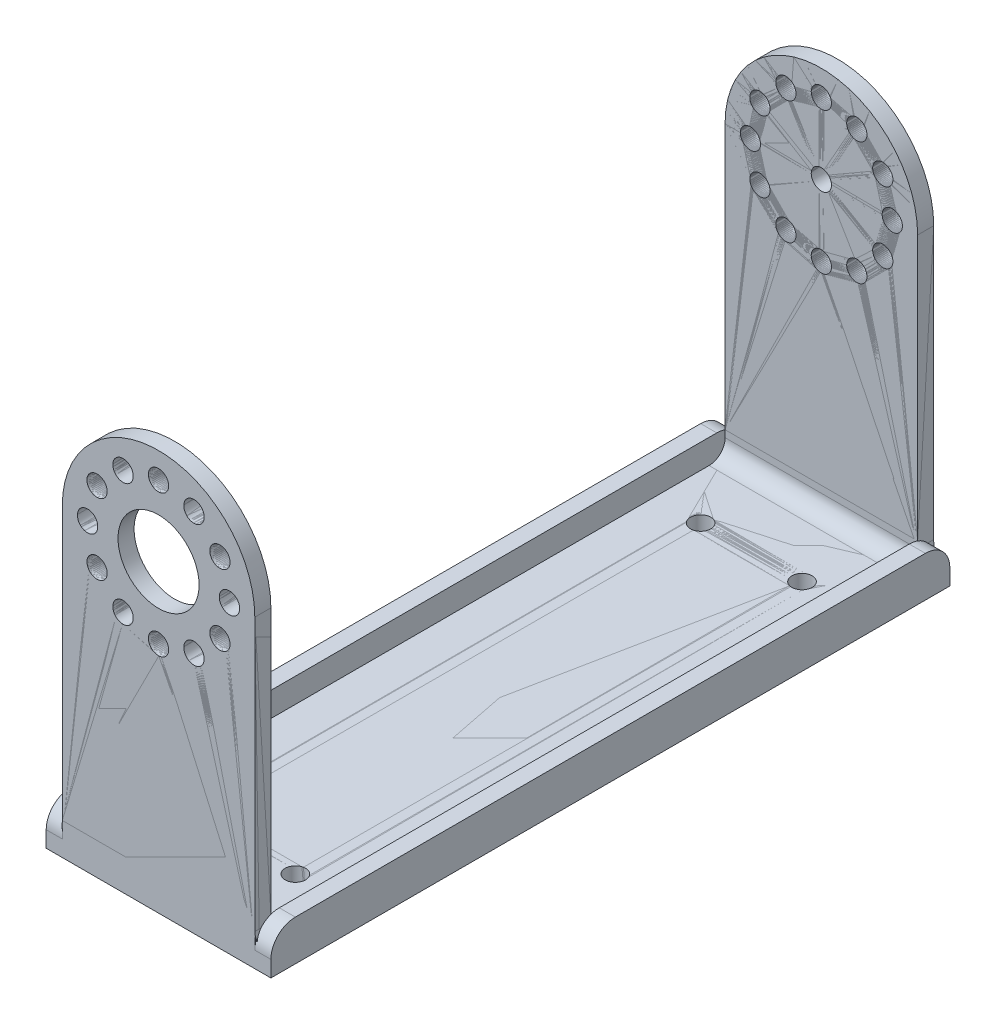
ISO-10303-21;
HEADER;
FILE_DESCRIPTION(('STEP AP214'),'2;1');
FILE_NAME('part.step','',(''),(''),'','','');
FILE_SCHEMA(('AUTOMOTIVE_DESIGN { 1 0 10303 214 1 1 1 1 }'));
ENDSEC;
DATA;
#1=APPLICATION_CONTEXT('core data for automotive mechanical design processes');
#2=APPLICATION_PROTOCOL_DEFINITION('international standard','automotive_design',2000,#1);
#3=PRODUCT_CONTEXT('',#1,'mechanical');
#4=PRODUCT('Part','Part','',(#3));
#5=PRODUCT_RELATED_PRODUCT_CATEGORY('part','',(#4));
#6=PRODUCT_DEFINITION_FORMATION('','',#4);
#7=PRODUCT_DEFINITION_CONTEXT('part definition',#1,'design');
#8=PRODUCT_DEFINITION('design','',#6,#7);
#9=PRODUCT_DEFINITION_SHAPE('','',#8);
#10=(LENGTH_UNIT() NAMED_UNIT(*) SI_UNIT(.MILLI.,.METRE.));
#11=(NAMED_UNIT(*) PLANE_ANGLE_UNIT() SI_UNIT($,.RADIAN.));
#12=(NAMED_UNIT(*) SI_UNIT($,.STERADIAN.) SOLID_ANGLE_UNIT());
#13=UNCERTAINTY_MEASURE_WITH_UNIT(LENGTH_MEASURE(1.E-05),#10,'distance_accuracy_value','');
#14=(GEOMETRIC_REPRESENTATION_CONTEXT(3) GLOBAL_UNCERTAINTY_ASSIGNED_CONTEXT((#13)) GLOBAL_UNIT_ASSIGNED_CONTEXT((#10,
#11,#12)) REPRESENTATION_CONTEXT('',''));
#15=CARTESIAN_POINT('',(0.,0.,0.));
#16=DIRECTION('',(0.,0.,1.));
#17=DIRECTION('',(1.,0.,0.));
#18=AXIS2_PLACEMENT_3D('',#15,#16,#17);
#19=CARTESIAN_POINT('',(-11.0875,0.,-33.5));
#20=DIRECTION('',(1.,0.,0.));
#21=DIRECTION('',(0.,0.,1.));
#22=AXIS2_PLACEMENT_3D('',#19,#20,#21);
#23=PLANE('',#22);
#24=CARTESIAN_POINT('',(-11.0875,1.5875,30.325));
#25=CARTESIAN_POINT('',(-11.0875,0.,30.325));
#26=B_SPLINE_CURVE_WITH_KNOTS('',1,(#24,#25),.UNSPECIFIED.,.F.,.F.,(2,2),(0.,1.),.UNSPECIFIED.);
#27=CARTESIAN_POINT('',(-11.0875,1.5875,30.325));
#28=VERTEX_POINT('',#27);
#29=CARTESIAN_POINT('',(-11.0875,0.,30.325));
#30=VERTEX_POINT('',#29);
#31=EDGE_CURVE('E12',#28,#30,#26,.T.);
#32=ORIENTED_EDGE('',*,*,#31,.F.);
#33=DIRECTION('',(0.,0.,-1.));
#34=VECTOR('',#33,1.);
#35=CARTESIAN_POINT('',(-11.0875,1.5875,0.));
#36=LINE('',#35,#34);
#37=CARTESIAN_POINT('',(-11.0875,1.5875,-30.325));
#38=VERTEX_POINT('',#37);
#39=EDGE_CURVE('E309',#38,#28,#36,.F.);
#40=ORIENTED_EDGE('',*,*,#39,.F.);
#41=CARTESIAN_POINT('',(-11.0875,0.,-30.325));
#42=CARTESIAN_POINT('',(-11.0875,1.5875,-30.325));
#43=B_SPLINE_CURVE_WITH_KNOTS('',1,(#41,#42),.UNSPECIFIED.,.F.,.F.,(2,2),(0.,1.),.UNSPECIFIED.);
#44=CARTESIAN_POINT('',(-11.0875,0.,-30.325));
#45=VERTEX_POINT('',#44);
#46=EDGE_CURVE('E59',#38,#45,#43,.F.);
#47=ORIENTED_EDGE('',*,*,#46,.T.);
#48=DIRECTION('',(0.,0.,1.));
#49=VECTOR('',#48,1.);
#50=CARTESIAN_POINT('',(-11.0875,0.,-33.5));
#51=LINE('',#50,#49);
#52=EDGE_CURVE('E565',#45,#30,#51,.T.);
#53=ORIENTED_EDGE('',*,*,#52,.T.);
#54=EDGE_LOOP('',(#32,#40,#47,#53));
#55=FACE_BOUND('',#54,.T.);
#56=ADVANCED_FACE('F50',(#55),#23,.F.);
#57=CARTESIAN_POINT('',(-9.50473763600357,3.175,-33.5));
#58=CARTESIAN_POINT('',(-9.50473763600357,2.77842026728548,-33.5));
#59=CARTESIAN_POINT('',(-9.60366028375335,2.36682174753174,-33.4237363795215));
#60=CARTESIAN_POINT('',(-9.90042822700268,1.59240341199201,-33.1090092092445));
#61=CARTESIAN_POINT('',(-10.0982735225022,1.23048322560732,-32.8706112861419));
#62=CARTESIAN_POINT('',(-10.4939641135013,0.629388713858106,-32.2695167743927));
#63=CARTESIAN_POINT('',(-10.6918094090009,0.39099079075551,-31.907596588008));
#64=CARTESIAN_POINT('',(-10.9885773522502,0.0762636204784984,-31.1331782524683));
#65=CARTESIAN_POINT('',(-11.0875,0.,-30.7215797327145));
#66=CARTESIAN_POINT('',(-11.0875,0.,-30.325));
#67=CARTESIAN_POINT('',(-9.50473763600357,3.175,-31.9125));
#68=CARTESIAN_POINT('',(-9.50473763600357,2.97671013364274,-31.9125));
#69=CARTESIAN_POINT('',(-9.60366028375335,2.77091087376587,-31.8743681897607));
#70=CARTESIAN_POINT('',(-9.90042822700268,2.383701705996,-31.7170046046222));
#71=CARTESIAN_POINT('',(-10.0982735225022,2.20274161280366,-31.5978056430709));
#72=CARTESIAN_POINT('',(-10.4939641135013,1.90219435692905,-31.2972583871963));
#73=CARTESIAN_POINT('',(-10.6918094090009,1.78299539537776,-31.116298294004));
#74=CARTESIAN_POINT('',(-10.9885773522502,1.62563181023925,-30.7290891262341));
#75=CARTESIAN_POINT('',(-11.0875,1.5875,-30.5232898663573));
#76=CARTESIAN_POINT('',(-11.0875,1.5875,-30.325));
#77=B_SPLINE_SURFACE_WITH_KNOTS('',1,3,((#57,#58,#59,#60,#61,#62,#63,#64,#65,#66),(#67,#68,#69,
#70,#71,#72,#73,#74,#75,#76)),.UNSPECIFIED.,.F.,.F.,.F.,(2,2),(4,2,2,2,4),(0.,1.),(0.,0.25,0.5,
0.75,1.),.UNSPECIFIED.);
#78=CARTESIAN_POINT('',(-11.0875,1.5875,-30.325));
#79=CARTESIAN_POINT('',(-11.0875,1.5875,-30.5232898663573));
#80=CARTESIAN_POINT('',(-10.9885773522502,1.62563181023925,-30.7290891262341));
#81=CARTESIAN_POINT('',(-10.6918094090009,1.78299539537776,-31.116298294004));
#82=CARTESIAN_POINT('',(-10.4939641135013,1.90219435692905,-31.2972583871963));
#83=CARTESIAN_POINT('',(-10.0982735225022,2.20274161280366,-31.5978056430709));
#84=CARTESIAN_POINT('',(-9.90042822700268,2.383701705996,-31.7170046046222));
#85=CARTESIAN_POINT('',(-9.60366028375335,2.77091087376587,-31.8743681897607));
#86=CARTESIAN_POINT('',(-9.50473763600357,2.97671013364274,-31.9125));
#87=CARTESIAN_POINT('',(-9.50473763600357,3.175,-31.9125));
#88=B_SPLINE_CURVE_WITH_KNOTS('',3,(#78,#79,#80,#81,#82,#83,#84,#85,#86,#87),.UNSPECIFIED.,.F.,
.F.,(4,2,2,2,4),(0.,0.25,0.5,0.75,1.),.UNSPECIFIED.);
#89=CARTESIAN_POINT('',(-9.50473763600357,3.175,-31.9125));
#90=VERTEX_POINT('',#89);
#91=EDGE_CURVE('E576',#38,#90,#88,.T.);
#92=CARTESIAN_POINT('',(-9.50473763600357,3.175,-31.9125));
#93=CARTESIAN_POINT('',(-9.50473763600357,3.175,-33.5));
#94=B_SPLINE_CURVE_WITH_KNOTS('',1,(#92,#93),.UNSPECIFIED.,.F.,.F.,(2,2),(0.,1.),.UNSPECIFIED.);
#95=CARTESIAN_POINT('',(-9.50473763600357,3.175,-33.5));
#96=VERTEX_POINT('',#95);
#97=EDGE_CURVE('E632',#90,#96,#94,.T.);
#98=CARTESIAN_POINT('',(-9.50473763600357,3.175,-33.5));
#99=CARTESIAN_POINT('',(-9.50473763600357,2.77842026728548,-33.5));
#100=CARTESIAN_POINT('',(-9.60366028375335,2.36682174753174,-33.4237363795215));
#101=CARTESIAN_POINT('',(-9.90042822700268,1.59240341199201,-33.1090092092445));
#102=CARTESIAN_POINT('',(-10.0982735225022,1.23048322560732,-32.8706112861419));
#103=CARTESIAN_POINT('',(-10.4939641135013,0.629388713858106,-32.2695167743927));
#104=CARTESIAN_POINT('',(-10.6918094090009,0.39099079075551,-31.907596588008));
#105=CARTESIAN_POINT('',(-10.9885773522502,0.0762636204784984,-31.1331782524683));
#106=CARTESIAN_POINT('',(-11.0875,0.,-30.7215797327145));
#107=CARTESIAN_POINT('',(-11.0875,0.,-30.325));
#108=B_SPLINE_CURVE_WITH_KNOTS('',3,(#98,#99,#100,#101,#102,#103,#104,#105,#106,#107),
.UNSPECIFIED.,.F.,.F.,(4,2,2,2,4),(0.,0.25,0.5,0.75,1.),.UNSPECIFIED.);
#109=EDGE_CURVE('E562',#45,#96,#108,.F.);
#110=ORIENTED_EDGE('',*,*,#46,.F.);
#111=ORIENTED_EDGE('',*,*,#91,.T.);
#112=ORIENTED_EDGE('',*,*,#97,.T.);
#113=ORIENTED_EDGE('',*,*,#109,.F.);
#114=EDGE_LOOP('',(#110,#111,#112,#113));
#115=FACE_BOUND('',#114,.T.);
#116=ADVANCED_FACE('F594',(#115),#77,.F.);
#117=CARTESIAN_POINT('',(-9.50473763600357,0.,-33.5));
#118=DIRECTION('',(1.,0.,0.));
#119=DIRECTION('',(0.,1.,0.));
#120=AXIS2_PLACEMENT_3D('',#117,#118,#119);
#121=PLANE('',#120);
#122=ORIENTED_EDGE('',*,*,#97,.F.);
#123=DIRECTION('',(0.,1.,0.));
#124=VECTOR('',#123,1.);
#125=CARTESIAN_POINT('',(-9.50473763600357,1.5875,-31.9125));
#126=LINE('',#125,#124);
#127=CARTESIAN_POINT('',(-9.50473763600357,30.,-31.9125));
#128=VERTEX_POINT('',#127);
#129=EDGE_CURVE('E265',#90,#128,#126,.T.);
#130=ORIENTED_EDGE('',*,*,#129,.T.);
#131=DIRECTION('',(0.,0.,-1.));
#132=VECTOR('',#131,1.);
#133=CARTESIAN_POINT('',(-9.50473763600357,30.,-33.5));
#134=LINE('',#133,#132);
#135=CARTESIAN_POINT('',(-9.50473763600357,30.,-33.5));
#136=VERTEX_POINT('',#135);
#137=EDGE_CURVE('E715',#128,#136,#134,.T.);
#138=ORIENTED_EDGE('',*,*,#137,.T.);
#139=DIRECTION('',(0.,1.,0.));
#140=VECTOR('',#139,1.);
#141=CARTESIAN_POINT('',(-9.50473763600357,0.,-33.5));
#142=LINE('',#141,#140);
#143=EDGE_CURVE('E548',#96,#136,#142,.T.);
#144=ORIENTED_EDGE('',*,*,#143,.F.);
#145=EDGE_LOOP('',(#122,#130,#138,#144));
#146=FACE_BOUND('',#145,.T.);
#147=ADVANCED_FACE('F606',(#146),#121,.F.);
#148=CARTESIAN_POINT('',(-0.00236881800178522,30.,-33.5));
#149=DIRECTION('',(0.,0.,-1.));
#150=DIRECTION('',(-1.,0.,0.));
#151=AXIS2_PLACEMENT_3D('',#148,#149,#150);
#152=CYLINDRICAL_SURFACE('',#151,9.50236881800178);
#153=ORIENTED_EDGE('',*,*,#137,.F.);
#154=CARTESIAN_POINT('',(-0.00236881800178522,30.,-31.9125));
#155=DIRECTION('',(0.,0.,-1.));
#156=DIRECTION('',(-1.,0.,0.));
#157=AXIS2_PLACEMENT_3D('',#154,#155,#156);
#158=CIRCLE('',#157,9.50236881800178);
#159=CARTESIAN_POINT('',(9.5,30.,-31.9125));
#160=VERTEX_POINT('',#159);
#161=EDGE_CURVE('E261',#128,#160,#158,.T.);
#162=ORIENTED_EDGE('',*,*,#161,.T.);
#163=DIRECTION('',(0.,0.,-1.));
#164=VECTOR('',#163,1.);
#165=CARTESIAN_POINT('',(9.5,30.,-33.5));
#166=LINE('',#165,#164);
#167=CARTESIAN_POINT('',(9.5,30.,-33.5));
#168=VERTEX_POINT('',#167);
#169=EDGE_CURVE('E709',#160,#168,#166,.T.);
#170=ORIENTED_EDGE('',*,*,#169,.T.);
#171=CARTESIAN_POINT('',(-0.00236881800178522,30.,-33.5));
#172=DIRECTION('',(0.,0.,-1.));
#173=DIRECTION('',(-1.,0.,0.));
#174=AXIS2_PLACEMENT_3D('',#171,#172,#173);
#175=CIRCLE('',#174,9.50236881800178);
#176=EDGE_CURVE('E774',#136,#168,#175,.T.);
#177=ORIENTED_EDGE('',*,*,#176,.F.);
#178=EDGE_LOOP('',(#153,#162,#170,#177));
#179=FACE_BOUND('',#178,.T.);
#180=ADVANCED_FACE('F821',(#179),#152,.T.);
#181=CARTESIAN_POINT('',(9.5,0.,-33.5));
#182=DIRECTION('',(1.,0.,0.));
#183=DIRECTION('',(0.,1.,0.));
#184=AXIS2_PLACEMENT_3D('',#181,#182,#183);
#185=PLANE('',#184);
#186=ORIENTED_EDGE('',*,*,#169,.F.);
#187=DIRECTION('',(0.,1.,0.));
#188=VECTOR('',#187,1.);
#189=CARTESIAN_POINT('',(9.5,1.5875,-31.9125));
#190=LINE('',#189,#188);
#191=CARTESIAN_POINT('',(9.5,3.175,-31.9125));
#192=VERTEX_POINT('',#191);
#193=EDGE_CURVE('E264',#192,#160,#190,.T.);
#194=ORIENTED_EDGE('',*,*,#193,.F.);
#195=CARTESIAN_POINT('',(9.5,3.175,-33.5));
#196=CARTESIAN_POINT('',(9.5,3.175,-31.9125));
#197=B_SPLINE_CURVE_WITH_KNOTS('',1,(#195,#196),.UNSPECIFIED.,.F.,.F.,(2,2),(0.,1.),.UNSPECIFIED.);
#198=CARTESIAN_POINT('',(9.5,3.175,-33.5));
#199=VERTEX_POINT('',#198);
#200=EDGE_CURVE('E708',#192,#199,#197,.F.);
#201=ORIENTED_EDGE('',*,*,#200,.T.);
#202=DIRECTION('',(0.,1.,0.));
#203=VECTOR('',#202,1.);
#204=CARTESIAN_POINT('',(9.5,0.,-33.5));
#205=LINE('',#204,#203);
#206=EDGE_CURVE('E770',#199,#168,#205,.T.);
#207=ORIENTED_EDGE('',*,*,#206,.T.);
#208=EDGE_LOOP('',(#186,#194,#201,#207));
#209=FACE_BOUND('',#208,.T.);
#210=ADVANCED_FACE('F515',(#209),#185,.T.);
#211=CARTESIAN_POINT('',(11.0875,0.,-30.325));
#212=CARTESIAN_POINT('',(11.0875,0.,-30.7217127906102));
#213=CARTESIAN_POINT('',(10.98828125,0.0763074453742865,-31.1333377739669));
#214=CARTESIAN_POINT('',(10.690625,0.39105830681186,-31.907711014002));
#215=CARTESIAN_POINT('',(10.4921875,0.629435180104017,-32.2695632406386));
#216=CARTESIAN_POINT('',(10.0953125,1.23043675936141,-32.870564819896));
#217=CARTESIAN_POINT('',(9.896875,1.59228898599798,-33.1089416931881));
#218=CARTESIAN_POINT('',(9.59921875,2.36666222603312,-33.4236925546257));
#219=CARTESIAN_POINT('',(9.5,2.77828720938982,-33.5));
#220=CARTESIAN_POINT('',(9.5,3.175,-33.5));
#221=CARTESIAN_POINT('',(11.0875,1.5875,-30.325));
#222=CARTESIAN_POINT('',(11.0875,1.5875,-30.5233563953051));
#223=CARTESIAN_POINT('',(10.98828125,1.62565372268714,-30.7291688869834));
#224=CARTESIAN_POINT('',(10.690625,1.78302915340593,-31.116355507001));
#225=CARTESIAN_POINT('',(10.4921875,1.90221759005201,-31.2972816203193));
#226=CARTESIAN_POINT('',(10.0953125,2.2027183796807,-31.597782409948));
#227=CARTESIAN_POINT('',(9.896875,2.38364449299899,-31.7169708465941));
#228=CARTESIAN_POINT('',(9.59921875,2.77083111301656,-31.8743462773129));
#229=CARTESIAN_POINT('',(9.5,2.97664360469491,-31.9125));
#230=CARTESIAN_POINT('',(9.5,3.175,-31.9125));
#231=B_SPLINE_SURFACE_WITH_KNOTS('',1,3,((#211,#212,#213,#214,#215,#216,#217,#218,#219,#220),
(#221,#222,#223,#224,#225,#226,#227,#228,#229,#230)),.UNSPECIFIED.,.F.,.F.,.F.,(2,2),(4,2,2,2,
4),(0.,1.),(0.,0.25,0.5,0.75,1.),.UNSPECIFIED.);
#232=CARTESIAN_POINT('',(9.5,3.175,-31.9125));
#233=CARTESIAN_POINT('',(9.5,2.97664360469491,-31.9125));
#234=CARTESIAN_POINT('',(9.59921875,2.77083111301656,-31.8743462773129));
#235=CARTESIAN_POINT('',(9.896875,2.38364449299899,-31.7169708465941));
#236=CARTESIAN_POINT('',(10.0953125,2.2027183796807,-31.597782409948));
#237=CARTESIAN_POINT('',(10.4921875,1.90221759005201,-31.2972816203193));
#238=CARTESIAN_POINT('',(10.690625,1.78302915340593,-31.116355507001));
#239=CARTESIAN_POINT('',(10.98828125,1.62565372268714,-30.7291688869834));
#240=CARTESIAN_POINT('',(11.0875,1.5875,-30.5233563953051));
#241=CARTESIAN_POINT('',(11.0875,1.5875,-30.325));
#242=B_SPLINE_CURVE_WITH_KNOTS('',3,(#232,#233,#234,#235,#236,#237,#238,#239,#240,#241),
.UNSPECIFIED.,.F.,.F.,(4,2,2,2,4),(0.,0.25,0.5,0.75,1.),.UNSPECIFIED.);
#243=CARTESIAN_POINT('',(11.0875,1.5875,-30.325));
#244=VERTEX_POINT('',#243);
#245=EDGE_CURVE('E745',#192,#244,#242,.T.);
#246=CARTESIAN_POINT('',(11.0875,1.5875,-30.325));
#247=CARTESIAN_POINT('',(11.0875,0.,-30.325));
#248=B_SPLINE_CURVE_WITH_KNOTS('',1,(#246,#247),.UNSPECIFIED.,.F.,.F.,(2,2),(0.,1.),.UNSPECIFIED.);
#249=CARTESIAN_POINT('',(11.0875,0.,-30.325));
#250=VERTEX_POINT('',#249);
#251=EDGE_CURVE('E498',#244,#250,#248,.T.);
#252=CARTESIAN_POINT('',(11.0875,0.,-30.325));
#253=CARTESIAN_POINT('',(11.0875,0.,-30.7217127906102));
#254=CARTESIAN_POINT('',(10.98828125,0.0763074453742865,-31.1333377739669));
#255=CARTESIAN_POINT('',(10.690625,0.39105830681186,-31.907711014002));
#256=CARTESIAN_POINT('',(10.4921875,0.629435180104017,-32.2695632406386));
#257=CARTESIAN_POINT('',(10.0953125,1.23043675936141,-32.870564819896));
#258=CARTESIAN_POINT('',(9.896875,1.59228898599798,-33.1089416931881));
#259=CARTESIAN_POINT('',(9.59921875,2.36666222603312,-33.4236925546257));
#260=CARTESIAN_POINT('',(9.5,2.77828720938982,-33.5));
#261=CARTESIAN_POINT('',(9.5,3.175,-33.5));
#262=B_SPLINE_CURVE_WITH_KNOTS('',3,(#252,#253,#254,#255,#256,#257,#258,#259,#260,#261),
.UNSPECIFIED.,.F.,.F.,(4,2,2,2,4),(0.,0.25,0.5,0.75,1.),.UNSPECIFIED.);
#263=EDGE_CURVE('E746',#199,#250,#262,.F.);
#264=ORIENTED_EDGE('',*,*,#200,.F.);
#265=ORIENTED_EDGE('',*,*,#245,.T.);
#266=ORIENTED_EDGE('',*,*,#251,.T.);
#267=ORIENTED_EDGE('',*,*,#263,.F.);
#268=EDGE_LOOP('',(#264,#265,#266,#267));
#269=FACE_BOUND('',#268,.T.);
#270=ADVANCED_FACE('F504',(#269),#231,.F.);
#271=CARTESIAN_POINT('',(11.0875,0.,33.5));
#272=DIRECTION('',(-1.,0.,0.));
#273=DIRECTION('',(0.,0.,-1.));
#274=AXIS2_PLACEMENT_3D('',#271,#272,#273);
#275=PLANE('',#274);
#276=ORIENTED_EDGE('',*,*,#251,.F.);
#277=DIRECTION('',(0.,0.,-1.));
#278=VECTOR('',#277,1.);
#279=CARTESIAN_POINT('',(11.0875,1.5875,0.));
#280=LINE('',#279,#278);
#281=CARTESIAN_POINT('',(11.0875,1.5875,30.325));
#282=VERTEX_POINT('',#281);
#283=EDGE_CURVE('E299',#282,#244,#280,.T.);
#284=ORIENTED_EDGE('',*,*,#283,.F.);
#285=CARTESIAN_POINT('',(11.0875,0.,30.325));
#286=CARTESIAN_POINT('',(11.0875,1.5875,30.325));
#287=B_SPLINE_CURVE_WITH_KNOTS('',1,(#285,#286),.UNSPECIFIED.,.F.,.F.,(2,2),(0.,1.),.UNSPECIFIED.);
#288=CARTESIAN_POINT('',(11.0875,0.,30.325));
#289=VERTEX_POINT('',#288);
#290=EDGE_CURVE('E475',#282,#289,#287,.F.);
#291=ORIENTED_EDGE('',*,*,#290,.T.);
#292=DIRECTION('',(0.,0.,-1.));
#293=VECTOR('',#292,1.);
#294=CARTESIAN_POINT('',(11.0875,0.,33.5));
#295=LINE('',#294,#293);
#296=EDGE_CURVE('E567',#289,#250,#295,.T.);
#297=ORIENTED_EDGE('',*,*,#296,.T.);
#298=EDGE_LOOP('',(#276,#284,#291,#297));
#299=FACE_BOUND('',#298,.T.);
#300=ADVANCED_FACE('F431',(#299),#275,.F.);
#301=CARTESIAN_POINT('',(9.5,3.175,33.5));
#302=CARTESIAN_POINT('',(9.5,2.77828720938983,33.5));
#303=CARTESIAN_POINT('',(9.59921875,2.36666222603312,33.4236925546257));
#304=CARTESIAN_POINT('',(9.896875,1.59228898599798,33.1089416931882));
#305=CARTESIAN_POINT('',(10.0953125,1.23043675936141,32.870564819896));
#306=CARTESIAN_POINT('',(10.4921875,0.629435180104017,32.2695632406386));
#307=CARTESIAN_POINT('',(10.690625,0.39105830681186,31.907711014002));
#308=CARTESIAN_POINT('',(10.98828125,0.0763074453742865,31.1333377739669));
#309=CARTESIAN_POINT('',(11.0875,0.,30.7217127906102));
#310=CARTESIAN_POINT('',(11.0875,0.,30.325));
#311=CARTESIAN_POINT('',(9.5,3.175,31.9125));
#312=CARTESIAN_POINT('',(9.5,2.97664360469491,31.9125));
#313=CARTESIAN_POINT('',(9.59921875,2.77083111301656,31.8743462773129));
#314=CARTESIAN_POINT('',(9.896875,2.38364449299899,31.7169708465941));
#315=CARTESIAN_POINT('',(10.0953125,2.2027183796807,31.597782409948));
#316=CARTESIAN_POINT('',(10.4921875,1.90221759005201,31.2972816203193));
#317=CARTESIAN_POINT('',(10.690625,1.78302915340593,31.116355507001));
#318=CARTESIAN_POINT('',(10.98828125,1.62565372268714,30.7291688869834));
#319=CARTESIAN_POINT('',(11.0875,1.5875,30.5233563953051));
#320=CARTESIAN_POINT('',(11.0875,1.5875,30.325));
#321=B_SPLINE_SURFACE_WITH_KNOTS('',1,3,((#301,#302,#303,#304,#305,#306,#307,#308,#309,#310),
(#311,#312,#313,#314,#315,#316,#317,#318,#319,#320)),.UNSPECIFIED.,.F.,.F.,.F.,(2,2),(4,2,2,2,
4),(0.,1.),(0.,0.25,0.5,0.75,1.),.UNSPECIFIED.);
#322=CARTESIAN_POINT('',(11.0875,1.5875,30.325));
#323=CARTESIAN_POINT('',(11.0875,1.5875,30.5233563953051));
#324=CARTESIAN_POINT('',(10.98828125,1.62565372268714,30.7291688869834));
#325=CARTESIAN_POINT('',(10.690625,1.78302915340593,31.116355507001));
#326=CARTESIAN_POINT('',(10.4921875,1.90221759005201,31.2972816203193));
#327=CARTESIAN_POINT('',(10.0953125,2.2027183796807,31.597782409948));
#328=CARTESIAN_POINT('',(9.896875,2.38364449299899,31.7169708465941));
#329=CARTESIAN_POINT('',(9.59921875,2.77083111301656,31.8743462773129));
#330=CARTESIAN_POINT('',(9.5,2.97664360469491,31.9125));
#331=CARTESIAN_POINT('',(9.5,3.175,31.9125));
#332=B_SPLINE_CURVE_WITH_KNOTS('',3,(#322,#323,#324,#325,#326,#327,#328,#329,#330,#331),
.UNSPECIFIED.,.F.,.F.,(4,2,2,2,4),(0.,0.25,0.5,0.75,1.),.UNSPECIFIED.);
#333=CARTESIAN_POINT('',(9.5,3.175,31.9125));
#334=VERTEX_POINT('',#333);
#335=EDGE_CURVE('E755',#282,#334,#332,.T.);
#336=CARTESIAN_POINT('',(9.5,3.175,31.9125));
#337=CARTESIAN_POINT('',(9.5,3.175,33.5));
#338=B_SPLINE_CURVE_WITH_KNOTS('',1,(#336,#337),.UNSPECIFIED.,.F.,.F.,(2,2),(0.,1.),.UNSPECIFIED.);
#339=CARTESIAN_POINT('',(9.5,3.175,33.5));
#340=VERTEX_POINT('',#339);
#341=EDGE_CURVE('E462',#334,#340,#338,.T.);
#342=CARTESIAN_POINT('',(9.5,3.175,33.5));
#343=CARTESIAN_POINT('',(9.5,2.77828720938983,33.5));
#344=CARTESIAN_POINT('',(9.59921875,2.36666222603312,33.4236925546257));
#345=CARTESIAN_POINT('',(9.896875,1.59228898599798,33.1089416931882));
#346=CARTESIAN_POINT('',(10.0953125,1.23043675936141,32.870564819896));
#347=CARTESIAN_POINT('',(10.4921875,0.629435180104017,32.2695632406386));
#348=CARTESIAN_POINT('',(10.690625,0.39105830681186,31.907711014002));
#349=CARTESIAN_POINT('',(10.98828125,0.0763074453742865,31.1333377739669));
#350=CARTESIAN_POINT('',(11.0875,0.,30.7217127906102));
#351=CARTESIAN_POINT('',(11.0875,0.,30.325));
#352=B_SPLINE_CURVE_WITH_KNOTS('',3,(#342,#343,#344,#345,#346,#347,#348,#349,#350,#351),
.UNSPECIFIED.,.F.,.F.,(4,2,2,2,4),(0.,0.25,0.5,0.75,1.),.UNSPECIFIED.);
#353=EDGE_CURVE('E411',#289,#340,#352,.F.);
#354=ORIENTED_EDGE('',*,*,#290,.F.);
#355=ORIENTED_EDGE('',*,*,#335,.T.);
#356=ORIENTED_EDGE('',*,*,#341,.T.);
#357=ORIENTED_EDGE('',*,*,#353,.F.);
#358=EDGE_LOOP('',(#354,#355,#356,#357));
#359=FACE_BOUND('',#358,.T.);
#360=ADVANCED_FACE('F418',(#359),#321,.F.);
#361=CARTESIAN_POINT('',(9.5,0.,33.5));
#362=DIRECTION('',(-1.,0.,0.));
#363=DIRECTION('',(0.,1.,0.));
#364=AXIS2_PLACEMENT_3D('',#361,#362,#363);
#365=PLANE('',#364);
#366=ORIENTED_EDGE('',*,*,#341,.F.);
#367=DIRECTION('',(0.,1.,0.));
#368=VECTOR('',#367,1.);
#369=CARTESIAN_POINT('',(9.5,1.5875,31.9125));
#370=LINE('',#369,#368);
#371=CARTESIAN_POINT('',(9.5,30.0430013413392,31.9125));
#372=VERTEX_POINT('',#371);
#373=EDGE_CURVE('E260',#334,#372,#370,.T.);
#374=ORIENTED_EDGE('',*,*,#373,.T.);
#375=DIRECTION('',(0.,0.,1.));
#376=VECTOR('',#375,1.);
#377=CARTESIAN_POINT('',(9.5,30.0430013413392,33.5));
#378=LINE('',#377,#376);
#379=CARTESIAN_POINT('',(9.5,30.0430013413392,33.5));
#380=VERTEX_POINT('',#379);
#381=EDGE_CURVE('E705',#372,#380,#378,.T.);
#382=ORIENTED_EDGE('',*,*,#381,.T.);
#383=DIRECTION('',(0.,1.,0.));
#384=VECTOR('',#383,1.);
#385=CARTESIAN_POINT('',(9.5,0.,33.5));
#386=LINE('',#385,#384);
#387=EDGE_CURVE('E316',#340,#380,#386,.T.);
#388=ORIENTED_EDGE('',*,*,#387,.F.);
#389=EDGE_LOOP('',(#366,#374,#382,#388));
#390=FACE_BOUND('',#389,.T.);
#391=ADVANCED_FACE('F430',(#390),#365,.F.);
#392=CARTESIAN_POINT('',(0.,30.0430013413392,33.5));
#393=DIRECTION('',(0.,0.,1.));
#394=DIRECTION('',(1.,0.,0.));
#395=AXIS2_PLACEMENT_3D('',#392,#393,#394);
#396=CYLINDRICAL_SURFACE('',#395,9.5);
#397=ORIENTED_EDGE('',*,*,#381,.F.);
#398=CARTESIAN_POINT('',(0.,30.0430013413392,31.9125));
#399=DIRECTION('',(0.,0.,1.));
#400=DIRECTION('',(1.,0.,0.));
#401=AXIS2_PLACEMENT_3D('',#398,#399,#400);
#402=CIRCLE('',#401,9.5);
#403=CARTESIAN_POINT('',(-9.5,30.0430013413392,31.9125));
#404=VERTEX_POINT('',#403);
#405=EDGE_CURVE('E256',#404,#372,#402,.F.);
#406=ORIENTED_EDGE('',*,*,#405,.F.);
#407=DIRECTION('',(0.,0.,1.));
#408=VECTOR('',#407,1.);
#409=CARTESIAN_POINT('',(-9.5,30.0430013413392,33.5));
#410=LINE('',#409,#408);
#411=CARTESIAN_POINT('',(-9.5,30.0430013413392,33.5));
#412=VERTEX_POINT('',#411);
#413=EDGE_CURVE('E699',#404,#412,#410,.T.);
#414=ORIENTED_EDGE('',*,*,#413,.T.);
#415=CARTESIAN_POINT('',(0.,30.0430013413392,33.5));
#416=DIRECTION('',(0.,0.,1.));
#417=DIRECTION('',(1.,0.,0.));
#418=AXIS2_PLACEMENT_3D('',#415,#416,#417);
#419=CIRCLE('',#418,9.5);
#420=EDGE_CURVE('E359',#412,#380,#419,.F.);
#421=ORIENTED_EDGE('',*,*,#420,.T.);
#422=EDGE_LOOP('',(#397,#406,#414,#421));
#423=FACE_BOUND('',#422,.T.);
#424=ADVANCED_FACE('F1060',(#423),#396,.T.);
#425=CARTESIAN_POINT('',(-9.5,0.,33.5));
#426=DIRECTION('',(-1.,0.,0.));
#427=DIRECTION('',(0.,1.,0.));
#428=AXIS2_PLACEMENT_3D('',#425,#426,#427);
#429=PLANE('',#428);
#430=ORIENTED_EDGE('',*,*,#413,.F.);
#431=DIRECTION('',(0.,1.,0.));
#432=VECTOR('',#431,1.);
#433=CARTESIAN_POINT('',(-9.5,1.5875,31.9125));
#434=LINE('',#433,#432);
#435=CARTESIAN_POINT('',(-9.5,3.175,31.9125));
#436=VERTEX_POINT('',#435);
#437=EDGE_CURVE('E259',#436,#404,#434,.T.);
#438=ORIENTED_EDGE('',*,*,#437,.F.);
#439=CARTESIAN_POINT('',(-9.5,3.175,33.5));
#440=CARTESIAN_POINT('',(-9.5,3.175,31.9125));
#441=B_SPLINE_CURVE_WITH_KNOTS('',1,(#439,#440),.UNSPECIFIED.,.F.,.F.,(2,2),(0.,1.),.UNSPECIFIED.);
#442=CARTESIAN_POINT('',(-9.5,3.175,33.5));
#443=VERTEX_POINT('',#442);
#444=EDGE_CURVE('E706',#436,#443,#441,.F.);
#445=ORIENTED_EDGE('',*,*,#444,.T.);
#446=DIRECTION('',(0.,1.,0.));
#447=VECTOR('',#446,1.);
#448=CARTESIAN_POINT('',(-9.5,0.,33.5));
#449=LINE('',#448,#447);
#450=EDGE_CURVE('E240',#443,#412,#449,.T.);
#451=ORIENTED_EDGE('',*,*,#450,.T.);
#452=EDGE_LOOP('',(#430,#438,#445,#451));
#453=FACE_BOUND('',#452,.T.);
#454=ADVANCED_FACE('F812',(#453),#429,.T.);
#455=CARTESIAN_POINT('',(-0.00236881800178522,30.,-33.5));
#456=DIRECTION('',(0.,0.,-1.));
#457=DIRECTION('',(-1.,0.,0.));
#458=AXIS2_PLACEMENT_3D('',#455,#456,#457);
#459=CYLINDRICAL_SURFACE('',#458,1.);
#460=CARTESIAN_POINT('',(-0.00236881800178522,30.,-33.5));
#461=DIRECTION('',(0.,0.,-1.));
#462=DIRECTION('',(-1.,0.,0.));
#463=AXIS2_PLACEMENT_3D('',#460,#461,#462);
#464=CIRCLE('',#463,1.);
#465=CARTESIAN_POINT('',(-1.00236881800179,30.,-33.5));
#466=VERTEX_POINT('',#465);
#467=EDGE_CURVE('E773',#466,#466,#464,.T.);
#468=ORIENTED_EDGE('',*,*,#467,.T.);
#469=EDGE_LOOP('',(#468));
#470=FACE_BOUND('',#469,.T.);
#471=CARTESIAN_POINT('',(-0.00236881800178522,30.,-31.9125));
#472=DIRECTION('',(0.,0.,-1.));
#473=DIRECTION('',(-1.,0.,0.));
#474=AXIS2_PLACEMENT_3D('',#471,#472,#473);
#475=CIRCLE('',#474,1.);
#476=CARTESIAN_POINT('',(-1.00236881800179,30.,-31.9125));
#477=VERTEX_POINT('',#476);
#478=EDGE_CURVE('E290',#477,#477,#475,.T.);
#479=ORIENTED_EDGE('',*,*,#478,.F.);
#480=EDGE_LOOP('',(#479));
#481=FACE_BOUND('',#480,.T.);
#482=ADVANCED_FACE('F52',(#470,#481),#459,.F.);
#483=CARTESIAN_POINT('',(5.,0.,25.));
#484=DIRECTION('',(0.,1.,0.));
#485=DIRECTION('',(0.,0.,1.));
#486=AXIS2_PLACEMENT_3D('',#483,#484,#485);
#487=CYLINDRICAL_SURFACE('',#486,1.);
#488=CARTESIAN_POINT('',(5.,0.,25.));
#489=DIRECTION('',(0.,1.,0.));
#490=DIRECTION('',(0.,0.,1.));
#491=AXIS2_PLACEMENT_3D('',#488,#489,#490);
#492=CIRCLE('',#491,1.);
#493=CARTESIAN_POINT('',(5.,0.,26.));
#494=VERTEX_POINT('',#493);
#495=EDGE_CURVE('E777',#494,#494,#492,.T.);
#496=ORIENTED_EDGE('',*,*,#495,.F.);
#497=EDGE_LOOP('',(#496));
#498=FACE_BOUND('',#497,.T.);
#499=CARTESIAN_POINT('',(5.,1.5875,25.));
#500=DIRECTION('',(0.,1.,0.));
#501=DIRECTION('',(0.,0.,1.));
#502=AXIS2_PLACEMENT_3D('',#499,#500,#501);
#503=CIRCLE('',#502,1.);
#504=CARTESIAN_POINT('',(5.,1.5875,26.));
#505=VERTEX_POINT('',#504);
#506=EDGE_CURVE('E286',#505,#505,#503,.T.);
#507=ORIENTED_EDGE('',*,*,#506,.T.);
#508=EDGE_LOOP('',(#507));
#509=FACE_BOUND('',#508,.T.);
#510=ADVANCED_FACE('F1081',(#498,#509),#487,.F.);
#511=CARTESIAN_POINT('',(-5.,0.,25.));
#512=DIRECTION('',(0.,1.,0.));
#513=DIRECTION('',(0.,0.,1.));
#514=AXIS2_PLACEMENT_3D('',#511,#512,#513);
#515=CYLINDRICAL_SURFACE('',#514,1.);
#516=CARTESIAN_POINT('',(-5.,0.,25.));
#517=DIRECTION('',(0.,1.,0.));
#518=DIRECTION('',(0.,0.,1.));
#519=AXIS2_PLACEMENT_3D('',#516,#517,#518);
#520=CIRCLE('',#519,1.);
#521=CARTESIAN_POINT('',(-5.,0.,26.));
#522=VERTEX_POINT('',#521);
#523=EDGE_CURVE('E1052',#522,#522,#520,.T.);
#524=ORIENTED_EDGE('',*,*,#523,.F.);
#525=EDGE_LOOP('',(#524));
#526=FACE_BOUND('',#525,.T.);
#527=CARTESIAN_POINT('',(-5.,1.5875,25.));
#528=DIRECTION('',(0.,1.,0.));
#529=DIRECTION('',(0.,0.,1.));
#530=AXIS2_PLACEMENT_3D('',#527,#528,#529);
#531=CIRCLE('',#530,1.);
#532=CARTESIAN_POINT('',(-5.,1.5875,26.));
#533=VERTEX_POINT('',#532);
#534=EDGE_CURVE('E289',#533,#533,#531,.T.);
#535=ORIENTED_EDGE('',*,*,#534,.T.);
#536=EDGE_LOOP('',(#535));
#537=FACE_BOUND('',#536,.T.);
#538=ADVANCED_FACE('F1084',(#526,#537),#515,.F.);
#539=CARTESIAN_POINT('',(5.,0.,-25.));
#540=DIRECTION('',(0.,1.,0.));
#541=DIRECTION('',(0.,0.,1.));
#542=AXIS2_PLACEMENT_3D('',#539,#540,#541);
#543=CYLINDRICAL_SURFACE('',#542,1.);
#544=CARTESIAN_POINT('',(5.,0.,-25.));
#545=DIRECTION('',(0.,1.,0.));
#546=DIRECTION('',(0.,0.,1.));
#547=AXIS2_PLACEMENT_3D('',#544,#545,#546);
#548=CIRCLE('',#547,1.);
#549=CARTESIAN_POINT('',(5.,0.,-24.));
#550=VERTEX_POINT('',#549);
#551=EDGE_CURVE('E1055',#550,#550,#548,.T.);
#552=ORIENTED_EDGE('',*,*,#551,.F.);
#553=EDGE_LOOP('',(#552));
#554=FACE_BOUND('',#553,.T.);
#555=CARTESIAN_POINT('',(5.,1.5875,-25.));
#556=DIRECTION('',(0.,1.,0.));
#557=DIRECTION('',(0.,0.,1.));
#558=AXIS2_PLACEMENT_3D('',#555,#556,#557);
#559=CIRCLE('',#558,1.);
#560=CARTESIAN_POINT('',(5.,1.5875,-24.));
#561=VERTEX_POINT('',#560);
#562=EDGE_CURVE('E293',#561,#561,#559,.T.);
#563=ORIENTED_EDGE('',*,*,#562,.T.);
#564=EDGE_LOOP('',(#563));
#565=FACE_BOUND('',#564,.T.);
#566=ADVANCED_FACE('F1088',(#554,#565),#543,.F.);
#567=CARTESIAN_POINT('',(-5.,0.,-25.));
#568=DIRECTION('',(0.,1.,0.));
#569=DIRECTION('',(0.,0.,1.));
#570=AXIS2_PLACEMENT_3D('',#567,#568,#569);
#571=CYLINDRICAL_SURFACE('',#570,1.);
#572=CARTESIAN_POINT('',(-5.,0.,-25.));
#573=DIRECTION('',(0.,1.,0.));
#574=DIRECTION('',(0.,0.,1.));
#575=AXIS2_PLACEMENT_3D('',#572,#573,#574);
#576=CIRCLE('',#575,1.);
#577=CARTESIAN_POINT('',(-5.,0.,-24.));
#578=VERTEX_POINT('',#577);
#579=EDGE_CURVE('E802',#578,#578,#576,.T.);
#580=ORIENTED_EDGE('',*,*,#579,.F.);
#581=EDGE_LOOP('',(#580));
#582=FACE_BOUND('',#581,.T.);
#583=CARTESIAN_POINT('',(-5.,1.5875,-25.));
#584=DIRECTION('',(0.,1.,0.));
#585=DIRECTION('',(0.,0.,1.));
#586=AXIS2_PLACEMENT_3D('',#583,#584,#585);
#587=CIRCLE('',#586,1.);
#588=CARTESIAN_POINT('',(-5.,1.5875,-24.));
#589=VERTEX_POINT('',#588);
#590=EDGE_CURVE('E296',#589,#589,#587,.T.);
#591=ORIENTED_EDGE('',*,*,#590,.T.);
#592=EDGE_LOOP('',(#591));
#593=FACE_BOUND('',#592,.T.);
#594=ADVANCED_FACE('F679',(#582,#593),#571,.F.);
#595=CARTESIAN_POINT('',(-11.0875,0.,30.325));
#596=CARTESIAN_POINT('',(-11.0875,0.,30.7217127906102));
#597=CARTESIAN_POINT('',(-10.98828125,0.0763074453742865,31.1333377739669));
#598=CARTESIAN_POINT('',(-10.690625,0.39105830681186,31.907711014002));
#599=CARTESIAN_POINT('',(-10.4921875,0.629435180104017,32.2695632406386));
#600=CARTESIAN_POINT('',(-10.0953125,1.23043675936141,32.870564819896));
#601=CARTESIAN_POINT('',(-9.896875,1.59228898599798,33.1089416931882));
#602=CARTESIAN_POINT('',(-9.59921875,2.36666222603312,33.4236925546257));
#603=CARTESIAN_POINT('',(-9.5,2.77828720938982,33.5));
#604=CARTESIAN_POINT('',(-9.5,3.175,33.5));
#605=CARTESIAN_POINT('',(-11.0875,1.5875,30.325));
#606=CARTESIAN_POINT('',(-11.0875,1.5875,30.5233563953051));
#607=CARTESIAN_POINT('',(-10.98828125,1.62565372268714,30.7291688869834));
#608=CARTESIAN_POINT('',(-10.690625,1.78302915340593,31.116355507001));
#609=CARTESIAN_POINT('',(-10.4921875,1.90221759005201,31.2972816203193));
#610=CARTESIAN_POINT('',(-10.0953125,2.2027183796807,31.597782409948));
#611=CARTESIAN_POINT('',(-9.896875,2.38364449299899,31.7169708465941));
#612=CARTESIAN_POINT('',(-9.59921875,2.77083111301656,31.8743462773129));
#613=CARTESIAN_POINT('',(-9.5,2.97664360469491,31.9125));
#614=CARTESIAN_POINT('',(-9.5,3.175,31.9125));
#615=B_SPLINE_SURFACE_WITH_KNOTS('',1,3,((#595,#596,#597,#598,#599,#600,#601,#602,#603,#604),
(#605,#606,#607,#608,#609,#610,#611,#612,#613,#614)),.UNSPECIFIED.,.F.,.F.,.F.,(2,2),(4,2,2,2,
4),(0.,1.),(0.,0.25,0.5,0.75,1.),.UNSPECIFIED.);
#616=CARTESIAN_POINT('',(-9.5,3.175,31.9125));
#617=CARTESIAN_POINT('',(-9.5,2.97664360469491,31.9125));
#618=CARTESIAN_POINT('',(-9.59921875,2.77083111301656,31.8743462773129));
#619=CARTESIAN_POINT('',(-9.896875,2.38364449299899,31.7169708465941));
#620=CARTESIAN_POINT('',(-10.0953125,2.2027183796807,31.597782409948));
#621=CARTESIAN_POINT('',(-10.4921875,1.90221759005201,31.2972816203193));
#622=CARTESIAN_POINT('',(-10.690625,1.78302915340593,31.116355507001));
#623=CARTESIAN_POINT('',(-10.98828125,1.62565372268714,30.7291688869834));
#624=CARTESIAN_POINT('',(-11.0875,1.5875,30.5233563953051));
#625=CARTESIAN_POINT('',(-11.0875,1.5875,30.325));
#626=B_SPLINE_CURVE_WITH_KNOTS('',3,(#616,#617,#618,#619,#620,#621,#622,#623,#624,#625),
.UNSPECIFIED.,.F.,.F.,(4,2,2,2,4),(0.,0.25,0.5,0.75,1.),.UNSPECIFIED.);
#627=EDGE_CURVE('E367',#436,#28,#626,.T.);
#628=CARTESIAN_POINT('',(-11.0875,0.,30.325));
#629=CARTESIAN_POINT('',(-11.0875,0.,30.7217127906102));
#630=CARTESIAN_POINT('',(-10.98828125,0.0763074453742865,31.1333377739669));
#631=CARTESIAN_POINT('',(-10.690625,0.39105830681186,31.907711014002));
#632=CARTESIAN_POINT('',(-10.4921875,0.629435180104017,32.2695632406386));
#633=CARTESIAN_POINT('',(-10.0953125,1.23043675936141,32.870564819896));
#634=CARTESIAN_POINT('',(-9.896875,1.59228898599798,33.1089416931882));
#635=CARTESIAN_POINT('',(-9.59921875,2.36666222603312,33.4236925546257));
#636=CARTESIAN_POINT('',(-9.5,2.77828720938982,33.5));
#637=CARTESIAN_POINT('',(-9.5,3.175,33.5));
#638=B_SPLINE_CURVE_WITH_KNOTS('',3,(#628,#629,#630,#631,#632,#633,#634,#635,#636,#637),
.UNSPECIFIED.,.F.,.F.,(4,2,2,2,4),(0.,0.25,0.5,0.75,1.),.UNSPECIFIED.);
#639=EDGE_CURVE('E355',#443,#30,#638,.F.);
#640=ORIENTED_EDGE('',*,*,#627,.T.);
#641=ORIENTED_EDGE('',*,*,#31,.T.);
#642=ORIENTED_EDGE('',*,*,#639,.F.);
#643=ORIENTED_EDGE('',*,*,#444,.F.);
#644=EDGE_LOOP('',(#640,#641,#642,#643));
#645=FACE_BOUND('',#644,.T.);
#646=ADVANCED_FACE('F667',(#645),#615,.F.);
#647=CARTESIAN_POINT('',(3.49999999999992,23.9808235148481,33.5));
#648=DIRECTION('',(0.,0.,1.));
#649=DIRECTION('',(1.,0.,0.));
#650=AXIS2_PLACEMENT_3D('',#647,#648,#649);
#651=CYLINDRICAL_SURFACE('',#650,1.);
#652=DIRECTION('',(0.,0.,-1.));
#653=VECTOR('',#652,1.);
#654=CARTESIAN_POINT('',(4.49707022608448,23.9043319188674,0.));
#655=LINE('',#654,#653);
#656=CARTESIAN_POINT('',(4.49707022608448,23.9043319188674,33.5));
#657=VERTEX_POINT('',#656);
#658=CARTESIAN_POINT('',(4.49707022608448,23.9043319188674,31.9125));
#659=VERTEX_POINT('',#658);
#660=EDGE_CURVE('E1006',#657,#659,#655,.T.);
#661=ORIENTED_EDGE('',*,*,#660,.F.);
#662=CARTESIAN_POINT('',(3.49999999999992,23.9808235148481,33.5));
#663=DIRECTION('',(0.,0.,1.));
#664=DIRECTION('',(1.,0.,0.));
#665=AXIS2_PLACEMENT_3D('',#662,#663,#664);
#666=CIRCLE('',#665,1.);
#667=CARTESIAN_POINT('',(2.50056095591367,24.0143137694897,33.5));
#668=VERTEX_POINT('',#667);
#669=EDGE_CURVE('E234',#657,#668,#666,.T.);
#670=ORIENTED_EDGE('',*,*,#669,.T.);
#671=DIRECTION('',(0.,0.,-1.));
#672=VECTOR('',#671,1.);
#673=CARTESIAN_POINT('',(2.50056095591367,24.0143137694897,0.));
#674=LINE('',#673,#672);
#675=CARTESIAN_POINT('',(2.50056095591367,24.0143137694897,31.9125));
#676=VERTEX_POINT('',#675);
#677=EDGE_CURVE('E1004',#676,#668,#674,.F.);
#678=ORIENTED_EDGE('',*,*,#677,.F.);
#679=CARTESIAN_POINT('',(3.49999999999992,23.9808235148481,31.9125));
#680=DIRECTION('',(0.,0.,1.));
#681=DIRECTION('',(1.,0.,0.));
#682=AXIS2_PLACEMENT_3D('',#679,#680,#681);
#683=CIRCLE('',#682,1.);
#684=EDGE_CURVE('E266',#659,#676,#683,.T.);
#685=ORIENTED_EDGE('',*,*,#684,.F.);
#686=EDGE_LOOP('',(#661,#670,#678,#685));
#687=FACE_BOUND('',#686,.T.);
#688=ADVANCED_FACE('F678',(#687),#651,.F.);
#689=CARTESIAN_POINT('',(7.,30.0430013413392,33.5));
#690=DIRECTION('',(0.,0.,1.));
#691=DIRECTION('',(1.,0.,0.));
#692=AXIS2_PLACEMENT_3D('',#689,#690,#691);
#693=CYLINDRICAL_SURFACE('',#692,1.);
#694=DIRECTION('',(0.,0.,-1.));
#695=VECTOR('',#694,1.);
#696=CARTESIAN_POINT('',(7.99707022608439,29.9665097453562,0.));
#697=LINE('',#696,#695);
#698=CARTESIAN_POINT('',(7.99707022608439,29.9665097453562,33.5));
#699=VERTEX_POINT('',#698);
#700=CARTESIAN_POINT('',(7.99707022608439,29.9665097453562,31.9125));
#701=VERTEX_POINT('',#700);
#702=EDGE_CURVE('E213',#699,#701,#697,.T.);
#703=ORIENTED_EDGE('',*,*,#702,.F.);
#704=CARTESIAN_POINT('',(7.,30.0430013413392,33.5));
#705=DIRECTION('',(0.,0.,1.));
#706=DIRECTION('',(1.,0.,0.));
#707=AXIS2_PLACEMENT_3D('',#704,#705,#706);
#708=CIRCLE('',#707,1.);
#709=CARTESIAN_POINT('',(6.00056095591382,30.076491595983,33.5));
#710=VERTEX_POINT('',#709);
#711=EDGE_CURVE('E226',#699,#710,#708,.T.);
#712=ORIENTED_EDGE('',*,*,#711,.T.);
#713=DIRECTION('',(0.,0.,-1.));
#714=VECTOR('',#713,1.);
#715=CARTESIAN_POINT('',(6.00056095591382,30.076491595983,0.));
#716=LINE('',#715,#714);
#717=CARTESIAN_POINT('',(6.00056095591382,30.076491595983,31.9125));
#718=VERTEX_POINT('',#717);
#719=EDGE_CURVE('E216',#718,#710,#716,.F.);
#720=ORIENTED_EDGE('',*,*,#719,.F.);
#721=CARTESIAN_POINT('',(7.,30.0430013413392,31.9125));
#722=DIRECTION('',(0.,0.,1.));
#723=DIRECTION('',(1.,0.,0.));
#724=AXIS2_PLACEMENT_3D('',#721,#722,#723);
#725=CIRCLE('',#724,1.);
#726=EDGE_CURVE('E228',#701,#718,#725,.T.);
#727=ORIENTED_EDGE('',*,*,#726,.F.);
#728=EDGE_LOOP('',(#703,#712,#720,#727));
#729=FACE_BOUND('',#728,.T.);
#730=ADVANCED_FACE('F225',(#729),#693,.F.);
#731=CARTESIAN_POINT('',(3.50000000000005,36.1051791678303,33.5));
#732=DIRECTION('',(0.,0.,1.));
#733=DIRECTION('',(1.,0.,0.));
#734=AXIS2_PLACEMENT_3D('',#731,#732,#733);
#735=CYLINDRICAL_SURFACE('',#734,1.);
#736=DIRECTION('',(0.,0.,-1.));
#737=VECTOR('',#736,1.);
#738=CARTESIAN_POINT('',(4.49707022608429,36.0286875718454,0.));
#739=LINE('',#738,#737);
#740=CARTESIAN_POINT('',(4.49707022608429,36.0286875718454,33.5));
#741=VERTEX_POINT('',#740);
#742=CARTESIAN_POINT('',(4.49707022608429,36.0286875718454,31.9125));
#743=VERTEX_POINT('',#742);
#744=EDGE_CURVE('E1048',#741,#743,#739,.T.);
#745=ORIENTED_EDGE('',*,*,#744,.F.);
#746=CARTESIAN_POINT('',(3.50000000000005,36.1051791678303,33.5));
#747=DIRECTION('',(0.,0.,1.));
#748=DIRECTION('',(1.,0.,0.));
#749=AXIS2_PLACEMENT_3D('',#746,#747,#748);
#750=CIRCLE('',#749,1.);
#751=CARTESIAN_POINT('',(2.50056095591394,36.1386694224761,33.5));
#752=VERTEX_POINT('',#751);
#753=EDGE_CURVE('E233',#741,#752,#750,.T.);
#754=ORIENTED_EDGE('',*,*,#753,.T.);
#755=DIRECTION('',(0.,0.,-1.));
#756=VECTOR('',#755,1.);
#757=CARTESIAN_POINT('',(2.50056095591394,36.1386694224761,0.));
#758=LINE('',#757,#756);
#759=CARTESIAN_POINT('',(2.50056095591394,36.1386694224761,31.9125));
#760=VERTEX_POINT('',#759);
#761=EDGE_CURVE('E1046',#760,#752,#758,.F.);
#762=ORIENTED_EDGE('',*,*,#761,.F.);
#763=CARTESIAN_POINT('',(3.50000000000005,36.1051791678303,31.9125));
#764=DIRECTION('',(0.,0.,1.));
#765=DIRECTION('',(1.,0.,0.));
#766=AXIS2_PLACEMENT_3D('',#763,#764,#765);
#767=CIRCLE('',#766,1.);
#768=EDGE_CURVE('E270',#743,#760,#767,.T.);
#769=ORIENTED_EDGE('',*,*,#768,.F.);
#770=EDGE_LOOP('',(#745,#754,#762,#769));
#771=FACE_BOUND('',#770,.T.);
#772=ADVANCED_FACE('F1341',(#771),#735,.F.);
#773=CARTESIAN_POINT('',(-3.49999999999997,36.1051791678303,33.5));
#774=DIRECTION('',(0.,0.,1.));
#775=DIRECTION('',(1.,0.,0.));
#776=AXIS2_PLACEMENT_3D('',#773,#774,#775);
#777=CYLINDRICAL_SURFACE('',#776,1.);
#778=DIRECTION('',(0.,0.,-1.));
#779=VECTOR('',#778,1.);
#780=CARTESIAN_POINT('',(-2.50292977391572,36.0286875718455,0.));
#781=LINE('',#780,#779);
#782=CARTESIAN_POINT('',(-2.50292977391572,36.0286875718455,33.5));
#783=VERTEX_POINT('',#782);
#784=CARTESIAN_POINT('',(-2.50292977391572,36.0286875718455,31.9125));
#785=VERTEX_POINT('',#784);
#786=EDGE_CURVE('E1037',#783,#785,#781,.T.);
#787=ORIENTED_EDGE('',*,*,#786,.F.);
#788=CARTESIAN_POINT('',(-3.49999999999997,36.1051791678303,33.5));
#789=DIRECTION('',(0.,0.,1.));
#790=DIRECTION('',(1.,0.,0.));
#791=AXIS2_PLACEMENT_3D('',#788,#789,#790);
#792=CIRCLE('',#791,1.);
#793=CARTESIAN_POINT('',(-4.49943904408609,36.1386694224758,33.5));
#794=VERTEX_POINT('',#793);
#795=EDGE_CURVE('E237',#783,#794,#792,.T.);
#796=ORIENTED_EDGE('',*,*,#795,.T.);
#797=DIRECTION('',(0.,0.,-1.));
#798=VECTOR('',#797,1.);
#799=CARTESIAN_POINT('',(-4.49943904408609,36.1386694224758,0.));
#800=LINE('',#799,#798);
#801=CARTESIAN_POINT('',(-4.49943904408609,36.1386694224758,31.9125));
#802=VERTEX_POINT('',#801);
#803=EDGE_CURVE('E1035',#802,#794,#800,.F.);
#804=ORIENTED_EDGE('',*,*,#803,.F.);
#805=CARTESIAN_POINT('',(-3.49999999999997,36.1051791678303,31.9125));
#806=DIRECTION('',(0.,0.,1.));
#807=DIRECTION('',(1.,0.,0.));
#808=AXIS2_PLACEMENT_3D('',#805,#806,#807);
#809=CIRCLE('',#808,1.);
#810=EDGE_CURVE('E273',#785,#802,#809,.T.);
#811=ORIENTED_EDGE('',*,*,#810,.F.);
#812=EDGE_LOOP('',(#787,#796,#804,#811));
#813=FACE_BOUND('',#812,.T.);
#814=ADVANCED_FACE('F1329',(#813),#777,.F.);
#815=CARTESIAN_POINT('',(-7.,30.0430013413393,33.5));
#816=DIRECTION('',(0.,0.,1.));
#817=DIRECTION('',(1.,0.,0.));
#818=AXIS2_PLACEMENT_3D('',#815,#816,#817);
#819=CYLINDRICAL_SURFACE('',#818,1.);
#820=DIRECTION('',(0.,0.,-1.));
#821=VECTOR('',#820,1.);
#822=CARTESIAN_POINT('',(-6.0029297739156,29.9665097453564,0.));
#823=LINE('',#822,#821);
#824=CARTESIAN_POINT('',(-6.0029297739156,29.9665097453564,33.5));
#825=VERTEX_POINT('',#824);
#826=CARTESIAN_POINT('',(-6.0029297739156,29.9665097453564,31.9125));
#827=VERTEX_POINT('',#826);
#828=EDGE_CURVE('E74',#825,#827,#823,.T.);
#829=ORIENTED_EDGE('',*,*,#828,.F.);
#830=CARTESIAN_POINT('',(-7.,30.0430013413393,33.5));
#831=DIRECTION('',(0.,0.,1.));
#832=DIRECTION('',(1.,0.,0.));
#833=AXIS2_PLACEMENT_3D('',#830,#831,#832);
#834=CIRCLE('',#833,1.);
#835=CARTESIAN_POINT('',(-7.99943904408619,30.0764915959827,33.5));
#836=VERTEX_POINT('',#835);
#837=EDGE_CURVE('E246',#825,#836,#834,.T.);
#838=ORIENTED_EDGE('',*,*,#837,.T.);
#839=DIRECTION('',(0.,0.,-1.));
#840=VECTOR('',#839,1.);
#841=CARTESIAN_POINT('',(-7.99943904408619,30.0764915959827,0.));
#842=LINE('',#841,#840);
#843=CARTESIAN_POINT('',(-7.99943904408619,30.0764915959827,31.9125));
#844=VERTEX_POINT('',#843);
#845=EDGE_CURVE('E1025',#844,#836,#842,.F.);
#846=ORIENTED_EDGE('',*,*,#845,.F.);
#847=CARTESIAN_POINT('',(-7.,30.0430013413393,31.9125));
#848=DIRECTION('',(0.,0.,1.));
#849=DIRECTION('',(1.,0.,0.));
#850=AXIS2_PLACEMENT_3D('',#847,#848,#849);
#851=CIRCLE('',#850,1.);
#852=EDGE_CURVE('E276',#827,#844,#851,.T.);
#853=ORIENTED_EDGE('',*,*,#852,.F.);
#854=EDGE_LOOP('',(#829,#838,#846,#853));
#855=FACE_BOUND('',#854,.T.);
#856=ADVANCED_FACE('F1076',(#855),#819,.F.);
#857=CARTESIAN_POINT('',(-3.50000000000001,23.9808235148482,33.5));
#858=DIRECTION('',(0.,0.,1.));
#859=DIRECTION('',(1.,0.,0.));
#860=AXIS2_PLACEMENT_3D('',#857,#858,#859);
#861=CYLINDRICAL_SURFACE('',#860,0.999999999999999);
#862=DIRECTION('',(0.,0.,-1.));
#863=VECTOR('',#862,1.);
#864=CARTESIAN_POINT('',(-2.50292977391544,23.9043319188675,0.));
#865=LINE('',#864,#863);
#866=CARTESIAN_POINT('',(-2.50292977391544,23.9043319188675,33.5));
#867=VERTEX_POINT('',#866);
#868=CARTESIAN_POINT('',(-2.50292977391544,23.9043319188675,31.9125));
#869=VERTEX_POINT('',#868);
#870=EDGE_CURVE('E66',#867,#869,#865,.T.);
#871=ORIENTED_EDGE('',*,*,#870,.F.);
#872=CARTESIAN_POINT('',(-3.50000000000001,23.9808235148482,33.5));
#873=DIRECTION('',(0.,0.,1.));
#874=DIRECTION('',(1.,0.,0.));
#875=AXIS2_PLACEMENT_3D('',#872,#873,#874);
#876=CIRCLE('',#875,0.999999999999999);
#877=CARTESIAN_POINT('',(-4.49943904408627,24.0143137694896,33.5));
#878=VERTEX_POINT('',#877);
#879=EDGE_CURVE('E249',#867,#878,#876,.T.);
#880=ORIENTED_EDGE('',*,*,#879,.T.);
#881=DIRECTION('',(0.,0.,-1.));
#882=VECTOR('',#881,1.);
#883=CARTESIAN_POINT('',(-4.49943904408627,24.0143137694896,0.));
#884=LINE('',#883,#882);
#885=CARTESIAN_POINT('',(-4.49943904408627,24.0143137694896,31.9125));
#886=VERTEX_POINT('',#885);
#887=EDGE_CURVE('E1015',#886,#878,#884,.F.);
#888=ORIENTED_EDGE('',*,*,#887,.F.);
#889=CARTESIAN_POINT('',(-3.50000000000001,23.9808235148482,31.9125));
#890=DIRECTION('',(0.,0.,1.));
#891=DIRECTION('',(1.,0.,0.));
#892=AXIS2_PLACEMENT_3D('',#889,#890,#891);
#893=CIRCLE('',#892,0.999999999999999);
#894=EDGE_CURVE('E279',#869,#886,#893,.T.);
#895=ORIENTED_EDGE('',*,*,#894,.F.);
#896=EDGE_LOOP('',(#871,#880,#888,#895));
#897=FACE_BOUND('',#896,.T.);
#898=ADVANCED_FACE('F1070',(#897),#861,.F.);
#899=CARTESIAN_POINT('',(0.,30.0430013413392,33.5));
#900=DIRECTION('',(0.,0.,1.));
#901=DIRECTION('',(1.,0.,0.));
#902=AXIS2_PLACEMENT_3D('',#899,#900,#901);
#903=CYLINDRICAL_SURFACE('',#902,4.);
#904=CARTESIAN_POINT('',(0.,30.0430013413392,33.5));
#905=DIRECTION('',(0.,0.,1.));
#906=DIRECTION('',(1.,0.,0.));
#907=AXIS2_PLACEMENT_3D('',#904,#905,#906);
#908=CIRCLE('',#907,4.);
#909=CARTESIAN_POINT('',(4.,30.0430013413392,33.5));
#910=VERTEX_POINT('',#909);
#911=EDGE_CURVE('E252',#910,#910,#908,.T.);
#912=ORIENTED_EDGE('',*,*,#911,.T.);
#913=EDGE_LOOP('',(#912));
#914=FACE_BOUND('',#913,.T.);
#915=CARTESIAN_POINT('',(0.,30.0430013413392,31.9125));
#916=DIRECTION('',(0.,0.,1.));
#917=DIRECTION('',(1.,0.,0.));
#918=AXIS2_PLACEMENT_3D('',#915,#916,#917);
#919=CIRCLE('',#918,4.);
#920=CARTESIAN_POINT('',(4.,30.0430013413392,31.9125));
#921=VERTEX_POINT('',#920);
#922=EDGE_CURVE('E282',#921,#921,#919,.T.);
#923=ORIENTED_EDGE('',*,*,#922,.F.);
#924=EDGE_LOOP('',(#923));
#925=FACE_BOUND('',#924,.T.);
#926=ADVANCED_FACE('F850',(#914,#925),#903,.F.);
#927=CARTESIAN_POINT('',(-9.50000000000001,1.5875,33.5));
#928=DIRECTION('',(0.,0.,-1.));
#929=DIRECTION('',(-1.,0.,0.));
#930=AXIS2_PLACEMENT_3D('',#927,#928,#929);
#931=PLANE('',#930);
#932=CARTESIAN_POINT('',(6.05980900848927,33.5,33.5));
#933=DIRECTION('',(0.,0.,-1.));
#934=DIRECTION('',(-1.,0.,0.));
#935=AXIS2_PLACEMENT_3D('',#932,#933,#934);
#936=CIRCLE('',#935,1.);
#937=CARTESIAN_POINT('',(5.05980900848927,33.5,33.5));
#938=VERTEX_POINT('',#937);
#939=EDGE_CURVE('E930',#938,#938,#936,.F.);
#940=ORIENTED_EDGE('',*,*,#939,.F.);
#941=EDGE_LOOP('',(#940));
#942=FACE_BOUND('',#941,.T.);
#943=CARTESIAN_POINT('',(-0.00236881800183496,37.,33.5));
#944=DIRECTION('',(0.,0.,-1.));
#945=DIRECTION('',(-1.,0.,0.));
#946=AXIS2_PLACEMENT_3D('',#943,#944,#945);
#947=CIRCLE('',#946,1.);
#948=CARTESIAN_POINT('',(-1.00236881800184,37.,33.5));
#949=VERTEX_POINT('',#948);
#950=EDGE_CURVE('E944',#949,#949,#947,.F.);
#951=ORIENTED_EDGE('',*,*,#950,.F.);
#952=EDGE_LOOP('',(#951));
#953=FACE_BOUND('',#952,.T.);
#954=CARTESIAN_POINT('',(-6.06454664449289,33.4999999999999,33.5));
#955=DIRECTION('',(0.,0.,-1.));
#956=DIRECTION('',(-1.,0.,0.));
#957=AXIS2_PLACEMENT_3D('',#954,#955,#956);
#958=CIRCLE('',#957,1.);
#959=CARTESIAN_POINT('',(-7.06454664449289,33.4999999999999,33.5));
#960=VERTEX_POINT('',#959);
#961=EDGE_CURVE('E955',#960,#960,#958,.F.);
#962=ORIENTED_EDGE('',*,*,#961,.F.);
#963=EDGE_LOOP('',(#962));
#964=FACE_BOUND('',#963,.T.);
#965=CARTESIAN_POINT('',(-6.06454664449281,26.4999999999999,33.5));
#966=DIRECTION('',(0.,0.,-1.));
#967=DIRECTION('',(-1.,0.,0.));
#968=AXIS2_PLACEMENT_3D('',#965,#966,#967);
#969=CIRCLE('',#968,1.);
#970=CARTESIAN_POINT('',(-7.06454664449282,26.4999999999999,33.5));
#971=VERTEX_POINT('',#970);
#972=EDGE_CURVE('E966',#971,#971,#969,.F.);
#973=ORIENTED_EDGE('',*,*,#972,.F.);
#974=EDGE_LOOP('',(#973));
#975=FACE_BOUND('',#974,.T.);
#976=CARTESIAN_POINT('',(-0.00236881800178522,23.,33.5));
#977=DIRECTION('',(0.,0.,-1.));
#978=DIRECTION('',(-1.,0.,0.));
#979=AXIS2_PLACEMENT_3D('',#976,#977,#978);
#980=CIRCLE('',#979,1.);
#981=CARTESIAN_POINT('',(-1.00236881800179,23.,33.5));
#982=VERTEX_POINT('',#981);
#983=EDGE_CURVE('E977',#982,#982,#980,.F.);
#984=ORIENTED_EDGE('',*,*,#983,.F.);
#985=EDGE_LOOP('',(#984));
#986=FACE_BOUND('',#985,.T.);
#987=CARTESIAN_POINT('',(6.05980900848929,26.5,33.5));
#988=DIRECTION('',(0.,0.,-1.));
#989=DIRECTION('',(-1.,0.,0.));
#990=AXIS2_PLACEMENT_3D('',#987,#988,#989);
#991=CIRCLE('',#990,0.999999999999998);
#992=CARTESIAN_POINT('',(5.05980900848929,26.5,33.5));
#993=VERTEX_POINT('',#992);
#994=EDGE_CURVE('E988',#993,#993,#991,.F.);
#995=ORIENTED_EDGE('',*,*,#994,.F.);
#996=EDGE_LOOP('',(#995));
#997=FACE_BOUND('',#996,.T.);
#998=ORIENTED_EDGE('',*,*,#450,.F.);
#999=DIRECTION('',(1.,0.,0.));
#1000=VECTOR('',#999,1.);
#1001=CARTESIAN_POINT('',(11.0875,3.175,33.5));
#1002=LINE('',#1001,#1000);
#1003=EDGE_CURVE('E255',#443,#340,#1002,.T.);
#1004=ORIENTED_EDGE('',*,*,#1003,.T.);
#1005=ORIENTED_EDGE('',*,*,#387,.T.);
#1006=ORIENTED_EDGE('',*,*,#420,.F.);
#1007=EDGE_LOOP('',(#998,#1004,#1005,#1006));
#1008=FACE_BOUND('',#1007,.T.);
#1009=ORIENTED_EDGE('',*,*,#669,.F.);
#1010=CARTESIAN_POINT('',(3.49763118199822,23.9378221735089,33.5));
#1011=DIRECTION('',(0.,0.,-1.));
#1012=DIRECTION('',(-1.,0.,0.));
#1013=AXIS2_PLACEMENT_3D('',#1010,#1011,#1012);
#1014=CIRCLE('',#1013,1.);
#1015=EDGE_CURVE('E982',#668,#657,#1014,.F.);
#1016=ORIENTED_EDGE('',*,*,#1015,.F.);
#1017=EDGE_LOOP('',(#1009,#1016));
#1018=FACE_BOUND('',#1017,.T.);
#1019=ORIENTED_EDGE('',*,*,#711,.F.);
#1020=CARTESIAN_POINT('',(6.99763118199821,30.,33.5));
#1021=DIRECTION('',(0.,0.,-1.));
#1022=DIRECTION('',(-1.,0.,0.));
#1023=AXIS2_PLACEMENT_3D('',#1020,#1021,#1022);
#1024=CIRCLE('',#1023,1.);
#1025=EDGE_CURVE('E210',#710,#699,#1024,.F.);
#1026=ORIENTED_EDGE('',*,*,#1025,.F.);
#1027=EDGE_LOOP('',(#1019,#1026));
#1028=FACE_BOUND('',#1027,.T.);
#1029=ORIENTED_EDGE('',*,*,#753,.F.);
#1030=CARTESIAN_POINT('',(3.49763118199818,36.0621778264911,33.5));
#1031=DIRECTION('',(0.,0.,-1.));
#1032=DIRECTION('',(-1.,0.,0.));
#1033=AXIS2_PLACEMENT_3D('',#1030,#1031,#1032);
#1034=CIRCLE('',#1033,1.);
#1035=EDGE_CURVE('E938',#752,#741,#1034,.F.);
#1036=ORIENTED_EDGE('',*,*,#1035,.F.);
#1037=EDGE_LOOP('',(#1029,#1036));
#1038=FACE_BOUND('',#1037,.T.);
#1039=ORIENTED_EDGE('',*,*,#795,.F.);
#1040=CARTESIAN_POINT('',(-3.50236881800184,36.0621778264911,33.5));
#1041=DIRECTION('',(0.,0.,-1.));
#1042=DIRECTION('',(-1.,0.,0.));
#1043=AXIS2_PLACEMENT_3D('',#1040,#1041,#1042);
#1044=CIRCLE('',#1043,1.);
#1045=EDGE_CURVE('E949',#794,#783,#1044,.F.);
#1046=ORIENTED_EDGE('',*,*,#1045,.F.);
#1047=EDGE_LOOP('',(#1039,#1046));
#1048=FACE_BOUND('',#1047,.T.);
#1049=ORIENTED_EDGE('',*,*,#837,.F.);
#1050=CARTESIAN_POINT('',(-7.00236881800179,29.9999999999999,33.5));
#1051=DIRECTION('',(0.,0.,-1.));
#1052=DIRECTION('',(-1.,0.,0.));
#1053=AXIS2_PLACEMENT_3D('',#1050,#1051,#1052);
#1054=CIRCLE('',#1053,0.999999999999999);
#1055=EDGE_CURVE('E960',#836,#825,#1054,.F.);
#1056=ORIENTED_EDGE('',*,*,#1055,.F.);
#1057=EDGE_LOOP('',(#1049,#1056));
#1058=FACE_BOUND('',#1057,.T.);
#1059=ORIENTED_EDGE('',*,*,#879,.F.);
#1060=CARTESIAN_POINT('',(-3.5023688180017,23.9378221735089,33.5));
#1061=DIRECTION('',(0.,0.,-1.));
#1062=DIRECTION('',(-1.,0.,0.));
#1063=AXIS2_PLACEMENT_3D('',#1060,#1061,#1062);
#1064=CIRCLE('',#1063,1.);
#1065=EDGE_CURVE('E971',#878,#867,#1064,.F.);
#1066=ORIENTED_EDGE('',*,*,#1065,.F.);
#1067=EDGE_LOOP('',(#1059,#1066));
#1068=FACE_BOUND('',#1067,.T.);
#1069=ORIENTED_EDGE('',*,*,#911,.F.);
#1070=EDGE_LOOP('',(#1069));
#1071=FACE_BOUND('',#1070,.T.);
#1072=ADVANCED_FACE('F231',(#942,#953,#964,#975,#986,#997,#1008,#1018,#1028,#1038,#1048,#1058,
#1068,#1071),#931,.F.);
#1073=CARTESIAN_POINT('',(0.,0.,0.));
#1074=DIRECTION('',(0.,-1.,0.));
#1075=DIRECTION('',(0.,0.,-1.));
#1076=AXIS2_PLACEMENT_3D('',#1073,#1074,#1075);
#1077=PLANE('',#1076);
#1078=ORIENTED_EDGE('',*,*,#495,.T.);
#1079=EDGE_LOOP('',(#1078));
#1080=FACE_BOUND('',#1079,.T.);
#1081=ORIENTED_EDGE('',*,*,#523,.T.);
#1082=EDGE_LOOP('',(#1081));
#1083=FACE_BOUND('',#1082,.T.);
#1084=ORIENTED_EDGE('',*,*,#551,.T.);
#1085=EDGE_LOOP('',(#1084));
#1086=FACE_BOUND('',#1085,.T.);
#1087=ORIENTED_EDGE('',*,*,#579,.T.);
#1088=EDGE_LOOP('',(#1087));
#1089=FACE_BOUND('',#1088,.T.);
#1090=ORIENTED_EDGE('',*,*,#52,.F.);
#1091=DIRECTION('',(-1.,0.,0.));
#1092=VECTOR('',#1091,1.);
#1093=CARTESIAN_POINT('',(11.0875,0.,-30.325));
#1094=LINE('',#1093,#1092);
#1095=EDGE_CURVE('E787',#45,#250,#1094,.F.);
#1096=ORIENTED_EDGE('',*,*,#1095,.T.);
#1097=ORIENTED_EDGE('',*,*,#296,.F.);
#1098=DIRECTION('',(1.,0.,0.));
#1099=VECTOR('',#1098,1.);
#1100=CARTESIAN_POINT('',(-11.0875,0.,30.325));
#1101=LINE('',#1100,#1099);
#1102=EDGE_CURVE('E788',#289,#30,#1101,.F.);
#1103=ORIENTED_EDGE('',*,*,#1102,.T.);
#1104=EDGE_LOOP('',(#1090,#1096,#1097,#1103));
#1105=FACE_BOUND('',#1104,.T.);
#1106=ADVANCED_FACE('F841',(#1080,#1083,#1086,#1089,#1105),#1077,.T.);
#1107=CARTESIAN_POINT('',(-9.50000000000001,1.5875,-33.5));
#1108=DIRECTION('',(0.,0.,1.));
#1109=DIRECTION('',(1.,0.,0.));
#1110=AXIS2_PLACEMENT_3D('',#1107,#1108,#1109);
#1111=PLANE('',#1110);
#1112=CARTESIAN_POINT('',(6.05980900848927,33.5,-33.5));
#1113=DIRECTION('',(0.,0.,-1.));
#1114=DIRECTION('',(-1.,0.,0.));
#1115=AXIS2_PLACEMENT_3D('',#1112,#1113,#1114);
#1116=CIRCLE('',#1115,1.);
#1117=CARTESIAN_POINT('',(5.05980900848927,33.5,-33.5));
#1118=VERTEX_POINT('',#1117);
#1119=EDGE_CURVE('E932',#1118,#1118,#1116,.T.);
#1120=ORIENTED_EDGE('',*,*,#1119,.F.);
#1121=EDGE_LOOP('',(#1120));
#1122=FACE_BOUND('',#1121,.T.);
#1123=CARTESIAN_POINT('',(3.49763118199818,36.0621778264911,-33.5));
#1124=DIRECTION('',(0.,0.,-1.));
#1125=DIRECTION('',(-1.,0.,0.));
#1126=AXIS2_PLACEMENT_3D('',#1123,#1124,#1125);
#1127=CIRCLE('',#1126,1.);
#1128=CARTESIAN_POINT('',(2.49763118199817,36.0621778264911,-33.5));
#1129=VERTEX_POINT('',#1128);
#1130=EDGE_CURVE('E941',#1129,#1129,#1127,.T.);
#1131=ORIENTED_EDGE('',*,*,#1130,.F.);
#1132=EDGE_LOOP('',(#1131));
#1133=FACE_BOUND('',#1132,.T.);
#1134=CARTESIAN_POINT('',(-0.00236881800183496,37.,-33.5));
#1135=DIRECTION('',(0.,0.,-1.));
#1136=DIRECTION('',(-1.,0.,0.));
#1137=AXIS2_PLACEMENT_3D('',#1134,#1135,#1136);
#1138=CIRCLE('',#1137,1.);
#1139=CARTESIAN_POINT('',(-1.00236881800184,37.,-33.5));
#1140=VERTEX_POINT('',#1139);
#1141=EDGE_CURVE('E946',#1140,#1140,#1138,.T.);
#1142=ORIENTED_EDGE('',*,*,#1141,.F.);
#1143=EDGE_LOOP('',(#1142));
#1144=FACE_BOUND('',#1143,.T.);
#1145=CARTESIAN_POINT('',(-3.50236881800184,36.0621778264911,-33.5));
#1146=DIRECTION('',(0.,0.,-1.));
#1147=DIRECTION('',(-1.,0.,0.));
#1148=AXIS2_PLACEMENT_3D('',#1145,#1146,#1147);
#1149=CIRCLE('',#1148,1.);
#1150=CARTESIAN_POINT('',(-4.50236881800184,36.0621778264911,-33.5));
#1151=VERTEX_POINT('',#1150);
#1152=EDGE_CURVE('E952',#1151,#1151,#1149,.T.);
#1153=ORIENTED_EDGE('',*,*,#1152,.F.);
#1154=EDGE_LOOP('',(#1153));
#1155=FACE_BOUND('',#1154,.T.);
#1156=CARTESIAN_POINT('',(-6.06454664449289,33.4999999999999,-33.5));
#1157=DIRECTION('',(0.,0.,-1.));
#1158=DIRECTION('',(-1.,0.,0.));
#1159=AXIS2_PLACEMENT_3D('',#1156,#1157,#1158);
#1160=CIRCLE('',#1159,1.);
#1161=CARTESIAN_POINT('',(-7.06454664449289,33.4999999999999,-33.5));
#1162=VERTEX_POINT('',#1161);
#1163=EDGE_CURVE('E957',#1162,#1162,#1160,.T.);
#1164=ORIENTED_EDGE('',*,*,#1163,.F.);
#1165=EDGE_LOOP('',(#1164));
#1166=FACE_BOUND('',#1165,.T.);
#1167=CARTESIAN_POINT('',(-7.00236881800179,29.9999999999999,-33.5));
#1168=DIRECTION('',(0.,0.,-1.));
#1169=DIRECTION('',(-1.,0.,0.));
#1170=AXIS2_PLACEMENT_3D('',#1167,#1168,#1169);
#1171=CIRCLE('',#1170,0.999999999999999);
#1172=CARTESIAN_POINT('',(-8.00236881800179,29.9999999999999,-33.5));
#1173=VERTEX_POINT('',#1172);
#1174=EDGE_CURVE('E963',#1173,#1173,#1171,.T.);
#1175=ORIENTED_EDGE('',*,*,#1174,.F.);
#1176=EDGE_LOOP('',(#1175));
#1177=FACE_BOUND('',#1176,.T.);
#1178=CARTESIAN_POINT('',(-6.06454664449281,26.4999999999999,-33.5));
#1179=DIRECTION('',(0.,0.,-1.));
#1180=DIRECTION('',(-1.,0.,0.));
#1181=AXIS2_PLACEMENT_3D('',#1178,#1179,#1180);
#1182=CIRCLE('',#1181,1.);
#1183=CARTESIAN_POINT('',(-7.06454664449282,26.4999999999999,-33.5));
#1184=VERTEX_POINT('',#1183);
#1185=EDGE_CURVE('E968',#1184,#1184,#1182,.T.);
#1186=ORIENTED_EDGE('',*,*,#1185,.F.);
#1187=EDGE_LOOP('',(#1186));
#1188=FACE_BOUND('',#1187,.T.);
#1189=CARTESIAN_POINT('',(-3.5023688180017,23.9378221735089,-33.5));
#1190=DIRECTION('',(0.,0.,-1.));
#1191=DIRECTION('',(-1.,0.,0.));
#1192=AXIS2_PLACEMENT_3D('',#1189,#1190,#1191);
#1193=CIRCLE('',#1192,1.);
#1194=CARTESIAN_POINT('',(-4.5023688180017,23.9378221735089,-33.5));
#1195=VERTEX_POINT('',#1194);
#1196=EDGE_CURVE('E974',#1195,#1195,#1193,.T.);
#1197=ORIENTED_EDGE('',*,*,#1196,.F.);
#1198=EDGE_LOOP('',(#1197));
#1199=FACE_BOUND('',#1198,.T.);
#1200=CARTESIAN_POINT('',(-0.00236881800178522,23.,-33.5));
#1201=DIRECTION('',(0.,0.,-1.));
#1202=DIRECTION('',(-1.,0.,0.));
#1203=AXIS2_PLACEMENT_3D('',#1200,#1201,#1202);
#1204=CIRCLE('',#1203,1.);
#1205=CARTESIAN_POINT('',(-1.00236881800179,23.,-33.5));
#1206=VERTEX_POINT('',#1205);
#1207=EDGE_CURVE('E979',#1206,#1206,#1204,.T.);
#1208=ORIENTED_EDGE('',*,*,#1207,.F.);
#1209=EDGE_LOOP('',(#1208));
#1210=FACE_BOUND('',#1209,.T.);
#1211=CARTESIAN_POINT('',(3.49763118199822,23.9378221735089,-33.5));
#1212=DIRECTION('',(0.,0.,-1.));
#1213=DIRECTION('',(-1.,0.,0.));
#1214=AXIS2_PLACEMENT_3D('',#1211,#1212,#1213);
#1215=CIRCLE('',#1214,1.);
#1216=CARTESIAN_POINT('',(2.49763118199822,23.9378221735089,-33.5));
#1217=VERTEX_POINT('',#1216);
#1218=EDGE_CURVE('E985',#1217,#1217,#1215,.T.);
#1219=ORIENTED_EDGE('',*,*,#1218,.F.);
#1220=EDGE_LOOP('',(#1219));
#1221=FACE_BOUND('',#1220,.T.);
#1222=CARTESIAN_POINT('',(6.05980900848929,26.5,-33.5));
#1223=DIRECTION('',(0.,0.,-1.));
#1224=DIRECTION('',(-1.,0.,0.));
#1225=AXIS2_PLACEMENT_3D('',#1222,#1223,#1224);
#1226=CIRCLE('',#1225,0.999999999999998);
#1227=CARTESIAN_POINT('',(5.05980900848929,26.5,-33.5));
#1228=VERTEX_POINT('',#1227);
#1229=EDGE_CURVE('E220',#1228,#1228,#1226,.T.);
#1230=ORIENTED_EDGE('',*,*,#1229,.F.);
#1231=EDGE_LOOP('',(#1230));
#1232=FACE_BOUND('',#1231,.T.);
#1233=CARTESIAN_POINT('',(6.99763118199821,30.,-33.5));
#1234=DIRECTION('',(0.,0.,-1.));
#1235=DIRECTION('',(-1.,0.,0.));
#1236=AXIS2_PLACEMENT_3D('',#1233,#1234,#1235);
#1237=CIRCLE('',#1236,1.);
#1238=CARTESIAN_POINT('',(5.99763118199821,30.,-33.5));
#1239=VERTEX_POINT('',#1238);
#1240=EDGE_CURVE('E221',#1239,#1239,#1237,.T.);
#1241=ORIENTED_EDGE('',*,*,#1240,.F.);
#1242=EDGE_LOOP('',(#1241));
#1243=FACE_BOUND('',#1242,.T.);
#1244=ORIENTED_EDGE('',*,*,#206,.F.);
#1245=DIRECTION('',(-1.,0.,0.));
#1246=VECTOR('',#1245,1.);
#1247=CARTESIAN_POINT('',(-11.0875,3.175,-33.5));
#1248=LINE('',#1247,#1246);
#1249=EDGE_CURVE('E786',#199,#96,#1248,.T.);
#1250=ORIENTED_EDGE('',*,*,#1249,.T.);
#1251=ORIENTED_EDGE('',*,*,#143,.T.);
#1252=ORIENTED_EDGE('',*,*,#176,.T.);
#1253=EDGE_LOOP('',(#1244,#1250,#1251,#1252));
#1254=FACE_BOUND('',#1253,.T.);
#1255=ORIENTED_EDGE('',*,*,#467,.F.);
#1256=EDGE_LOOP('',(#1255));
#1257=FACE_BOUND('',#1256,.T.);
#1258=ADVANCED_FACE('F330',(#1122,#1133,#1144,#1155,#1166,#1177,#1188,#1199,#1210,#1221,#1232,
#1243,#1254,#1257),#1111,.F.);
#1259=CARTESIAN_POINT('',(-9.50000000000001,3.175,30.325));
#1260=DIRECTION('',(-1.,0.,0.));
#1261=DIRECTION('',(0.,0.,1.));
#1262=AXIS2_PLACEMENT_3D('',#1259,#1260,#1261);
#1263=CYLINDRICAL_SURFACE('',#1262,3.175);
#1264=ORIENTED_EDGE('',*,*,#639,.T.);
#1265=ORIENTED_EDGE('',*,*,#1102,.F.);
#1266=ORIENTED_EDGE('',*,*,#353,.T.);
#1267=ORIENTED_EDGE('',*,*,#1003,.F.);
#1268=EDGE_LOOP('',(#1264,#1265,#1266,#1267));
#1269=FACE_BOUND('',#1268,.T.);
#1270=ADVANCED_FACE('F319',(#1269),#1263,.T.);
#1271=CARTESIAN_POINT('',(-9.50000000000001,3.175,-30.325));
#1272=DIRECTION('',(1.,0.,0.));
#1273=DIRECTION('',(0.,0.,-1.));
#1274=AXIS2_PLACEMENT_3D('',#1271,#1272,#1273);
#1275=CYLINDRICAL_SURFACE('',#1274,3.175);
#1276=ORIENTED_EDGE('',*,*,#263,.T.);
#1277=ORIENTED_EDGE('',*,*,#1095,.F.);
#1278=ORIENTED_EDGE('',*,*,#109,.T.);
#1279=ORIENTED_EDGE('',*,*,#1249,.F.);
#1280=EDGE_LOOP('',(#1276,#1277,#1278,#1279));
#1281=FACE_BOUND('',#1280,.T.);
#1282=ADVANCED_FACE('F329',(#1281),#1275,.T.);
#1283=CARTESIAN_POINT('',(-9.50000000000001,1.5875,31.9125));
#1284=DIRECTION('',(0.,0.,-1.));
#1285=DIRECTION('',(-1.,0.,0.));
#1286=AXIS2_PLACEMENT_3D('',#1283,#1284,#1285);
#1287=PLANE('',#1286);
#1288=CARTESIAN_POINT('',(6.05980900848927,33.5,31.9125));
#1289=DIRECTION('',(0.,0.,-1.));
#1290=DIRECTION('',(-1.,0.,0.));
#1291=AXIS2_PLACEMENT_3D('',#1288,#1289,#1290);
#1292=CIRCLE('',#1291,1.);
#1293=CARTESIAN_POINT('',(5.05980900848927,33.5,31.9125));
#1294=VERTEX_POINT('',#1293);
#1295=EDGE_CURVE('E927',#1294,#1294,#1292,.T.);
#1296=ORIENTED_EDGE('',*,*,#1295,.F.);
#1297=EDGE_LOOP('',(#1296));
#1298=FACE_BOUND('',#1297,.T.);
#1299=CARTESIAN_POINT('',(3.49763118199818,36.0621778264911,31.9125));
#1300=DIRECTION('',(0.,0.,-1.));
#1301=DIRECTION('',(-1.,0.,0.));
#1302=AXIS2_PLACEMENT_3D('',#1299,#1300,#1301);
#1303=CIRCLE('',#1302,1.);
#1304=EDGE_CURVE('E1044',#743,#760,#1303,.T.);
#1305=ORIENTED_EDGE('',*,*,#1304,.F.);
#1306=ORIENTED_EDGE('',*,*,#768,.T.);
#1307=EDGE_LOOP('',(#1305,#1306));
#1308=FACE_BOUND('',#1307,.T.);
#1309=CARTESIAN_POINT('',(-0.00236881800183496,37.,31.9125));
#1310=DIRECTION('',(0.,0.,-1.));
#1311=DIRECTION('',(-1.,0.,0.));
#1312=AXIS2_PLACEMENT_3D('',#1309,#1310,#1311);
#1313=CIRCLE('',#1312,1.);
#1314=CARTESIAN_POINT('',(-1.00236881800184,37.,31.9125));
#1315=VERTEX_POINT('',#1314);
#1316=EDGE_CURVE('E1040',#1315,#1315,#1313,.T.);
#1317=ORIENTED_EDGE('',*,*,#1316,.F.);
#1318=EDGE_LOOP('',(#1317));
#1319=FACE_BOUND('',#1318,.T.);
#1320=CARTESIAN_POINT('',(-3.50236881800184,36.0621778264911,31.9125));
#1321=DIRECTION('',(0.,0.,-1.));
#1322=DIRECTION('',(-1.,0.,0.));
#1323=AXIS2_PLACEMENT_3D('',#1320,#1321,#1322);
#1324=CIRCLE('',#1323,1.);
#1325=EDGE_CURVE('E1033',#785,#802,#1324,.T.);
#1326=ORIENTED_EDGE('',*,*,#1325,.F.);
#1327=ORIENTED_EDGE('',*,*,#810,.T.);
#1328=EDGE_LOOP('',(#1326,#1327));
#1329=FACE_BOUND('',#1328,.T.);
#1330=CARTESIAN_POINT('',(-6.06454664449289,33.4999999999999,31.9125));
#1331=DIRECTION('',(0.,0.,-1.));
#1332=DIRECTION('',(-1.,0.,0.));
#1333=AXIS2_PLACEMENT_3D('',#1330,#1331,#1332);
#1334=CIRCLE('',#1333,1.);
#1335=CARTESIAN_POINT('',(-7.06454664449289,33.4999999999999,31.9125));
#1336=VERTEX_POINT('',#1335);
#1337=EDGE_CURVE('E1029',#1336,#1336,#1334,.T.);
#1338=ORIENTED_EDGE('',*,*,#1337,.F.);
#1339=EDGE_LOOP('',(#1338));
#1340=FACE_BOUND('',#1339,.T.);
#1341=CARTESIAN_POINT('',(-7.00236881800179,29.9999999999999,31.9125));
#1342=DIRECTION('',(0.,0.,-1.));
#1343=DIRECTION('',(-1.,0.,0.));
#1344=AXIS2_PLACEMENT_3D('',#1341,#1342,#1343);
#1345=CIRCLE('',#1344,0.999999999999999);
#1346=EDGE_CURVE('E1023',#827,#844,#1345,.T.);
#1347=ORIENTED_EDGE('',*,*,#1346,.F.);
#1348=ORIENTED_EDGE('',*,*,#852,.T.);
#1349=EDGE_LOOP('',(#1347,#1348));
#1350=FACE_BOUND('',#1349,.T.);
#1351=CARTESIAN_POINT('',(-6.06454664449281,26.4999999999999,31.9125));
#1352=DIRECTION('',(0.,0.,-1.));
#1353=DIRECTION('',(-1.,0.,0.));
#1354=AXIS2_PLACEMENT_3D('',#1351,#1352,#1353);
#1355=CIRCLE('',#1354,1.);
#1356=CARTESIAN_POINT('',(-7.06454664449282,26.4999999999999,31.9125));
#1357=VERTEX_POINT('',#1356);
#1358=EDGE_CURVE('E1019',#1357,#1357,#1355,.T.);
#1359=ORIENTED_EDGE('',*,*,#1358,.F.);
#1360=EDGE_LOOP('',(#1359));
#1361=FACE_BOUND('',#1360,.T.);
#1362=CARTESIAN_POINT('',(-3.5023688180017,23.9378221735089,31.9125));
#1363=DIRECTION('',(0.,0.,-1.));
#1364=DIRECTION('',(-1.,0.,0.));
#1365=AXIS2_PLACEMENT_3D('',#1362,#1363,#1364);
#1366=CIRCLE('',#1365,1.);
#1367=EDGE_CURVE('E1013',#869,#886,#1366,.T.);
#1368=ORIENTED_EDGE('',*,*,#1367,.F.);
#1369=ORIENTED_EDGE('',*,*,#894,.T.);
#1370=EDGE_LOOP('',(#1368,#1369));
#1371=FACE_BOUND('',#1370,.T.);
#1372=CARTESIAN_POINT('',(-0.00236881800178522,23.,31.9125));
#1373=DIRECTION('',(0.,0.,-1.));
#1374=DIRECTION('',(-1.,0.,0.));
#1375=AXIS2_PLACEMENT_3D('',#1372,#1373,#1374);
#1376=CIRCLE('',#1375,1.);
#1377=CARTESIAN_POINT('',(-1.00236881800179,23.,31.9125));
#1378=VERTEX_POINT('',#1377);
#1379=EDGE_CURVE('E1009',#1378,#1378,#1376,.T.);
#1380=ORIENTED_EDGE('',*,*,#1379,.F.);
#1381=EDGE_LOOP('',(#1380));
#1382=FACE_BOUND('',#1381,.T.);
#1383=CARTESIAN_POINT('',(3.49763118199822,23.9378221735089,31.9125));
#1384=DIRECTION('',(0.,0.,-1.));
#1385=DIRECTION('',(-1.,0.,0.));
#1386=AXIS2_PLACEMENT_3D('',#1383,#1384,#1385);
#1387=CIRCLE('',#1386,1.);
#1388=EDGE_CURVE('E1002',#659,#676,#1387,.T.);
#1389=ORIENTED_EDGE('',*,*,#1388,.F.);
#1390=ORIENTED_EDGE('',*,*,#684,.T.);
#1391=EDGE_LOOP('',(#1389,#1390));
#1392=FACE_BOUND('',#1391,.T.);
#1393=CARTESIAN_POINT('',(6.05980900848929,26.5,31.9125));
#1394=DIRECTION('',(0.,0.,-1.));
#1395=DIRECTION('',(-1.,0.,0.));
#1396=AXIS2_PLACEMENT_3D('',#1393,#1394,#1395);
#1397=CIRCLE('',#1396,0.999999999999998);
#1398=CARTESIAN_POINT('',(5.05980900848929,26.5,31.9125));
#1399=VERTEX_POINT('',#1398);
#1400=EDGE_CURVE('E998',#1399,#1399,#1397,.T.);
#1401=ORIENTED_EDGE('',*,*,#1400,.F.);
#1402=EDGE_LOOP('',(#1401));
#1403=FACE_BOUND('',#1402,.T.);
#1404=CARTESIAN_POINT('',(6.99763118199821,30.,31.9125));
#1405=DIRECTION('',(0.,0.,-1.));
#1406=DIRECTION('',(-1.,0.,0.));
#1407=AXIS2_PLACEMENT_3D('',#1404,#1405,#1406);
#1408=CIRCLE('',#1407,1.);
#1409=EDGE_CURVE('E935',#701,#718,#1408,.T.);
#1410=ORIENTED_EDGE('',*,*,#1409,.F.);
#1411=ORIENTED_EDGE('',*,*,#726,.T.);
#1412=EDGE_LOOP('',(#1410,#1411));
#1413=FACE_BOUND('',#1412,.T.);
#1414=ORIENTED_EDGE('',*,*,#437,.T.);
#1415=ORIENTED_EDGE('',*,*,#405,.T.);
#1416=ORIENTED_EDGE('',*,*,#373,.F.);
#1417=DIRECTION('',(-1.,0.,0.));
#1418=VECTOR('',#1417,1.);
#1419=CARTESIAN_POINT('',(-9.50000000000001,3.175,31.9125));
#1420=LINE('',#1419,#1418);
#1421=EDGE_CURVE('E285',#436,#334,#1420,.F.);
#1422=ORIENTED_EDGE('',*,*,#1421,.F.);
#1423=EDGE_LOOP('',(#1414,#1415,#1416,#1422));
#1424=FACE_BOUND('',#1423,.T.);
#1425=ORIENTED_EDGE('',*,*,#922,.T.);
#1426=EDGE_LOOP('',(#1425));
#1427=FACE_BOUND('',#1426,.T.);
#1428=ADVANCED_FACE('F1063',(#1298,#1308,#1319,#1329,#1340,#1350,#1361,#1371,#1382,#1392,#1403,
#1413,#1424,#1427),#1287,.T.);
#1429=CARTESIAN_POINT('',(0.,1.5875,0.));
#1430=DIRECTION('',(0.,-1.,0.));
#1431=DIRECTION('',(0.,0.,-1.));
#1432=AXIS2_PLACEMENT_3D('',#1429,#1430,#1431);
#1433=PLANE('',#1432);
#1434=ORIENTED_EDGE('',*,*,#506,.F.);
#1435=EDGE_LOOP('',(#1434));
#1436=FACE_BOUND('',#1435,.T.);
#1437=ORIENTED_EDGE('',*,*,#534,.F.);
#1438=EDGE_LOOP('',(#1437));
#1439=FACE_BOUND('',#1438,.T.);
#1440=ORIENTED_EDGE('',*,*,#562,.F.);
#1441=EDGE_LOOP('',(#1440));
#1442=FACE_BOUND('',#1441,.T.);
#1443=ORIENTED_EDGE('',*,*,#590,.F.);
#1444=EDGE_LOOP('',(#1443));
#1445=FACE_BOUND('',#1444,.T.);
#1446=ORIENTED_EDGE('',*,*,#39,.T.);
#1447=DIRECTION('',(1.,0.,0.));
#1448=VECTOR('',#1447,1.);
#1449=CARTESIAN_POINT('',(0.,1.5875,30.325));
#1450=LINE('',#1449,#1448);
#1451=EDGE_CURVE('E304',#282,#28,#1450,.F.);
#1452=ORIENTED_EDGE('',*,*,#1451,.F.);
#1453=ORIENTED_EDGE('',*,*,#283,.T.);
#1454=DIRECTION('',(1.,0.,0.));
#1455=VECTOR('',#1454,1.);
#1456=CARTESIAN_POINT('',(0.,1.5875,-30.325));
#1457=LINE('',#1456,#1455);
#1458=EDGE_CURVE('E752',#38,#244,#1457,.T.);
#1459=ORIENTED_EDGE('',*,*,#1458,.F.);
#1460=EDGE_LOOP('',(#1446,#1452,#1453,#1459));
#1461=FACE_BOUND('',#1460,.T.);
#1462=ADVANCED_FACE('F830',(#1436,#1439,#1442,#1445,#1461),#1433,.F.);
#1463=CARTESIAN_POINT('',(-9.50000000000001,1.5875,-31.9125));
#1464=DIRECTION('',(0.,0.,1.));
#1465=DIRECTION('',(1.,0.,0.));
#1466=AXIS2_PLACEMENT_3D('',#1463,#1464,#1465);
#1467=PLANE('',#1466);
#1468=CARTESIAN_POINT('',(6.05980900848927,33.5,-31.9125));
#1469=DIRECTION('',(0.,0.,1.));
#1470=DIRECTION('',(1.,0.,0.));
#1471=AXIS2_PLACEMENT_3D('',#1468,#1469,#1470);
#1472=CIRCLE('',#1471,1.);
#1473=CARTESIAN_POINT('',(7.05980900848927,33.5,-31.9125));
#1474=VERTEX_POINT('',#1473);
#1475=EDGE_CURVE('E54',#1474,#1474,#1472,.T.);
#1476=ORIENTED_EDGE('',*,*,#1475,.F.);
#1477=EDGE_LOOP('',(#1476));
#1478=FACE_BOUND('',#1477,.T.);
#1479=CARTESIAN_POINT('',(3.49763118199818,36.0621778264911,-31.9125));
#1480=DIRECTION('',(0.,0.,1.));
#1481=DIRECTION('',(1.,0.,0.));
#1482=AXIS2_PLACEMENT_3D('',#1479,#1480,#1481);
#1483=CIRCLE('',#1482,1.);
#1484=CARTESIAN_POINT('',(4.49763118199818,36.0621778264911,-31.9125));
#1485=VERTEX_POINT('',#1484);
#1486=EDGE_CURVE('E1043',#1485,#1485,#1483,.T.);
#1487=ORIENTED_EDGE('',*,*,#1486,.F.);
#1488=EDGE_LOOP('',(#1487));
#1489=FACE_BOUND('',#1488,.T.);
#1490=CARTESIAN_POINT('',(-0.00236881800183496,37.,-31.9125));
#1491=DIRECTION('',(0.,0.,1.));
#1492=DIRECTION('',(1.,0.,0.));
#1493=AXIS2_PLACEMENT_3D('',#1490,#1491,#1492);
#1494=CIRCLE('',#1493,1.);
#1495=CARTESIAN_POINT('',(0.997631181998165,37.,-31.9125));
#1496=VERTEX_POINT('',#1495);
#1497=EDGE_CURVE('E1039',#1496,#1496,#1494,.T.);
#1498=ORIENTED_EDGE('',*,*,#1497,.F.);
#1499=EDGE_LOOP('',(#1498));
#1500=FACE_BOUND('',#1499,.T.);
#1501=CARTESIAN_POINT('',(-3.50236881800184,36.0621778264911,-31.9125));
#1502=DIRECTION('',(0.,0.,1.));
#1503=DIRECTION('',(1.,0.,0.));
#1504=AXIS2_PLACEMENT_3D('',#1501,#1502,#1503);
#1505=CIRCLE('',#1504,1.);
#1506=CARTESIAN_POINT('',(-2.50236881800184,36.0621778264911,-31.9125));
#1507=VERTEX_POINT('',#1506);
#1508=EDGE_CURVE('E1032',#1507,#1507,#1505,.T.);
#1509=ORIENTED_EDGE('',*,*,#1508,.F.);
#1510=EDGE_LOOP('',(#1509));
#1511=FACE_BOUND('',#1510,.T.);
#1512=CARTESIAN_POINT('',(-6.06454664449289,33.4999999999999,-31.9125));
#1513=DIRECTION('',(0.,0.,1.));
#1514=DIRECTION('',(1.,0.,0.));
#1515=AXIS2_PLACEMENT_3D('',#1512,#1513,#1514);
#1516=CIRCLE('',#1515,1.);
#1517=CARTESIAN_POINT('',(-5.06454664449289,33.4999999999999,-31.9125));
#1518=VERTEX_POINT('',#1517);
#1519=EDGE_CURVE('E1028',#1518,#1518,#1516,.T.);
#1520=ORIENTED_EDGE('',*,*,#1519,.F.);
#1521=EDGE_LOOP('',(#1520));
#1522=FACE_BOUND('',#1521,.T.);
#1523=CARTESIAN_POINT('',(-7.00236881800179,29.9999999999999,-31.9125));
#1524=DIRECTION('',(0.,0.,1.));
#1525=DIRECTION('',(1.,0.,0.));
#1526=AXIS2_PLACEMENT_3D('',#1523,#1524,#1525);
#1527=CIRCLE('',#1526,0.999999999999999);
#1528=CARTESIAN_POINT('',(-6.00236881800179,29.9999999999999,-31.9125));
#1529=VERTEX_POINT('',#1528);
#1530=EDGE_CURVE('E1022',#1529,#1529,#1527,.T.);
#1531=ORIENTED_EDGE('',*,*,#1530,.F.);
#1532=EDGE_LOOP('',(#1531));
#1533=FACE_BOUND('',#1532,.T.);
#1534=CARTESIAN_POINT('',(-6.06454664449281,26.4999999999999,-31.9125));
#1535=DIRECTION('',(0.,0.,1.));
#1536=DIRECTION('',(1.,0.,0.));
#1537=AXIS2_PLACEMENT_3D('',#1534,#1535,#1536);
#1538=CIRCLE('',#1537,1.);
#1539=CARTESIAN_POINT('',(-5.06454664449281,26.4999999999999,-31.9125));
#1540=VERTEX_POINT('',#1539);
#1541=EDGE_CURVE('E1018',#1540,#1540,#1538,.T.);
#1542=ORIENTED_EDGE('',*,*,#1541,.F.);
#1543=EDGE_LOOP('',(#1542));
#1544=FACE_BOUND('',#1543,.T.);
#1545=CARTESIAN_POINT('',(-3.5023688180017,23.9378221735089,-31.9125));
#1546=DIRECTION('',(0.,0.,1.));
#1547=DIRECTION('',(1.,0.,0.));
#1548=AXIS2_PLACEMENT_3D('',#1545,#1546,#1547);
#1549=CIRCLE('',#1548,1.);
#1550=CARTESIAN_POINT('',(-2.5023688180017,23.9378221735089,-31.9125));
#1551=VERTEX_POINT('',#1550);
#1552=EDGE_CURVE('E1012',#1551,#1551,#1549,.T.);
#1553=ORIENTED_EDGE('',*,*,#1552,.F.);
#1554=EDGE_LOOP('',(#1553));
#1555=FACE_BOUND('',#1554,.T.);
#1556=CARTESIAN_POINT('',(-0.00236881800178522,23.,-31.9125));
#1557=DIRECTION('',(0.,0.,1.));
#1558=DIRECTION('',(1.,0.,0.));
#1559=AXIS2_PLACEMENT_3D('',#1556,#1557,#1558);
#1560=CIRCLE('',#1559,1.);
#1561=CARTESIAN_POINT('',(0.997631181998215,23.,-31.9125));
#1562=VERTEX_POINT('',#1561);
#1563=EDGE_CURVE('E1008',#1562,#1562,#1560,.T.);
#1564=ORIENTED_EDGE('',*,*,#1563,.F.);
#1565=EDGE_LOOP('',(#1564));
#1566=FACE_BOUND('',#1565,.T.);
#1567=CARTESIAN_POINT('',(3.49763118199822,23.9378221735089,-31.9125));
#1568=DIRECTION('',(0.,0.,1.));
#1569=DIRECTION('',(1.,0.,0.));
#1570=AXIS2_PLACEMENT_3D('',#1567,#1568,#1569);
#1571=CIRCLE('',#1570,1.);
#1572=CARTESIAN_POINT('',(4.49763118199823,23.9378221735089,-31.9125));
#1573=VERTEX_POINT('',#1572);
#1574=EDGE_CURVE('E1001',#1573,#1573,#1571,.T.);
#1575=ORIENTED_EDGE('',*,*,#1574,.F.);
#1576=EDGE_LOOP('',(#1575));
#1577=FACE_BOUND('',#1576,.T.);
#1578=CARTESIAN_POINT('',(6.05980900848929,26.5,-31.9125));
#1579=DIRECTION('',(0.,0.,1.));
#1580=DIRECTION('',(1.,0.,0.));
#1581=AXIS2_PLACEMENT_3D('',#1578,#1579,#1580);
#1582=CIRCLE('',#1581,0.999999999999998);
#1583=CARTESIAN_POINT('',(7.05980900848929,26.5,-31.9125));
#1584=VERTEX_POINT('',#1583);
#1585=EDGE_CURVE('E229',#1584,#1584,#1582,.T.);
#1586=ORIENTED_EDGE('',*,*,#1585,.F.);
#1587=EDGE_LOOP('',(#1586));
#1588=FACE_BOUND('',#1587,.T.);
#1589=CARTESIAN_POINT('',(6.99763118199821,30.,-31.9125));
#1590=DIRECTION('',(0.,0.,1.));
#1591=DIRECTION('',(1.,0.,0.));
#1592=AXIS2_PLACEMENT_3D('',#1589,#1590,#1591);
#1593=CIRCLE('',#1592,1.);
#1594=CARTESIAN_POINT('',(7.99763118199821,30.,-31.9125));
#1595=VERTEX_POINT('',#1594);
#1596=EDGE_CURVE('E931',#1595,#1595,#1593,.T.);
#1597=ORIENTED_EDGE('',*,*,#1596,.F.);
#1598=EDGE_LOOP('',(#1597));
#1599=FACE_BOUND('',#1598,.T.);
#1600=ORIENTED_EDGE('',*,*,#193,.T.);
#1601=ORIENTED_EDGE('',*,*,#161,.F.);
#1602=ORIENTED_EDGE('',*,*,#129,.F.);
#1603=DIRECTION('',(1.,0.,0.));
#1604=VECTOR('',#1603,1.);
#1605=CARTESIAN_POINT('',(-9.50000000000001,3.175,-31.9125));
#1606=LINE('',#1605,#1604);
#1607=EDGE_CURVE('E400',#192,#90,#1606,.F.);
#1608=ORIENTED_EDGE('',*,*,#1607,.F.);
#1609=EDGE_LOOP('',(#1600,#1601,#1602,#1608));
#1610=FACE_BOUND('',#1609,.T.);
#1611=ORIENTED_EDGE('',*,*,#478,.T.);
#1612=EDGE_LOOP('',(#1611));
#1613=FACE_BOUND('',#1612,.T.);
#1614=ADVANCED_FACE('F383',(#1478,#1489,#1500,#1511,#1522,#1533,#1544,#1555,#1566,#1577,#1588,
#1599,#1610,#1613),#1467,.T.);
#1615=CARTESIAN_POINT('',(-9.50000000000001,3.175,30.325));
#1616=DIRECTION('',(-1.,0.,0.));
#1617=DIRECTION('',(0.,0.,1.));
#1618=AXIS2_PLACEMENT_3D('',#1615,#1616,#1617);
#1619=CYLINDRICAL_SURFACE('',#1618,1.5875);
#1620=ORIENTED_EDGE('',*,*,#627,.F.);
#1621=ORIENTED_EDGE('',*,*,#1421,.T.);
#1622=ORIENTED_EDGE('',*,*,#335,.F.);
#1623=ORIENTED_EDGE('',*,*,#1451,.T.);
#1624=EDGE_LOOP('',(#1620,#1621,#1622,#1623));
#1625=FACE_BOUND('',#1624,.T.);
#1626=ADVANCED_FACE('F373',(#1625),#1619,.F.);
#1627=CARTESIAN_POINT('',(-9.50000000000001,3.175,-30.325));
#1628=DIRECTION('',(1.,0.,0.));
#1629=DIRECTION('',(0.,0.,-1.));
#1630=AXIS2_PLACEMENT_3D('',#1627,#1628,#1629);
#1631=CYLINDRICAL_SURFACE('',#1630,1.5875);
#1632=ORIENTED_EDGE('',*,*,#245,.F.);
#1633=ORIENTED_EDGE('',*,*,#1607,.T.);
#1634=ORIENTED_EDGE('',*,*,#91,.F.);
#1635=ORIENTED_EDGE('',*,*,#1458,.T.);
#1636=EDGE_LOOP('',(#1632,#1633,#1634,#1635));
#1637=FACE_BOUND('',#1636,.T.);
#1638=ADVANCED_FACE('F382',(#1637),#1631,.F.);
#1639=CARTESIAN_POINT('',(6.99763118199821,30.,36.3284271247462));
#1640=DIRECTION('',(0.,0.,-1.));
#1641=DIRECTION('',(-1.,0.,0.));
#1642=AXIS2_PLACEMENT_3D('',#1639,#1640,#1641);
#1643=CYLINDRICAL_SURFACE('',#1642,1.);
#1644=ORIENTED_EDGE('',*,*,#1596,.T.);
#1645=EDGE_LOOP('',(#1644));
#1646=FACE_BOUND('',#1645,.T.);
#1647=ORIENTED_EDGE('',*,*,#1240,.T.);
#1648=EDGE_LOOP('',(#1647));
#1649=FACE_BOUND('',#1648,.T.);
#1650=ADVANCED_FACE('F855',(#1646,#1649),#1643,.F.);
#1651=CARTESIAN_POINT('',(6.05980900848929,26.5,36.3284271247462));
#1652=DIRECTION('',(0.,0.,-1.));
#1653=DIRECTION('',(-1.,0.,0.));
#1654=AXIS2_PLACEMENT_3D('',#1651,#1652,#1653);
#1655=CYLINDRICAL_SURFACE('',#1654,0.999999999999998);
#1656=ORIENTED_EDGE('',*,*,#1585,.T.);
#1657=EDGE_LOOP('',(#1656));
#1658=FACE_BOUND('',#1657,.T.);
#1659=ORIENTED_EDGE('',*,*,#1229,.T.);
#1660=EDGE_LOOP('',(#1659));
#1661=FACE_BOUND('',#1660,.T.);
#1662=ADVANCED_FACE('F858',(#1658,#1661),#1655,.F.);
#1663=CARTESIAN_POINT('',(3.49763118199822,23.9378221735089,36.3284271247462));
#1664=DIRECTION('',(0.,0.,-1.));
#1665=DIRECTION('',(-1.,0.,0.));
#1666=AXIS2_PLACEMENT_3D('',#1663,#1664,#1665);
#1667=CYLINDRICAL_SURFACE('',#1666,1.);
#1668=ORIENTED_EDGE('',*,*,#1574,.T.);
#1669=EDGE_LOOP('',(#1668));
#1670=FACE_BOUND('',#1669,.T.);
#1671=ORIENTED_EDGE('',*,*,#1218,.T.);
#1672=EDGE_LOOP('',(#1671));
#1673=FACE_BOUND('',#1672,.T.);
#1674=ADVANCED_FACE('F862',(#1670,#1673),#1667,.F.);
#1675=CARTESIAN_POINT('',(-0.00236881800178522,23.,36.3284271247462));
#1676=DIRECTION('',(0.,0.,-1.));
#1677=DIRECTION('',(-1.,0.,0.));
#1678=AXIS2_PLACEMENT_3D('',#1675,#1676,#1677);
#1679=CYLINDRICAL_SURFACE('',#1678,1.);
#1680=ORIENTED_EDGE('',*,*,#1563,.T.);
#1681=EDGE_LOOP('',(#1680));
#1682=FACE_BOUND('',#1681,.T.);
#1683=ORIENTED_EDGE('',*,*,#1207,.T.);
#1684=EDGE_LOOP('',(#1683));
#1685=FACE_BOUND('',#1684,.T.);
#1686=ADVANCED_FACE('F867',(#1682,#1685),#1679,.F.);
#1687=CARTESIAN_POINT('',(-3.5023688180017,23.9378221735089,36.3284271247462));
#1688=DIRECTION('',(0.,0.,-1.));
#1689=DIRECTION('',(-1.,0.,0.));
#1690=AXIS2_PLACEMENT_3D('',#1687,#1688,#1689);
#1691=CYLINDRICAL_SURFACE('',#1690,1.);
#1692=ORIENTED_EDGE('',*,*,#1552,.T.);
#1693=EDGE_LOOP('',(#1692));
#1694=FACE_BOUND('',#1693,.T.);
#1695=ORIENTED_EDGE('',*,*,#1196,.T.);
#1696=EDGE_LOOP('',(#1695));
#1697=FACE_BOUND('',#1696,.T.);
#1698=ADVANCED_FACE('F872',(#1694,#1697),#1691,.F.);
#1699=CARTESIAN_POINT('',(-6.06454664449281,26.4999999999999,36.3284271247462));
#1700=DIRECTION('',(0.,0.,-1.));
#1701=DIRECTION('',(-1.,0.,0.));
#1702=AXIS2_PLACEMENT_3D('',#1699,#1700,#1701);
#1703=CYLINDRICAL_SURFACE('',#1702,1.);
#1704=ORIENTED_EDGE('',*,*,#1541,.T.);
#1705=EDGE_LOOP('',(#1704));
#1706=FACE_BOUND('',#1705,.T.);
#1707=ORIENTED_EDGE('',*,*,#1185,.T.);
#1708=EDGE_LOOP('',(#1707));
#1709=FACE_BOUND('',#1708,.T.);
#1710=ADVANCED_FACE('F877',(#1706,#1709),#1703,.F.);
#1711=CARTESIAN_POINT('',(-7.00236881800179,29.9999999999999,36.3284271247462));
#1712=DIRECTION('',(0.,0.,-1.));
#1713=DIRECTION('',(-1.,0.,0.));
#1714=AXIS2_PLACEMENT_3D('',#1711,#1712,#1713);
#1715=CYLINDRICAL_SURFACE('',#1714,0.999999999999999);
#1716=ORIENTED_EDGE('',*,*,#1530,.T.);
#1717=EDGE_LOOP('',(#1716));
#1718=FACE_BOUND('',#1717,.T.);
#1719=ORIENTED_EDGE('',*,*,#1174,.T.);
#1720=EDGE_LOOP('',(#1719));
#1721=FACE_BOUND('',#1720,.T.);
#1722=ADVANCED_FACE('F882',(#1718,#1721),#1715,.F.);
#1723=CARTESIAN_POINT('',(-6.06454664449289,33.4999999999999,36.3284271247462));
#1724=DIRECTION('',(0.,0.,-1.));
#1725=DIRECTION('',(-1.,0.,0.));
#1726=AXIS2_PLACEMENT_3D('',#1723,#1724,#1725);
#1727=CYLINDRICAL_SURFACE('',#1726,1.);
#1728=ORIENTED_EDGE('',*,*,#1519,.T.);
#1729=EDGE_LOOP('',(#1728));
#1730=FACE_BOUND('',#1729,.T.);
#1731=ORIENTED_EDGE('',*,*,#1163,.T.);
#1732=EDGE_LOOP('',(#1731));
#1733=FACE_BOUND('',#1732,.T.);
#1734=ADVANCED_FACE('F887',(#1730,#1733),#1727,.F.);
#1735=CARTESIAN_POINT('',(-3.50236881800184,36.0621778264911,36.3284271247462));
#1736=DIRECTION('',(0.,0.,-1.));
#1737=DIRECTION('',(-1.,0.,0.));
#1738=AXIS2_PLACEMENT_3D('',#1735,#1736,#1737);
#1739=CYLINDRICAL_SURFACE('',#1738,1.);
#1740=ORIENTED_EDGE('',*,*,#1508,.T.);
#1741=EDGE_LOOP('',(#1740));
#1742=FACE_BOUND('',#1741,.T.);
#1743=ORIENTED_EDGE('',*,*,#1152,.T.);
#1744=EDGE_LOOP('',(#1743));
#1745=FACE_BOUND('',#1744,.T.);
#1746=ADVANCED_FACE('F892',(#1742,#1745),#1739,.F.);
#1747=CARTESIAN_POINT('',(-0.00236881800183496,37.,36.3284271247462));
#1748=DIRECTION('',(0.,0.,-1.));
#1749=DIRECTION('',(-1.,0.,0.));
#1750=AXIS2_PLACEMENT_3D('',#1747,#1748,#1749);
#1751=CYLINDRICAL_SURFACE('',#1750,1.);
#1752=ORIENTED_EDGE('',*,*,#1497,.T.);
#1753=EDGE_LOOP('',(#1752));
#1754=FACE_BOUND('',#1753,.T.);
#1755=ORIENTED_EDGE('',*,*,#1141,.T.);
#1756=EDGE_LOOP('',(#1755));
#1757=FACE_BOUND('',#1756,.T.);
#1758=ADVANCED_FACE('F897',(#1754,#1757),#1751,.F.);
#1759=CARTESIAN_POINT('',(3.49763118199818,36.0621778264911,36.3284271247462));
#1760=DIRECTION('',(0.,0.,-1.));
#1761=DIRECTION('',(-1.,0.,0.));
#1762=AXIS2_PLACEMENT_3D('',#1759,#1760,#1761);
#1763=CYLINDRICAL_SURFACE('',#1762,1.);
#1764=ORIENTED_EDGE('',*,*,#1486,.T.);
#1765=EDGE_LOOP('',(#1764));
#1766=FACE_BOUND('',#1765,.T.);
#1767=ORIENTED_EDGE('',*,*,#1130,.T.);
#1768=EDGE_LOOP('',(#1767));
#1769=FACE_BOUND('',#1768,.T.);
#1770=ADVANCED_FACE('F902',(#1766,#1769),#1763,.F.);
#1771=CARTESIAN_POINT('',(6.05980900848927,33.5,36.3284271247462));
#1772=DIRECTION('',(0.,0.,-1.));
#1773=DIRECTION('',(-1.,0.,0.));
#1774=AXIS2_PLACEMENT_3D('',#1771,#1772,#1773);
#1775=CYLINDRICAL_SURFACE('',#1774,1.);
#1776=ORIENTED_EDGE('',*,*,#1475,.T.);
#1777=EDGE_LOOP('',(#1776));
#1778=FACE_BOUND('',#1777,.T.);
#1779=ORIENTED_EDGE('',*,*,#1119,.T.);
#1780=EDGE_LOOP('',(#1779));
#1781=FACE_BOUND('',#1780,.T.);
#1782=ADVANCED_FACE('F907',(#1778,#1781),#1775,.F.);
#1783=ORIENTED_EDGE('',*,*,#702,.T.);
#1784=ORIENTED_EDGE('',*,*,#1409,.T.);
#1785=ORIENTED_EDGE('',*,*,#719,.T.);
#1786=ORIENTED_EDGE('',*,*,#1025,.T.);
#1787=EDGE_LOOP('',(#1783,#1784,#1785,#1786));
#1788=FACE_BOUND('',#1787,.T.);
#1789=ADVANCED_FACE('F212',(#1788),#1643,.F.);
#1790=ORIENTED_EDGE('',*,*,#1400,.T.);
#1791=EDGE_LOOP('',(#1790));
#1792=FACE_BOUND('',#1791,.T.);
#1793=ORIENTED_EDGE('',*,*,#994,.T.);
#1794=EDGE_LOOP('',(#1793));
#1795=FACE_BOUND('',#1794,.T.);
#1796=ADVANCED_FACE('F864',(#1792,#1795),#1655,.F.);
#1797=ORIENTED_EDGE('',*,*,#660,.T.);
#1798=ORIENTED_EDGE('',*,*,#1388,.T.);
#1799=ORIENTED_EDGE('',*,*,#677,.T.);
#1800=ORIENTED_EDGE('',*,*,#1015,.T.);
#1801=EDGE_LOOP('',(#1797,#1798,#1799,#1800));
#1802=FACE_BOUND('',#1801,.T.);
#1803=ADVANCED_FACE('F869',(#1802),#1667,.F.);
#1804=ORIENTED_EDGE('',*,*,#1379,.T.);
#1805=EDGE_LOOP('',(#1804));
#1806=FACE_BOUND('',#1805,.T.);
#1807=ORIENTED_EDGE('',*,*,#983,.T.);
#1808=EDGE_LOOP('',(#1807));
#1809=FACE_BOUND('',#1808,.T.);
#1810=ADVANCED_FACE('F874',(#1806,#1809),#1679,.F.);
#1811=ORIENTED_EDGE('',*,*,#870,.T.);
#1812=ORIENTED_EDGE('',*,*,#1367,.T.);
#1813=ORIENTED_EDGE('',*,*,#887,.T.);
#1814=ORIENTED_EDGE('',*,*,#1065,.T.);
#1815=EDGE_LOOP('',(#1811,#1812,#1813,#1814));
#1816=FACE_BOUND('',#1815,.T.);
#1817=ADVANCED_FACE('F879',(#1816),#1691,.F.);
#1818=ORIENTED_EDGE('',*,*,#1358,.T.);
#1819=EDGE_LOOP('',(#1818));
#1820=FACE_BOUND('',#1819,.T.);
#1821=ORIENTED_EDGE('',*,*,#972,.T.);
#1822=EDGE_LOOP('',(#1821));
#1823=FACE_BOUND('',#1822,.T.);
#1824=ADVANCED_FACE('F884',(#1820,#1823),#1703,.F.);
#1825=ORIENTED_EDGE('',*,*,#828,.T.);
#1826=ORIENTED_EDGE('',*,*,#1346,.T.);
#1827=ORIENTED_EDGE('',*,*,#845,.T.);
#1828=ORIENTED_EDGE('',*,*,#1055,.T.);
#1829=EDGE_LOOP('',(#1825,#1826,#1827,#1828));
#1830=FACE_BOUND('',#1829,.T.);
#1831=ADVANCED_FACE('F889',(#1830),#1715,.F.);
#1832=ORIENTED_EDGE('',*,*,#1337,.T.);
#1833=EDGE_LOOP('',(#1832));
#1834=FACE_BOUND('',#1833,.T.);
#1835=ORIENTED_EDGE('',*,*,#961,.T.);
#1836=EDGE_LOOP('',(#1835));
#1837=FACE_BOUND('',#1836,.T.);
#1838=ADVANCED_FACE('F894',(#1834,#1837),#1727,.F.);
#1839=ORIENTED_EDGE('',*,*,#786,.T.);
#1840=ORIENTED_EDGE('',*,*,#1325,.T.);
#1841=ORIENTED_EDGE('',*,*,#803,.T.);
#1842=ORIENTED_EDGE('',*,*,#1045,.T.);
#1843=EDGE_LOOP('',(#1839,#1840,#1841,#1842));
#1844=FACE_BOUND('',#1843,.T.);
#1845=ADVANCED_FACE('F899',(#1844),#1739,.F.);
#1846=ORIENTED_EDGE('',*,*,#1316,.T.);
#1847=EDGE_LOOP('',(#1846));
#1848=FACE_BOUND('',#1847,.T.);
#1849=ORIENTED_EDGE('',*,*,#950,.T.);
#1850=EDGE_LOOP('',(#1849));
#1851=FACE_BOUND('',#1850,.T.);
#1852=ADVANCED_FACE('F904',(#1848,#1851),#1751,.F.);
#1853=ORIENTED_EDGE('',*,*,#744,.T.);
#1854=ORIENTED_EDGE('',*,*,#1304,.T.);
#1855=ORIENTED_EDGE('',*,*,#761,.T.);
#1856=ORIENTED_EDGE('',*,*,#1035,.T.);
#1857=EDGE_LOOP('',(#1853,#1854,#1855,#1856));
#1858=FACE_BOUND('',#1857,.T.);
#1859=ADVANCED_FACE('F909',(#1858),#1763,.F.);
#1860=ORIENTED_EDGE('',*,*,#1295,.T.);
#1861=EDGE_LOOP('',(#1860));
#1862=FACE_BOUND('',#1861,.T.);
#1863=ORIENTED_EDGE('',*,*,#939,.T.);
#1864=EDGE_LOOP('',(#1863));
#1865=FACE_BOUND('',#1864,.T.);
#1866=ADVANCED_FACE('F912',(#1862,#1865),#1775,.F.);
#1867=CLOSED_SHELL('',(#56,#116,#147,#180,#210,#270,#300,#360,#391,#424,#454,#482,#510,#538,
#566,#594,#646,#688,#730,#772,#814,#856,#898,#926,#1072,#1106,#1258,#1270,#1282,#1428,#1462,
#1614,#1626,#1638,#1650,#1662,#1674,#1686,#1698,#1710,#1722,#1734,#1746,#1758,#1770,#1782,#1789,
#1796,#1803,#1810,#1817,#1824,#1831,#1838,#1845,#1852,#1859,#1866));
#1868=MANIFOLD_SOLID_BREP('B2',#1867);
#1869=CARTESIAN_POINT('',(0.,1.5875,0.));
#1870=DIRECTION('',(0.,-1.,0.));
#1871=DIRECTION('',(0.,0.,-1.));
#1872=AXIS2_PLACEMENT_3D('',#1869,#1870,#1871);
#1873=PLANE('',#1872);
#1874=CARTESIAN_POINT('',(5.,1.5875,25.));
#1875=DIRECTION('',(0.,1.,0.));
#1876=DIRECTION('',(0.,0.,1.));
#1877=AXIS2_PLACEMENT_3D('',#1874,#1875,#1876);
#1878=CIRCLE('',#1877,1.);
#1879=CARTESIAN_POINT('',(5.,1.5875,26.));
#1880=VERTEX_POINT('',#1879);
#1881=EDGE_CURVE('E2213',#1880,#1880,#1878,.T.);
#1882=ORIENTED_EDGE('',*,*,#1881,.F.);
#1883=EDGE_LOOP('',(#1882));
#1884=FACE_BOUND('',#1883,.T.);
#1885=CARTESIAN_POINT('',(-5.,1.5875,25.));
#1886=DIRECTION('',(0.,1.,0.));
#1887=DIRECTION('',(0.,0.,1.));
#1888=AXIS2_PLACEMENT_3D('',#1885,#1886,#1887);
#1889=CIRCLE('',#1888,1.);
#1890=CARTESIAN_POINT('',(-5.,1.5875,26.));
#1891=VERTEX_POINT('',#1890);
#1892=EDGE_CURVE('E2217',#1891,#1891,#1889,.T.);
#1893=ORIENTED_EDGE('',*,*,#1892,.F.);
#1894=EDGE_LOOP('',(#1893));
#1895=FACE_BOUND('',#1894,.T.);
#1896=CARTESIAN_POINT('',(5.,1.5875,-25.));
#1897=DIRECTION('',(0.,1.,0.));
#1898=DIRECTION('',(0.,0.,1.));
#1899=AXIS2_PLACEMENT_3D('',#1896,#1897,#1898);
#1900=CIRCLE('',#1899,1.);
#1901=CARTESIAN_POINT('',(5.,1.5875,-24.));
#1902=VERTEX_POINT('',#1901);
#1903=EDGE_CURVE('E2223',#1902,#1902,#1900,.T.);
#1904=ORIENTED_EDGE('',*,*,#1903,.F.);
#1905=EDGE_LOOP('',(#1904));
#1906=FACE_BOUND('',#1905,.T.);
#1907=CARTESIAN_POINT('',(-5.,1.5875,-25.));
#1908=DIRECTION('',(0.,1.,0.));
#1909=DIRECTION('',(0.,0.,1.));
#1910=AXIS2_PLACEMENT_3D('',#1907,#1908,#1909);
#1911=CIRCLE('',#1910,1.);
#1912=CARTESIAN_POINT('',(-5.,1.5875,-24.));
#1913=VERTEX_POINT('',#1912);
#1914=EDGE_CURVE('E2229',#1913,#1913,#1911,.T.);
#1915=ORIENTED_EDGE('',*,*,#1914,.F.);
#1916=EDGE_LOOP('',(#1915));
#1917=FACE_BOUND('',#1916,.T.);
#1918=DIRECTION('',(1.,0.,0.));
#1919=VECTOR('',#1918,1.);
#1920=CARTESIAN_POINT('',(0.,1.5875,-31.9125));
#1921=LINE('',#1920,#1919);
#1922=CARTESIAN_POINT('',(-9.50000000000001,1.5875,-31.9125));
#1923=VERTEX_POINT('',#1922);
#1924=CARTESIAN_POINT('',(9.49999999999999,1.5875,-31.9125));
#1925=VERTEX_POINT('',#1924);
#1926=EDGE_CURVE('E2251',#1923,#1925,#1921,.T.);
#1927=ORIENTED_EDGE('',*,*,#1926,.F.);
#1928=DIRECTION('',(0.,0.,1.));
#1929=VECTOR('',#1928,1.);
#1930=CARTESIAN_POINT('',(-9.50000000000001,1.5875,33.5));
#1931=LINE('',#1930,#1929);
#1932=CARTESIAN_POINT('',(-9.50000000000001,1.5875,31.9125));
#1933=VERTEX_POINT('',#1932);
#1934=EDGE_CURVE('E2143',#1923,#1933,#1931,.T.);
#1935=ORIENTED_EDGE('',*,*,#1934,.T.);
#1936=DIRECTION('',(-1.,0.,0.));
#1937=VECTOR('',#1936,1.);
#1938=CARTESIAN_POINT('',(0.,1.5875,31.9125));
#1939=LINE('',#1938,#1937);
#1940=CARTESIAN_POINT('',(9.49999999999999,1.5875,31.9125));
#1941=VERTEX_POINT('',#1940);
#1942=EDGE_CURVE('E2290',#1941,#1933,#1939,.T.);
#1943=ORIENTED_EDGE('',*,*,#1942,.F.);
#1944=DIRECTION('',(0.,0.,-1.));
#1945=VECTOR('',#1944,1.);
#1946=CARTESIAN_POINT('',(9.49999999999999,1.5875,33.5));
#1947=LINE('',#1946,#1945);
#1948=EDGE_CURVE('E2140',#1941,#1925,#1947,.T.);
#1949=ORIENTED_EDGE('',*,*,#1948,.T.);
#1950=EDGE_LOOP('',(#1927,#1935,#1943,#1949));
#1951=FACE_BOUND('',#1950,.T.);
#1952=ADVANCED_FACE('F1809',(#1884,#1895,#1906,#1917,#1951),#1873,.F.);
#1953=CARTESIAN_POINT('',(9.49999999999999,1.5875,31.0875));
#1954=DIRECTION('',(1.,0.,0.));
#1955=DIRECTION('',(0.,0.,-1.));
#1956=AXIS2_PLACEMENT_3D('',#1953,#1954,#1955);
#1957=PLANE('',#1956);
#1958=DIRECTION('',(0.,1.,0.));
#1959=VECTOR('',#1958,1.);
#1960=CARTESIAN_POINT('',(9.5,0.,-31.9125));
#1961=LINE('',#1960,#1959);
#1962=CARTESIAN_POINT('',(9.5,3.85455342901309,-31.9125));
#1963=VERTEX_POINT('',#1962);
#1964=EDGE_CURVE('E2248',#1925,#1963,#1961,.T.);
#1965=ORIENTED_EDGE('',*,*,#1964,.F.);
#1966=ORIENTED_EDGE('',*,*,#1948,.F.);
#1967=DIRECTION('',(0.,1.,0.));
#1968=VECTOR('',#1967,1.);
#1969=CARTESIAN_POINT('',(9.5,0.,31.9125));
#1970=LINE('',#1969,#1968);
#1971=CARTESIAN_POINT('',(9.49999999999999,3.85455342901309,31.9125));
#1972=VERTEX_POINT('',#1971);
#1973=EDGE_CURVE('E2294',#1941,#1972,#1970,.T.);
#1974=ORIENTED_EDGE('',*,*,#1973,.T.);
#1975=CARTESIAN_POINT('',(9.49999999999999,1.5875,31.0875));
#1976=DIRECTION('',(1.,0.,0.));
#1977=DIRECTION('',(0.,0.,-1.));
#1978=AXIS2_PLACEMENT_3D('',#1975,#1976,#1977);
#1979=CIRCLE('',#1978,2.4125);
#1980=CARTESIAN_POINT('',(9.49999999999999,4.,31.0875));
#1981=VERTEX_POINT('',#1980);
#1982=EDGE_CURVE('E2108',#1981,#1972,#1979,.T.);
#1983=ORIENTED_EDGE('',*,*,#1982,.F.);
#1984=DIRECTION('',(0.,0.,1.));
#1985=VECTOR('',#1984,1.);
#1986=CARTESIAN_POINT('',(9.49999999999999,4.,31.0875));
#1987=LINE('',#1986,#1985);
#1988=CARTESIAN_POINT('',(9.49999999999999,4.,-31.0875));
#1989=VERTEX_POINT('',#1988);
#1990=EDGE_CURVE('E2123',#1989,#1981,#1987,.T.);
#1991=ORIENTED_EDGE('',*,*,#1990,.F.);
#1992=CARTESIAN_POINT('',(9.49999999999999,1.5875,-31.0875));
#1993=DIRECTION('',(1.,0.,0.));
#1994=DIRECTION('',(0.,0.,-1.));
#1995=AXIS2_PLACEMENT_3D('',#1992,#1993,#1994);
#1996=CIRCLE('',#1995,2.4125);
#1997=EDGE_CURVE('E2103',#1963,#1989,#1996,.T.);
#1998=ORIENTED_EDGE('',*,*,#1997,.F.);
#1999=EDGE_LOOP('',(#1965,#1966,#1974,#1983,#1991,#1998));
#2000=FACE_BOUND('',#1999,.T.);
#2001=ADVANCED_FACE('F2322',(#2000),#1957,.F.);
#2002=CARTESIAN_POINT('',(-9.50000000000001,1.5875,-31.0875));
#2003=DIRECTION('',(-1.,0.,0.));
#2004=DIRECTION('',(0.,0.,1.));
#2005=AXIS2_PLACEMENT_3D('',#2002,#2003,#2004);
#2006=PLANE('',#2005);
#2007=DIRECTION('',(0.,-1.,0.));
#2008=VECTOR('',#2007,1.);
#2009=CARTESIAN_POINT('',(-9.50000000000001,1.5875,-31.9125));
#2010=LINE('',#2009,#2008);
#2011=CARTESIAN_POINT('',(-9.50000000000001,3.85455342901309,-31.9125));
#2012=VERTEX_POINT('',#2011);
#2013=EDGE_CURVE('E2040',#2012,#1923,#2010,.T.);
#2014=ORIENTED_EDGE('',*,*,#2013,.F.);
#2015=CARTESIAN_POINT('',(-9.50000000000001,1.5875,-31.0875));
#2016=DIRECTION('',(-1.,0.,0.));
#2017=DIRECTION('',(0.,0.,1.));
#2018=AXIS2_PLACEMENT_3D('',#2015,#2016,#2017);
#2019=CIRCLE('',#2018,2.4125);
#2020=CARTESIAN_POINT('',(-9.50000000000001,4.,-31.0875));
#2021=VERTEX_POINT('',#2020);
#2022=EDGE_CURVE('E2075',#2021,#2012,#2019,.T.);
#2023=ORIENTED_EDGE('',*,*,#2022,.F.);
#2024=DIRECTION('',(0.,0.,-1.));
#2025=VECTOR('',#2024,1.);
#2026=CARTESIAN_POINT('',(-9.50000000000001,4.,-31.0875));
#2027=LINE('',#2026,#2025);
#2028=CARTESIAN_POINT('',(-9.50000000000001,4.,31.0875));
#2029=VERTEX_POINT('',#2028);
#2030=EDGE_CURVE('E2089',#2029,#2021,#2027,.T.);
#2031=ORIENTED_EDGE('',*,*,#2030,.F.);
#2032=CARTESIAN_POINT('',(-9.50000000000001,1.5875,31.0875));
#2033=DIRECTION('',(-1.,0.,0.));
#2034=DIRECTION('',(0.,0.,1.));
#2035=AXIS2_PLACEMENT_3D('',#2032,#2033,#2034);
#2036=CIRCLE('',#2035,2.4125);
#2037=CARTESIAN_POINT('',(-9.5,3.85455342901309,31.9125));
#2038=VERTEX_POINT('',#2037);
#2039=EDGE_CURVE('E2066',#2038,#2029,#2036,.T.);
#2040=ORIENTED_EDGE('',*,*,#2039,.F.);
#2041=DIRECTION('',(0.,1.,0.));
#2042=VECTOR('',#2041,1.);
#2043=CARTESIAN_POINT('',(-9.5,0.,31.9125));
#2044=LINE('',#2043,#2042);
#2045=EDGE_CURVE('E2287',#1933,#2038,#2044,.T.);
#2046=ORIENTED_EDGE('',*,*,#2045,.F.);
#2047=ORIENTED_EDGE('',*,*,#1934,.F.);
#2048=EDGE_LOOP('',(#2014,#2023,#2031,#2040,#2046,#2047));
#2049=FACE_BOUND('',#2048,.T.);
#2050=ADVANCED_FACE('F2317',(#2049),#2006,.F.);
#2051=CARTESIAN_POINT('',(-9.50000000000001,1.5875,-33.5));
#2052=DIRECTION('',(0.,0.,1.));
#2053=DIRECTION('',(1.,0.,0.));
#2054=AXIS2_PLACEMENT_3D('',#2051,#2052,#2053);
#2055=PLANE('',#2054);
#2056=CARTESIAN_POINT('',(6.05980900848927,33.5,-33.5));
#2057=DIRECTION('',(0.,0.,-1.));
#2058=DIRECTION('',(-1.,0.,0.));
#2059=AXIS2_PLACEMENT_3D('',#2056,#2057,#2058);
#2060=CIRCLE('',#2059,1.);
#2061=CARTESIAN_POINT('',(5.05980900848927,33.5,-33.5));
#2062=VERTEX_POINT('',#2061);
#2063=EDGE_CURVE('E2507',#2062,#2062,#2060,.T.);
#2064=ORIENTED_EDGE('',*,*,#2063,.F.);
#2065=EDGE_LOOP('',(#2064));
#2066=FACE_BOUND('',#2065,.T.);
#2067=CARTESIAN_POINT('',(3.49763118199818,36.0621778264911,-33.5));
#2068=DIRECTION('',(0.,0.,-1.));
#2069=DIRECTION('',(-1.,0.,0.));
#2070=AXIS2_PLACEMENT_3D('',#2067,#2068,#2069);
#2071=CIRCLE('',#2070,1.);
#2072=CARTESIAN_POINT('',(2.49763118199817,36.0621778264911,-33.5));
#2073=VERTEX_POINT('',#2072);
#2074=EDGE_CURVE('E2697',#2073,#2073,#2071,.T.);
#2075=ORIENTED_EDGE('',*,*,#2074,.F.);
#2076=EDGE_LOOP('',(#2075));
#2077=FACE_BOUND('',#2076,.T.);
#2078=CARTESIAN_POINT('',(-0.00236881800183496,37.,-33.5));
#2079=DIRECTION('',(0.,0.,-1.));
#2080=DIRECTION('',(-1.,0.,0.));
#2081=AXIS2_PLACEMENT_3D('',#2078,#2079,#2080);
#2082=CIRCLE('',#2081,1.);
#2083=CARTESIAN_POINT('',(-1.00236881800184,37.,-33.5));
#2084=VERTEX_POINT('',#2083);
#2085=EDGE_CURVE('E2628',#2084,#2084,#2082,.T.);
#2086=ORIENTED_EDGE('',*,*,#2085,.F.);
#2087=EDGE_LOOP('',(#2086));
#2088=FACE_BOUND('',#2087,.T.);
#2089=CARTESIAN_POINT('',(-3.50236881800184,36.0621778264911,-33.5));
#2090=DIRECTION('',(0.,0.,-1.));
#2091=DIRECTION('',(-1.,0.,0.));
#2092=AXIS2_PLACEMENT_3D('',#2089,#2090,#2091);
#2093=CIRCLE('',#2092,1.);
#2094=CARTESIAN_POINT('',(-4.50236881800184,36.0621778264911,-33.5));
#2095=VERTEX_POINT('',#2094);
#2096=EDGE_CURVE('E2629',#2095,#2095,#2093,.T.);
#2097=ORIENTED_EDGE('',*,*,#2096,.F.);
#2098=EDGE_LOOP('',(#2097));
#2099=FACE_BOUND('',#2098,.T.);
#2100=CARTESIAN_POINT('',(-6.06454664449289,33.4999999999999,-33.5));
#2101=DIRECTION('',(0.,0.,-1.));
#2102=DIRECTION('',(-1.,0.,0.));
#2103=AXIS2_PLACEMENT_3D('',#2100,#2101,#2102);
#2104=CIRCLE('',#2103,1.);
#2105=CARTESIAN_POINT('',(-7.06454664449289,33.4999999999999,-33.5));
#2106=VERTEX_POINT('',#2105);
#2107=EDGE_CURVE('E2639',#2106,#2106,#2104,.T.);
#2108=ORIENTED_EDGE('',*,*,#2107,.F.);
#2109=EDGE_LOOP('',(#2108));
#2110=FACE_BOUND('',#2109,.T.);
#2111=CARTESIAN_POINT('',(-7.00236881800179,29.9999999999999,-33.5));
#2112=DIRECTION('',(0.,0.,-1.));
#2113=DIRECTION('',(-1.,0.,0.));
#2114=AXIS2_PLACEMENT_3D('',#2111,#2112,#2113);
#2115=CIRCLE('',#2114,0.999999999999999);
#2116=CARTESIAN_POINT('',(-8.00236881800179,29.9999999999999,-33.5));
#2117=VERTEX_POINT('',#2116);
#2118=EDGE_CURVE('E2645',#2117,#2117,#2115,.T.);
#2119=ORIENTED_EDGE('',*,*,#2118,.F.);
#2120=EDGE_LOOP('',(#2119));
#2121=FACE_BOUND('',#2120,.T.);
#2122=CARTESIAN_POINT('',(-6.06454664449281,26.4999999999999,-33.5));
#2123=DIRECTION('',(0.,0.,-1.));
#2124=DIRECTION('',(-1.,0.,0.));
#2125=AXIS2_PLACEMENT_3D('',#2122,#2123,#2124);
#2126=CIRCLE('',#2125,1.);
#2127=CARTESIAN_POINT('',(-7.06454664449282,26.4999999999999,-33.5));
#2128=VERTEX_POINT('',#2127);
#2129=EDGE_CURVE('E2650',#2128,#2128,#2126,.T.);
#2130=ORIENTED_EDGE('',*,*,#2129,.F.);
#2131=EDGE_LOOP('',(#2130));
#2132=FACE_BOUND('',#2131,.T.);
#2133=CARTESIAN_POINT('',(-3.5023688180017,23.9378221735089,-33.5));
#2134=DIRECTION('',(0.,0.,-1.));
#2135=DIRECTION('',(-1.,0.,0.));
#2136=AXIS2_PLACEMENT_3D('',#2133,#2134,#2135);
#2137=CIRCLE('',#2136,1.);
#2138=CARTESIAN_POINT('',(-4.5023688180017,23.9378221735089,-33.5));
#2139=VERTEX_POINT('',#2138);
#2140=EDGE_CURVE('E2656',#2139,#2139,#2137,.T.);
#2141=ORIENTED_EDGE('',*,*,#2140,.F.);
#2142=EDGE_LOOP('',(#2141));
#2143=FACE_BOUND('',#2142,.T.);
#2144=CARTESIAN_POINT('',(-0.00236881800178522,23.,-33.5));
#2145=DIRECTION('',(0.,0.,-1.));
#2146=DIRECTION('',(-1.,0.,0.));
#2147=AXIS2_PLACEMENT_3D('',#2144,#2145,#2146);
#2148=CIRCLE('',#2147,1.);
#2149=CARTESIAN_POINT('',(-1.00236881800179,23.,-33.5));
#2150=VERTEX_POINT('',#2149);
#2151=EDGE_CURVE('E2661',#2150,#2150,#2148,.T.);
#2152=ORIENTED_EDGE('',*,*,#2151,.F.);
#2153=EDGE_LOOP('',(#2152));
#2154=FACE_BOUND('',#2153,.T.);
#2155=CARTESIAN_POINT('',(3.49763118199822,23.9378221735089,-33.5));
#2156=DIRECTION('',(0.,0.,-1.));
#2157=DIRECTION('',(-1.,0.,0.));
#2158=AXIS2_PLACEMENT_3D('',#2155,#2156,#2157);
#2159=CIRCLE('',#2158,1.);
#2160=CARTESIAN_POINT('',(2.49763118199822,23.9378221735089,-33.5));
#2161=VERTEX_POINT('',#2160);
#2162=EDGE_CURVE('E2666',#2161,#2161,#2159,.T.);
#2163=ORIENTED_EDGE('',*,*,#2162,.F.);
#2164=EDGE_LOOP('',(#2163));
#2165=FACE_BOUND('',#2164,.T.);
#2166=CARTESIAN_POINT('',(6.05980900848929,26.5,-33.5));
#2167=DIRECTION('',(0.,0.,-1.));
#2168=DIRECTION('',(-1.,0.,0.));
#2169=AXIS2_PLACEMENT_3D('',#2166,#2167,#2168);
#2170=CIRCLE('',#2169,0.999999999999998);
#2171=CARTESIAN_POINT('',(5.05980900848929,26.5,-33.5));
#2172=VERTEX_POINT('',#2171);
#2173=EDGE_CURVE('E2020',#2172,#2172,#2170,.T.);
#2174=ORIENTED_EDGE('',*,*,#2173,.F.);
#2175=EDGE_LOOP('',(#2174));
#2176=FACE_BOUND('',#2175,.T.);
#2177=CARTESIAN_POINT('',(6.99763118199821,30.,-33.5));
#2178=DIRECTION('',(0.,0.,-1.));
#2179=DIRECTION('',(-1.,0.,0.));
#2180=AXIS2_PLACEMENT_3D('',#2177,#2178,#2179);
#2181=CIRCLE('',#2180,1.);
#2182=CARTESIAN_POINT('',(5.99763118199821,30.,-33.5));
#2183=VERTEX_POINT('',#2182);
#2184=EDGE_CURVE('E2021',#2183,#2183,#2181,.T.);
#2185=ORIENTED_EDGE('',*,*,#2184,.F.);
#2186=EDGE_LOOP('',(#2185));
#2187=FACE_BOUND('',#2186,.T.);
#2188=DIRECTION('',(-1.,0.,0.));
#2189=VECTOR('',#2188,1.);
#2190=CARTESIAN_POINT('',(-9.50000000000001,0.,-33.5));
#2191=LINE('',#2190,#2189);
#2192=CARTESIAN_POINT('',(11.0875,0.,-33.5));
#2193=VERTEX_POINT('',#2192);
#2194=CARTESIAN_POINT('',(-11.0875,0.,-33.5));
#2195=VERTEX_POINT('',#2194);
#2196=EDGE_CURVE('E2139',#2193,#2195,#2191,.T.);
#2197=ORIENTED_EDGE('',*,*,#2196,.T.);
#2198=DIRECTION('',(0.,-1.,0.));
#2199=VECTOR('',#2198,1.);
#2200=CARTESIAN_POINT('',(-11.0875,0.,-33.5));
#2201=LINE('',#2200,#2199);
#2202=CARTESIAN_POINT('',(-11.0875,1.5875,-33.5));
#2203=VERTEX_POINT('',#2202);
#2204=EDGE_CURVE('E2071',#2203,#2195,#2201,.T.);
#2205=ORIENTED_EDGE('',*,*,#2204,.F.);
#2206=DIRECTION('',(1.,0.,0.));
#2207=VECTOR('',#2206,1.);
#2208=CARTESIAN_POINT('',(-11.0875,1.5875,-33.5));
#2209=LINE('',#2208,#2207);
#2210=CARTESIAN_POINT('',(-9.50473763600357,1.5875,-33.5));
#2211=VERTEX_POINT('',#2210);
#2212=EDGE_CURVE('E2086',#2203,#2211,#2209,.T.);
#2213=ORIENTED_EDGE('',*,*,#2212,.T.);
#2214=DIRECTION('',(0.,1.,0.));
#2215=VECTOR('',#2214,1.);
#2216=CARTESIAN_POINT('',(-9.50473763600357,0.,-33.5));
#2217=LINE('',#2216,#2215);
#2218=CARTESIAN_POINT('',(-9.50473763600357,30.,-33.5));
#2219=VERTEX_POINT('',#2218);
#2220=EDGE_CURVE('E2256',#2211,#2219,#2217,.T.);
#2221=ORIENTED_EDGE('',*,*,#2220,.T.);
#2222=CARTESIAN_POINT('',(-0.00236881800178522,30.,-33.5));
#2223=DIRECTION('',(0.,0.,-1.));
#2224=DIRECTION('',(-1.,0.,0.));
#2225=AXIS2_PLACEMENT_3D('',#2222,#2223,#2224);
#2226=CIRCLE('',#2225,9.50236881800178);
#2227=CARTESIAN_POINT('',(9.5,30.,-33.5));
#2228=VERTEX_POINT('',#2227);
#2229=EDGE_CURVE('E2259',#2219,#2228,#2226,.T.);
#2230=ORIENTED_EDGE('',*,*,#2229,.T.);
#2231=DIRECTION('',(0.,1.,0.));
#2232=VECTOR('',#2231,1.);
#2233=CARTESIAN_POINT('',(9.5,0.,-33.5));
#2234=LINE('',#2233,#2232);
#2235=CARTESIAN_POINT('',(9.49999999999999,1.5875,-33.5));
#2236=VERTEX_POINT('',#2235);
#2237=EDGE_CURVE('E2242',#2236,#2228,#2234,.T.);
#2238=ORIENTED_EDGE('',*,*,#2237,.F.);
#2239=DIRECTION('',(-1.,0.,0.));
#2240=VECTOR('',#2239,1.);
#2241=CARTESIAN_POINT('',(11.0875,1.5875,-33.5));
#2242=LINE('',#2241,#2240);
#2243=CARTESIAN_POINT('',(11.0875,1.5875,-33.5));
#2244=VERTEX_POINT('',#2243);
#2245=EDGE_CURVE('E2136',#2244,#2236,#2242,.T.);
#2246=ORIENTED_EDGE('',*,*,#2245,.F.);
#2247=DIRECTION('',(0.,1.,0.));
#2248=VECTOR('',#2247,1.);
#2249=CARTESIAN_POINT('',(11.0875,0.,-33.5));
#2250=LINE('',#2249,#2248);
#2251=EDGE_CURVE('E2111',#2193,#2244,#2250,.T.);
#2252=ORIENTED_EDGE('',*,*,#2251,.F.);
#2253=EDGE_LOOP('',(#2197,#2205,#2213,#2221,#2230,#2238,#2246,#2252));
#2254=FACE_BOUND('',#2253,.T.);
#2255=CARTESIAN_POINT('',(-0.00236881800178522,30.,-33.5));
#2256=DIRECTION('',(0.,0.,-1.));
#2257=DIRECTION('',(-1.,0.,0.));
#2258=AXIS2_PLACEMENT_3D('',#2255,#2256,#2257);
#2259=CIRCLE('',#2258,1.);
#2260=CARTESIAN_POINT('',(-1.00236881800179,30.,-33.5));
#2261=VERTEX_POINT('',#2260);
#2262=EDGE_CURVE('E2235',#2261,#2261,#2259,.T.);
#2263=ORIENTED_EDGE('',*,*,#2262,.F.);
#2264=EDGE_LOOP('',(#2263));
#2265=FACE_BOUND('',#2264,.T.);
#2266=ADVANCED_FACE('F1811',(#2066,#2077,#2088,#2099,#2110,#2121,#2132,#2143,#2154,#2165,#2176,
#2187,#2254,#2265),#2055,.F.);
#2267=CARTESIAN_POINT('',(-9.50000000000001,1.5875,33.5));
#2268=DIRECTION('',(0.,0.,-1.));
#2269=DIRECTION('',(-1.,0.,0.));
#2270=AXIS2_PLACEMENT_3D('',#2267,#2268,#2269);
#2271=PLANE('',#2270);
#2272=CARTESIAN_POINT('',(6.05980900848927,33.5,33.5));
#2273=DIRECTION('',(0.,0.,-1.));
#2274=DIRECTION('',(-1.,0.,0.));
#2275=AXIS2_PLACEMENT_3D('',#2272,#2273,#2274);
#2276=CIRCLE('',#2275,1.);
#2277=CARTESIAN_POINT('',(5.05980900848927,33.5,33.5));
#2278=VERTEX_POINT('',#2277);
#2279=EDGE_CURVE('E2153',#2278,#2278,#2276,.F.);
#2280=ORIENTED_EDGE('',*,*,#2279,.F.);
#2281=EDGE_LOOP('',(#2280));
#2282=FACE_BOUND('',#2281,.T.);
#2283=CARTESIAN_POINT('',(-0.00236881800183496,37.,33.5));
#2284=DIRECTION('',(0.,0.,-1.));
#2285=DIRECTION('',(-1.,0.,0.));
#2286=AXIS2_PLACEMENT_3D('',#2283,#2284,#2285);
#2287=CIRCLE('',#2286,1.);
#2288=CARTESIAN_POINT('',(-1.00236881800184,37.,33.5));
#2289=VERTEX_POINT('',#2288);
#2290=EDGE_CURVE('E2632',#2289,#2289,#2287,.F.);
#2291=ORIENTED_EDGE('',*,*,#2290,.F.);
#2292=EDGE_LOOP('',(#2291));
#2293=FACE_BOUND('',#2292,.T.);
#2294=CARTESIAN_POINT('',(-6.06454664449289,33.4999999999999,33.5));
#2295=DIRECTION('',(0.,0.,-1.));
#2296=DIRECTION('',(-1.,0.,0.));
#2297=AXIS2_PLACEMENT_3D('',#2294,#2295,#2296);
#2298=CIRCLE('',#2297,1.);
#2299=CARTESIAN_POINT('',(-7.06454664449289,33.4999999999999,33.5));
#2300=VERTEX_POINT('',#2299);
#2301=EDGE_CURVE('E2635',#2300,#2300,#2298,.F.);
#2302=ORIENTED_EDGE('',*,*,#2301,.F.);
#2303=EDGE_LOOP('',(#2302));
#2304=FACE_BOUND('',#2303,.T.);
#2305=CARTESIAN_POINT('',(-6.06454664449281,26.4999999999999,33.5));
#2306=DIRECTION('',(0.,0.,-1.));
#2307=DIRECTION('',(-1.,0.,0.));
#2308=AXIS2_PLACEMENT_3D('',#2305,#2306,#2307);
#2309=CIRCLE('',#2308,1.);
#2310=CARTESIAN_POINT('',(-7.06454664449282,26.4999999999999,33.5));
#2311=VERTEX_POINT('',#2310);
#2312=EDGE_CURVE('E2648',#2311,#2311,#2309,.F.);
#2313=ORIENTED_EDGE('',*,*,#2312,.F.);
#2314=EDGE_LOOP('',(#2313));
#2315=FACE_BOUND('',#2314,.T.);
#2316=CARTESIAN_POINT('',(-0.00236881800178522,23.,33.5));
#2317=DIRECTION('',(0.,0.,-1.));
#2318=DIRECTION('',(-1.,0.,0.));
#2319=AXIS2_PLACEMENT_3D('',#2316,#2317,#2318);
#2320=CIRCLE('',#2319,1.);
#2321=CARTESIAN_POINT('',(-1.00236881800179,23.,33.5));
#2322=VERTEX_POINT('',#2321);
#2323=EDGE_CURVE('E2659',#2322,#2322,#2320,.F.);
#2324=ORIENTED_EDGE('',*,*,#2323,.F.);
#2325=EDGE_LOOP('',(#2324));
#2326=FACE_BOUND('',#2325,.T.);
#2327=CARTESIAN_POINT('',(6.05980900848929,26.5,33.5));
#2328=DIRECTION('',(0.,0.,-1.));
#2329=DIRECTION('',(-1.,0.,0.));
#2330=AXIS2_PLACEMENT_3D('',#2327,#2328,#2329);
#2331=CIRCLE('',#2330,0.999999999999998);
#2332=CARTESIAN_POINT('',(5.05980900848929,26.5,33.5));
#2333=VERTEX_POINT('',#2332);
#2334=EDGE_CURVE('E2669',#2333,#2333,#2331,.F.);
#2335=ORIENTED_EDGE('',*,*,#2334,.F.);
#2336=EDGE_LOOP('',(#2335));
#2337=FACE_BOUND('',#2336,.T.);
#2338=DIRECTION('',(1.,0.,0.));
#2339=VECTOR('',#2338,1.);
#2340=CARTESIAN_POINT('',(-9.50000000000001,0.,33.5));
#2341=LINE('',#2340,#2339);
#2342=CARTESIAN_POINT('',(-11.0875,0.,33.5));
#2343=VERTEX_POINT('',#2342);
#2344=CARTESIAN_POINT('',(11.0875,0.,33.5));
#2345=VERTEX_POINT('',#2344);
#2346=EDGE_CURVE('E2144',#2343,#2345,#2341,.T.);
#2347=ORIENTED_EDGE('',*,*,#2346,.T.);
#2348=DIRECTION('',(0.,-1.,0.));
#2349=VECTOR('',#2348,1.);
#2350=CARTESIAN_POINT('',(11.0875,0.,33.5));
#2351=LINE('',#2350,#2349);
#2352=CARTESIAN_POINT('',(11.0875,1.5875,33.5));
#2353=VERTEX_POINT('',#2352);
#2354=EDGE_CURVE('E2104',#2353,#2345,#2351,.T.);
#2355=ORIENTED_EDGE('',*,*,#2354,.F.);
#2356=DIRECTION('',(-1.,0.,0.));
#2357=VECTOR('',#2356,1.);
#2358=CARTESIAN_POINT('',(11.0875,1.5875,33.5));
#2359=LINE('',#2358,#2357);
#2360=CARTESIAN_POINT('',(9.49999999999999,1.5875,33.5));
#2361=VERTEX_POINT('',#2360);
#2362=EDGE_CURVE('E2119',#2353,#2361,#2359,.T.);
#2363=ORIENTED_EDGE('',*,*,#2362,.T.);
#2364=DIRECTION('',(0.,1.,0.));
#2365=VECTOR('',#2364,1.);
#2366=CARTESIAN_POINT('',(9.5,0.,33.5));
#2367=LINE('',#2366,#2365);
#2368=CARTESIAN_POINT('',(9.5,30.0430013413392,33.5));
#2369=VERTEX_POINT('',#2368);
#2370=EDGE_CURVE('E2057',#2361,#2369,#2367,.T.);
#2371=ORIENTED_EDGE('',*,*,#2370,.T.);
#2372=CARTESIAN_POINT('',(0.,30.0430013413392,33.5));
#2373=DIRECTION('',(0.,0.,1.));
#2374=DIRECTION('',(1.,0.,0.));
#2375=AXIS2_PLACEMENT_3D('',#2372,#2373,#2374);
#2376=CIRCLE('',#2375,9.5);
#2377=CARTESIAN_POINT('',(-9.5,30.0430013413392,33.5));
#2378=VERTEX_POINT('',#2377);
#2379=EDGE_CURVE('E2052',#2378,#2369,#2376,.F.);
#2380=ORIENTED_EDGE('',*,*,#2379,.F.);
#2381=DIRECTION('',(0.,1.,0.));
#2382=VECTOR('',#2381,1.);
#2383=CARTESIAN_POINT('',(-9.5,0.,33.5));
#2384=LINE('',#2383,#2382);
#2385=CARTESIAN_POINT('',(-9.50000000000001,1.5875,33.5));
#2386=VERTEX_POINT('',#2385);
#2387=EDGE_CURVE('E2055',#2386,#2378,#2384,.T.);
#2388=ORIENTED_EDGE('',*,*,#2387,.F.);
#2389=DIRECTION('',(1.,0.,0.));
#2390=VECTOR('',#2389,1.);
#2391=CARTESIAN_POINT('',(-11.0875,1.5875,33.5));
#2392=LINE('',#2391,#2390);
#2393=CARTESIAN_POINT('',(-11.0875,1.5875,33.5));
#2394=VERTEX_POINT('',#2393);
#2395=EDGE_CURVE('E2101',#2394,#2386,#2392,.T.);
#2396=ORIENTED_EDGE('',*,*,#2395,.F.);
#2397=DIRECTION('',(0.,1.,0.));
#2398=VECTOR('',#2397,1.);
#2399=CARTESIAN_POINT('',(-11.0875,0.,33.5));
#2400=LINE('',#2399,#2398);
#2401=EDGE_CURVE('E2078',#2343,#2394,#2400,.T.);
#2402=ORIENTED_EDGE('',*,*,#2401,.F.);
#2403=EDGE_LOOP('',(#2347,#2355,#2363,#2371,#2380,#2388,#2396,#2402));
#2404=FACE_BOUND('',#2403,.T.);
#2405=CARTESIAN_POINT('',(3.49999999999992,23.9808235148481,33.5));
#2406=DIRECTION('',(0.,0.,1.));
#2407=DIRECTION('',(1.,0.,0.));
#2408=AXIS2_PLACEMENT_3D('',#2405,#2406,#2407);
#2409=CIRCLE('',#2408,1.);
#2410=CARTESIAN_POINT('',(4.49707022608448,23.9043319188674,33.5));
#2411=VERTEX_POINT('',#2410);
#2412=CARTESIAN_POINT('',(2.50056095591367,24.0143137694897,33.5));
#2413=VERTEX_POINT('',#2412);
#2414=EDGE_CURVE('E2034',#2411,#2413,#2409,.T.);
#2415=ORIENTED_EDGE('',*,*,#2414,.F.);
#2416=CARTESIAN_POINT('',(3.49763118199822,23.9378221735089,33.5));
#2417=DIRECTION('',(0.,0.,-1.));
#2418=DIRECTION('',(-1.,0.,0.));
#2419=AXIS2_PLACEMENT_3D('',#2416,#2417,#2418);
#2420=CIRCLE('',#2419,1.);
#2421=EDGE_CURVE('E2592',#2413,#2411,#2420,.F.);
#2422=ORIENTED_EDGE('',*,*,#2421,.F.);
#2423=EDGE_LOOP('',(#2415,#2422));
#2424=FACE_BOUND('',#2423,.T.);
#2425=CARTESIAN_POINT('',(7.,30.0430013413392,33.5));
#2426=DIRECTION('',(0.,0.,1.));
#2427=DIRECTION('',(1.,0.,0.));
#2428=AXIS2_PLACEMENT_3D('',#2425,#2426,#2427);
#2429=CIRCLE('',#2428,1.);
#2430=CARTESIAN_POINT('',(7.99707022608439,29.9665097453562,33.5));
#2431=VERTEX_POINT('',#2430);
#2432=CARTESIAN_POINT('',(6.00056095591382,30.076491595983,33.5));
#2433=VERTEX_POINT('',#2432);
#2434=EDGE_CURVE('E2026',#2431,#2433,#2429,.T.);
#2435=ORIENTED_EDGE('',*,*,#2434,.F.);
#2436=CARTESIAN_POINT('',(6.99763118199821,30.,33.5));
#2437=DIRECTION('',(0.,0.,-1.));
#2438=DIRECTION('',(-1.,0.,0.));
#2439=AXIS2_PLACEMENT_3D('',#2436,#2437,#2438);
#2440=CIRCLE('',#2439,1.);
#2441=EDGE_CURVE('E2010',#2433,#2431,#2440,.F.);
#2442=ORIENTED_EDGE('',*,*,#2441,.F.);
#2443=EDGE_LOOP('',(#2435,#2442));
#2444=FACE_BOUND('',#2443,.T.);
#2445=CARTESIAN_POINT('',(3.50000000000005,36.1051791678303,33.5));
#2446=DIRECTION('',(0.,0.,1.));
#2447=DIRECTION('',(1.,0.,0.));
#2448=AXIS2_PLACEMENT_3D('',#2445,#2446,#2447);
#2449=CIRCLE('',#2448,1.);
#2450=CARTESIAN_POINT('',(4.49707022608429,36.0286875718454,33.5));
#2451=VERTEX_POINT('',#2450);
#2452=CARTESIAN_POINT('',(2.50056095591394,36.1386694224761,33.5));
#2453=VERTEX_POINT('',#2452);
#2454=EDGE_CURVE('E2033',#2451,#2453,#2449,.T.);
#2455=ORIENTED_EDGE('',*,*,#2454,.F.);
#2456=CARTESIAN_POINT('',(3.49763118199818,36.0621778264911,33.5));
#2457=DIRECTION('',(0.,0.,-1.));
#2458=DIRECTION('',(-1.,0.,0.));
#2459=AXIS2_PLACEMENT_3D('',#2456,#2457,#2458);
#2460=CIRCLE('',#2459,1.);
#2461=EDGE_CURVE('E2696',#2453,#2451,#2460,.F.);
#2462=ORIENTED_EDGE('',*,*,#2461,.F.);
#2463=EDGE_LOOP('',(#2455,#2462));
#2464=FACE_BOUND('',#2463,.T.);
#2465=CARTESIAN_POINT('',(-3.49999999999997,36.1051791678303,33.5));
#2466=DIRECTION('',(0.,0.,1.));
#2467=DIRECTION('',(1.,0.,0.));
#2468=AXIS2_PLACEMENT_3D('',#2465,#2466,#2467);
#2469=CIRCLE('',#2468,1.);
#2470=CARTESIAN_POINT('',(-2.50292977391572,36.0286875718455,33.5));
#2471=VERTEX_POINT('',#2470);
#2472=CARTESIAN_POINT('',(-4.49943904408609,36.1386694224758,33.5));
#2473=VERTEX_POINT('',#2472);
#2474=EDGE_CURVE('E2037',#2471,#2473,#2469,.T.);
#2475=ORIENTED_EDGE('',*,*,#2474,.F.);
#2476=CARTESIAN_POINT('',(-3.50236881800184,36.0621778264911,33.5));
#2477=DIRECTION('',(0.,0.,-1.));
#2478=DIRECTION('',(-1.,0.,0.));
#2479=AXIS2_PLACEMENT_3D('',#2476,#2477,#2478);
#2480=CIRCLE('',#2479,1.);
#2481=EDGE_CURVE('E2627',#2473,#2471,#2480,.F.);
#2482=ORIENTED_EDGE('',*,*,#2481,.F.);
#2483=EDGE_LOOP('',(#2475,#2482));
#2484=FACE_BOUND('',#2483,.T.);
#2485=CARTESIAN_POINT('',(-7.,30.0430013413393,33.5));
#2486=DIRECTION('',(0.,0.,1.));
#2487=DIRECTION('',(1.,0.,0.));
#2488=AXIS2_PLACEMENT_3D('',#2485,#2486,#2487);
#2489=CIRCLE('',#2488,1.);
#2490=CARTESIAN_POINT('',(-6.0029297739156,29.9665097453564,33.5));
#2491=VERTEX_POINT('',#2490);
#2492=CARTESIAN_POINT('',(-7.99943904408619,30.0764915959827,33.5));
#2493=VERTEX_POINT('',#2492);
#2494=EDGE_CURVE('E2046',#2491,#2493,#2489,.T.);
#2495=ORIENTED_EDGE('',*,*,#2494,.F.);
#2496=CARTESIAN_POINT('',(-7.00236881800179,29.9999999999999,33.5));
#2497=DIRECTION('',(0.,0.,-1.));
#2498=DIRECTION('',(-1.,0.,0.));
#2499=AXIS2_PLACEMENT_3D('',#2496,#2497,#2498);
#2500=CIRCLE('',#2499,0.999999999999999);
#2501=EDGE_CURVE('E2642',#2493,#2491,#2500,.F.);
#2502=ORIENTED_EDGE('',*,*,#2501,.F.);
#2503=EDGE_LOOP('',(#2495,#2502));
#2504=FACE_BOUND('',#2503,.T.);
#2505=CARTESIAN_POINT('',(-3.50000000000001,23.9808235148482,33.5));
#2506=DIRECTION('',(0.,0.,1.));
#2507=DIRECTION('',(1.,0.,0.));
#2508=AXIS2_PLACEMENT_3D('',#2505,#2506,#2507);
#2509=CIRCLE('',#2508,0.999999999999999);
#2510=CARTESIAN_POINT('',(-2.50292977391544,23.9043319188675,33.5));
#2511=VERTEX_POINT('',#2510);
#2512=CARTESIAN_POINT('',(-4.49943904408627,24.0143137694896,33.5));
#2513=VERTEX_POINT('',#2512);
#2514=EDGE_CURVE('E2049',#2511,#2513,#2509,.T.);
#2515=ORIENTED_EDGE('',*,*,#2514,.F.);
#2516=CARTESIAN_POINT('',(-3.5023688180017,23.9378221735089,33.5));
#2517=DIRECTION('',(0.,0.,-1.));
#2518=DIRECTION('',(-1.,0.,0.));
#2519=AXIS2_PLACEMENT_3D('',#2516,#2517,#2518);
#2520=CIRCLE('',#2519,1.);
#2521=EDGE_CURVE('E2653',#2513,#2511,#2520,.F.);
#2522=ORIENTED_EDGE('',*,*,#2521,.F.);
#2523=EDGE_LOOP('',(#2515,#2522));
#2524=FACE_BOUND('',#2523,.T.);
#2525=CARTESIAN_POINT('',(0.,30.0430013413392,33.5));
#2526=DIRECTION('',(0.,0.,1.));
#2527=DIRECTION('',(1.,0.,0.));
#2528=AXIS2_PLACEMENT_3D('',#2525,#2526,#2527);
#2529=CIRCLE('',#2528,4.);
#2530=CARTESIAN_POINT('',(4.,30.0430013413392,33.5));
#2531=VERTEX_POINT('',#2530);
#2532=EDGE_CURVE('E2060',#2531,#2531,#2529,.T.);
#2533=ORIENTED_EDGE('',*,*,#2532,.F.);
#2534=EDGE_LOOP('',(#2533));
#2535=FACE_BOUND('',#2534,.T.);
#2536=ADVANCED_FACE('F2031',(#2282,#2293,#2304,#2315,#2326,#2337,#2404,#2424,#2444,#2464,#2484,
#2504,#2524,#2535),#2271,.F.);
#2537=CARTESIAN_POINT('',(0.,0.,0.));
#2538=DIRECTION('',(0.,-1.,0.));
#2539=DIRECTION('',(0.,0.,-1.));
#2540=AXIS2_PLACEMENT_3D('',#2537,#2538,#2539);
#2541=PLANE('',#2540);
#2542=CARTESIAN_POINT('',(5.,0.,25.));
#2543=DIRECTION('',(0.,1.,0.));
#2544=DIRECTION('',(0.,0.,1.));
#2545=AXIS2_PLACEMENT_3D('',#2542,#2543,#2544);
#2546=CIRCLE('',#2545,1.);
#2547=CARTESIAN_POINT('',(5.,0.,26.));
#2548=VERTEX_POINT('',#2547);
#2549=EDGE_CURVE('E2214',#2548,#2548,#2546,.T.);
#2550=ORIENTED_EDGE('',*,*,#2549,.T.);
#2551=EDGE_LOOP('',(#2550));
#2552=FACE_BOUND('',#2551,.T.);
#2553=CARTESIAN_POINT('',(-5.,0.,25.));
#2554=DIRECTION('',(0.,1.,0.));
#2555=DIRECTION('',(0.,0.,1.));
#2556=AXIS2_PLACEMENT_3D('',#2553,#2554,#2555);
#2557=CIRCLE('',#2556,1.);
#2558=CARTESIAN_POINT('',(-5.,0.,26.));
#2559=VERTEX_POINT('',#2558);
#2560=EDGE_CURVE('E2220',#2559,#2559,#2557,.T.);
#2561=ORIENTED_EDGE('',*,*,#2560,.T.);
#2562=EDGE_LOOP('',(#2561));
#2563=FACE_BOUND('',#2562,.T.);
#2564=CARTESIAN_POINT('',(5.,0.,-25.));
#2565=DIRECTION('',(0.,1.,0.));
#2566=DIRECTION('',(0.,0.,1.));
#2567=AXIS2_PLACEMENT_3D('',#2564,#2565,#2566);
#2568=CIRCLE('',#2567,1.);
#2569=CARTESIAN_POINT('',(5.,0.,-24.));
#2570=VERTEX_POINT('',#2569);
#2571=EDGE_CURVE('E2226',#2570,#2570,#2568,.T.);
#2572=ORIENTED_EDGE('',*,*,#2571,.T.);
#2573=EDGE_LOOP('',(#2572));
#2574=FACE_BOUND('',#2573,.T.);
#2575=CARTESIAN_POINT('',(-5.,0.,-25.));
#2576=DIRECTION('',(0.,1.,0.));
#2577=DIRECTION('',(0.,0.,1.));
#2578=AXIS2_PLACEMENT_3D('',#2575,#2576,#2577);
#2579=CIRCLE('',#2578,1.);
#2580=CARTESIAN_POINT('',(-5.,0.,-24.));
#2581=VERTEX_POINT('',#2580);
#2582=EDGE_CURVE('E2232',#2581,#2581,#2579,.T.);
#2583=ORIENTED_EDGE('',*,*,#2582,.T.);
#2584=EDGE_LOOP('',(#2583));
#2585=FACE_BOUND('',#2584,.T.);
#2586=ORIENTED_EDGE('',*,*,#2196,.F.);
#2587=DIRECTION('',(0.,0.,-1.));
#2588=VECTOR('',#2587,1.);
#2589=CARTESIAN_POINT('',(11.0875,0.,33.5));
#2590=LINE('',#2589,#2588);
#2591=EDGE_CURVE('E2107',#2345,#2193,#2590,.T.);
#2592=ORIENTED_EDGE('',*,*,#2591,.F.);
#2593=ORIENTED_EDGE('',*,*,#2346,.F.);
#2594=DIRECTION('',(0.,0.,1.));
#2595=VECTOR('',#2594,1.);
#2596=CARTESIAN_POINT('',(-11.0875,0.,-33.5));
#2597=LINE('',#2596,#2595);
#2598=EDGE_CURVE('E2074',#2195,#2343,#2597,.T.);
#2599=ORIENTED_EDGE('',*,*,#2598,.F.);
#2600=EDGE_LOOP('',(#2586,#2592,#2593,#2599));
#2601=FACE_BOUND('',#2600,.T.);
#2602=ADVANCED_FACE('F2308',(#2552,#2563,#2574,#2585,#2601),#2541,.T.);
#2603=CARTESIAN_POINT('',(11.0875,1.5875,-31.0875));
#2604=DIRECTION('',(-1.,0.,0.));
#2605=DIRECTION('',(0.,0.,1.));
#2606=AXIS2_PLACEMENT_3D('',#2603,#2604,#2605);
#2607=CYLINDRICAL_SURFACE('',#2606,2.4125);
#2608=EDGE_CURVE('E2120',#2236,#1963,#1996,.T.);
#2609=ORIENTED_EDGE('',*,*,#2608,.T.);
#2610=ORIENTED_EDGE('',*,*,#1997,.T.);
#2611=DIRECTION('',(-1.,0.,0.));
#2612=VECTOR('',#2611,1.);
#2613=CARTESIAN_POINT('',(11.0875,4.,-31.0875));
#2614=LINE('',#2613,#2612);
#2615=CARTESIAN_POINT('',(11.0875,4.,-31.0875));
#2616=VERTEX_POINT('',#2615);
#2617=EDGE_CURVE('E2133',#2616,#1989,#2614,.T.);
#2618=ORIENTED_EDGE('',*,*,#2617,.F.);
#2619=CARTESIAN_POINT('',(11.0875,1.5875,-31.0875));
#2620=DIRECTION('',(1.,0.,0.));
#2621=DIRECTION('',(0.,0.,-1.));
#2622=AXIS2_PLACEMENT_3D('',#2619,#2620,#2621);
#2623=CIRCLE('',#2622,2.4125);
#2624=EDGE_CURVE('E2113',#2244,#2616,#2623,.T.);
#2625=ORIENTED_EDGE('',*,*,#2624,.F.);
#2626=ORIENTED_EDGE('',*,*,#2245,.T.);
#2627=EDGE_LOOP('',(#2609,#2610,#2618,#2625,#2626));
#2628=FACE_BOUND('',#2627,.T.);
#2629=ADVANCED_FACE('F2314',(#2628),#2607,.T.);
#2630=CARTESIAN_POINT('',(11.0875,4.,31.0875));
#2631=DIRECTION('',(0.,-1.,0.));
#2632=DIRECTION('',(0.,0.,-1.));
#2633=AXIS2_PLACEMENT_3D('',#2630,#2631,#2632);
#2634=PLANE('',#2633);
#2635=ORIENTED_EDGE('',*,*,#1990,.T.);
#2636=DIRECTION('',(-1.,0.,0.));
#2637=VECTOR('',#2636,1.);
#2638=CARTESIAN_POINT('',(11.0875,4.,31.0875));
#2639=LINE('',#2638,#2637);
#2640=CARTESIAN_POINT('',(11.0875,4.,31.0875));
#2641=VERTEX_POINT('',#2640);
#2642=EDGE_CURVE('E2130',#2641,#1981,#2639,.T.);
#2643=ORIENTED_EDGE('',*,*,#2642,.F.);
#2644=DIRECTION('',(0.,0.,1.));
#2645=VECTOR('',#2644,1.);
#2646=CARTESIAN_POINT('',(11.0875,4.,31.0875));
#2647=LINE('',#2646,#2645);
#2648=EDGE_CURVE('E2115',#2616,#2641,#2647,.T.);
#2649=ORIENTED_EDGE('',*,*,#2648,.F.);
#2650=ORIENTED_EDGE('',*,*,#2617,.T.);
#2651=EDGE_LOOP('',(#2635,#2643,#2649,#2650));
#2652=FACE_BOUND('',#2651,.T.);
#2653=ADVANCED_FACE('F2335',(#2652),#2634,.F.);
#2654=CARTESIAN_POINT('',(11.0875,1.5875,31.0875));
#2655=DIRECTION('',(-1.,0.,0.));
#2656=DIRECTION('',(0.,0.,1.));
#2657=AXIS2_PLACEMENT_3D('',#2654,#2655,#2656);
#2658=CYLINDRICAL_SURFACE('',#2657,2.4125);
#2659=ORIENTED_EDGE('',*,*,#1982,.T.);
#2660=EDGE_CURVE('E2125',#1972,#2361,#1979,.T.);
#2661=ORIENTED_EDGE('',*,*,#2660,.T.);
#2662=ORIENTED_EDGE('',*,*,#2362,.F.);
#2663=CARTESIAN_POINT('',(11.0875,1.5875,31.0875));
#2664=DIRECTION('',(1.,0.,0.));
#2665=DIRECTION('',(0.,0.,-1.));
#2666=AXIS2_PLACEMENT_3D('',#2663,#2664,#2665);
#2667=CIRCLE('',#2666,2.4125);
#2668=EDGE_CURVE('E2117',#2641,#2353,#2667,.T.);
#2669=ORIENTED_EDGE('',*,*,#2668,.F.);
#2670=ORIENTED_EDGE('',*,*,#2642,.T.);
#2671=EDGE_LOOP('',(#2659,#2661,#2662,#2669,#2670));
#2672=FACE_BOUND('',#2671,.T.);
#2673=ADVANCED_FACE('F2339',(#2672),#2658,.T.);
#2674=CARTESIAN_POINT('',(11.0875,1.5875,31.0875));
#2675=DIRECTION('',(1.,0.,0.));
#2676=DIRECTION('',(0.,0.,-1.));
#2677=AXIS2_PLACEMENT_3D('',#2674,#2675,#2676);
#2678=PLANE('',#2677);
#2679=ORIENTED_EDGE('',*,*,#2354,.T.);
#2680=ORIENTED_EDGE('',*,*,#2591,.T.);
#2681=ORIENTED_EDGE('',*,*,#2251,.T.);
#2682=ORIENTED_EDGE('',*,*,#2624,.T.);
#2683=ORIENTED_EDGE('',*,*,#2648,.T.);
#2684=ORIENTED_EDGE('',*,*,#2668,.T.);
#2685=EDGE_LOOP('',(#2679,#2680,#2681,#2682,#2683,#2684));
#2686=FACE_BOUND('',#2685,.T.);
#2687=ADVANCED_FACE('F2342',(#2686),#2678,.T.);
#2688=CARTESIAN_POINT('',(-11.0875,1.5875,31.0875));
#2689=DIRECTION('',(1.,0.,0.));
#2690=DIRECTION('',(0.,0.,-1.));
#2691=AXIS2_PLACEMENT_3D('',#2688,#2689,#2690);
#2692=CYLINDRICAL_SURFACE('',#2691,2.4125);
#2693=EDGE_CURVE('E2087',#2386,#2038,#2036,.T.);
#2694=ORIENTED_EDGE('',*,*,#2693,.T.);
#2695=ORIENTED_EDGE('',*,*,#2039,.T.);
#2696=DIRECTION('',(1.,0.,0.));
#2697=VECTOR('',#2696,1.);
#2698=CARTESIAN_POINT('',(-11.0875,4.,31.0875));
#2699=LINE('',#2698,#2697);
#2700=CARTESIAN_POINT('',(-11.0875,4.,31.0875));
#2701=VERTEX_POINT('',#2700);
#2702=EDGE_CURVE('E2098',#2701,#2029,#2699,.T.);
#2703=ORIENTED_EDGE('',*,*,#2702,.F.);
#2704=CARTESIAN_POINT('',(-11.0875,1.5875,31.0875));
#2705=DIRECTION('',(-1.,0.,0.));
#2706=DIRECTION('',(0.,0.,1.));
#2707=AXIS2_PLACEMENT_3D('',#2704,#2705,#2706);
#2708=CIRCLE('',#2707,2.4125);
#2709=EDGE_CURVE('E2080',#2394,#2701,#2708,.T.);
#2710=ORIENTED_EDGE('',*,*,#2709,.F.);
#2711=ORIENTED_EDGE('',*,*,#2395,.T.);
#2712=EDGE_LOOP('',(#2694,#2695,#2703,#2710,#2711));
#2713=FACE_BOUND('',#2712,.T.);
#2714=ADVANCED_FACE('F2347',(#2713),#2692,.T.);
#2715=CARTESIAN_POINT('',(-11.0875,4.,-31.0875));
#2716=DIRECTION('',(0.,-1.,0.));
#2717=DIRECTION('',(0.,0.,-1.));
#2718=AXIS2_PLACEMENT_3D('',#2715,#2716,#2717);
#2719=PLANE('',#2718);
#2720=ORIENTED_EDGE('',*,*,#2030,.T.);
#2721=DIRECTION('',(1.,0.,0.));
#2722=VECTOR('',#2721,1.);
#2723=CARTESIAN_POINT('',(-11.0875,4.,-31.0875));
#2724=LINE('',#2723,#2722);
#2725=CARTESIAN_POINT('',(-11.0875,4.,-31.0875));
#2726=VERTEX_POINT('',#2725);
#2727=EDGE_CURVE('E2095',#2726,#2021,#2724,.T.);
#2728=ORIENTED_EDGE('',*,*,#2727,.F.);
#2729=DIRECTION('',(0.,0.,-1.));
#2730=VECTOR('',#2729,1.);
#2731=CARTESIAN_POINT('',(-11.0875,4.,-31.0875));
#2732=LINE('',#2731,#2730);
#2733=EDGE_CURVE('E2082',#2701,#2726,#2732,.T.);
#2734=ORIENTED_EDGE('',*,*,#2733,.F.);
#2735=ORIENTED_EDGE('',*,*,#2702,.T.);
#2736=EDGE_LOOP('',(#2720,#2728,#2734,#2735));
#2737=FACE_BOUND('',#2736,.T.);
#2738=ADVANCED_FACE('F2351',(#2737),#2719,.F.);
#2739=CARTESIAN_POINT('',(-11.0875,1.5875,-31.0875));
#2740=DIRECTION('',(1.,0.,0.));
#2741=DIRECTION('',(0.,0.,-1.));
#2742=AXIS2_PLACEMENT_3D('',#2739,#2740,#2741);
#2743=CYLINDRICAL_SURFACE('',#2742,2.4125);
#2744=DIRECTION('',(1.,0.,0.));
#2745=VECTOR('',#2744,1.);
#2746=CARTESIAN_POINT('',(-11.0875,3.85455342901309,-31.9125));
#2747=LINE('',#2746,#2745);
#2748=CARTESIAN_POINT('',(-9.50473763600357,3.85455342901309,-31.9125));
#2749=VERTEX_POINT('',#2748);
#2750=EDGE_CURVE('E1818',#2749,#2012,#2747,.T.);
#2751=ORIENTED_EDGE('',*,*,#2750,.F.);
#2752=CARTESIAN_POINT('',(-9.50473763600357,1.5875,-31.0875));
#2753=DIRECTION('',(-1.,0.,0.));
#2754=DIRECTION('',(0.,0.,1.));
#2755=AXIS2_PLACEMENT_3D('',#2752,#2753,#2754);
#2756=CIRCLE('',#2755,2.4125);
#2757=EDGE_CURVE('E48',#2749,#2211,#2756,.T.);
#2758=ORIENTED_EDGE('',*,*,#2757,.T.);
#2759=ORIENTED_EDGE('',*,*,#2212,.F.);
#2760=CARTESIAN_POINT('',(-11.0875,1.5875,-31.0875));
#2761=DIRECTION('',(-1.,0.,0.));
#2762=DIRECTION('',(0.,0.,1.));
#2763=AXIS2_PLACEMENT_3D('',#2760,#2761,#2762);
#2764=CIRCLE('',#2763,2.4125);
#2765=EDGE_CURVE('E2084',#2726,#2203,#2764,.T.);
#2766=ORIENTED_EDGE('',*,*,#2765,.F.);
#2767=ORIENTED_EDGE('',*,*,#2727,.T.);
#2768=ORIENTED_EDGE('',*,*,#2022,.T.);
#2769=EDGE_LOOP('',(#2751,#2758,#2759,#2766,#2767,#2768));
#2770=FACE_BOUND('',#2769,.T.);
#2771=ADVANCED_FACE('F2355',(#2770),#2743,.T.);
#2772=CARTESIAN_POINT('',(-11.0875,1.5875,-31.0875));
#2773=DIRECTION('',(-1.,0.,0.));
#2774=DIRECTION('',(0.,0.,1.));
#2775=AXIS2_PLACEMENT_3D('',#2772,#2773,#2774);
#2776=PLANE('',#2775);
#2777=ORIENTED_EDGE('',*,*,#2204,.T.);
#2778=ORIENTED_EDGE('',*,*,#2598,.T.);
#2779=ORIENTED_EDGE('',*,*,#2401,.T.);
#2780=ORIENTED_EDGE('',*,*,#2709,.T.);
#2781=ORIENTED_EDGE('',*,*,#2733,.T.);
#2782=ORIENTED_EDGE('',*,*,#2765,.T.);
#2783=EDGE_LOOP('',(#2777,#2778,#2779,#2780,#2781,#2782));
#2784=FACE_BOUND('',#2783,.T.);
#2785=ADVANCED_FACE('F2359',(#2784),#2776,.T.);
#2786=CARTESIAN_POINT('',(9.5,0.,31.9125));
#2787=DIRECTION('',(1.,0.,0.));
#2788=DIRECTION('',(0.,0.,-1.));
#2789=AXIS2_PLACEMENT_3D('',#2786,#2787,#2788);
#2790=PLANE('',#2789);
#2791=ORIENTED_EDGE('',*,*,#2660,.F.);
#2792=CARTESIAN_POINT('',(9.5,30.0430013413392,31.9125));
#2793=VERTEX_POINT('',#2792);
#2794=EDGE_CURVE('E2293',#1972,#2793,#1970,.T.);
#2795=ORIENTED_EDGE('',*,*,#2794,.T.);
#2796=DIRECTION('',(0.,0.,1.));
#2797=VECTOR('',#2796,1.);
#2798=CARTESIAN_POINT('',(9.5,30.0430013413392,31.9125));
#2799=LINE('',#2798,#2797);
#2800=EDGE_CURVE('E2064',#2793,#2369,#2799,.T.);
#2801=ORIENTED_EDGE('',*,*,#2800,.T.);
#2802=ORIENTED_EDGE('',*,*,#2370,.F.);
#2803=EDGE_LOOP('',(#2791,#2795,#2801,#2802));
#2804=FACE_BOUND('',#2803,.T.);
#2805=ADVANCED_FACE('F2366',(#2804),#2790,.T.);
#2806=CARTESIAN_POINT('',(-9.5,0.,31.9125));
#2807=DIRECTION('',(1.,0.,0.));
#2808=DIRECTION('',(0.,0.,-1.));
#2809=AXIS2_PLACEMENT_3D('',#2806,#2807,#2808);
#2810=PLANE('',#2809);
#2811=CARTESIAN_POINT('',(-9.5,30.0430013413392,31.9125));
#2812=VERTEX_POINT('',#2811);
#2813=EDGE_CURVE('E2286',#2038,#2812,#2044,.T.);
#2814=ORIENTED_EDGE('',*,*,#2813,.F.);
#2815=ORIENTED_EDGE('',*,*,#2693,.F.);
#2816=ORIENTED_EDGE('',*,*,#2387,.T.);
#2817=DIRECTION('',(0.,0.,1.));
#2818=VECTOR('',#2817,1.);
#2819=CARTESIAN_POINT('',(-9.5,30.0430013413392,31.9125));
#2820=LINE('',#2819,#2818);
#2821=EDGE_CURVE('E2067',#2812,#2378,#2820,.T.);
#2822=ORIENTED_EDGE('',*,*,#2821,.F.);
#2823=EDGE_LOOP('',(#2814,#2815,#2816,#2822));
#2824=FACE_BOUND('',#2823,.T.);
#2825=ADVANCED_FACE('F2392',(#2824),#2810,.F.);
#2826=CARTESIAN_POINT('',(0.,30.0430013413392,31.9125));
#2827=DIRECTION('',(0.,0.,1.));
#2828=DIRECTION('',(1.,0.,0.));
#2829=AXIS2_PLACEMENT_3D('',#2826,#2827,#2828);
#2830=CYLINDRICAL_SURFACE('',#2829,9.5);
#2831=ORIENTED_EDGE('',*,*,#2379,.T.);
#2832=ORIENTED_EDGE('',*,*,#2800,.F.);
#2833=CARTESIAN_POINT('',(0.,30.0430013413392,31.9125));
#2834=DIRECTION('',(0.,0.,1.));
#2835=DIRECTION('',(1.,0.,0.));
#2836=AXIS2_PLACEMENT_3D('',#2833,#2834,#2835);
#2837=CIRCLE('',#2836,9.5);
#2838=EDGE_CURVE('E2283',#2812,#2793,#2837,.F.);
#2839=ORIENTED_EDGE('',*,*,#2838,.F.);
#2840=ORIENTED_EDGE('',*,*,#2821,.T.);
#2841=EDGE_LOOP('',(#2831,#2832,#2839,#2840));
#2842=FACE_BOUND('',#2841,.T.);
#2843=ADVANCED_FACE('F2388',(#2842),#2830,.T.);
#2844=CARTESIAN_POINT('',(-3.50000000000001,23.9808235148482,31.9125));
#2845=DIRECTION('',(0.,0.,1.));
#2846=DIRECTION('',(1.,0.,0.));
#2847=AXIS2_PLACEMENT_3D('',#2844,#2845,#2846);
#2848=CYLINDRICAL_SURFACE('',#2847,0.999999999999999);
#2849=CARTESIAN_POINT('',(-3.50000000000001,23.9808235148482,31.9125));
#2850=DIRECTION('',(0.,0.,1.));
#2851=DIRECTION('',(1.,0.,0.));
#2852=AXIS2_PLACEMENT_3D('',#2849,#2850,#2851);
#2853=CIRCLE('',#2852,0.999999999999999);
#2854=CARTESIAN_POINT('',(-2.50292977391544,23.9043319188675,31.9125));
#2855=VERTEX_POINT('',#2854);
#2856=CARTESIAN_POINT('',(-4.49943904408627,24.0143137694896,31.9125));
#2857=VERTEX_POINT('',#2856);
#2858=EDGE_CURVE('E2280',#2855,#2857,#2853,.T.);
#2859=ORIENTED_EDGE('',*,*,#2858,.F.);
#2860=DIRECTION('',(0.,0.,-1.));
#2861=VECTOR('',#2860,1.);
#2862=CARTESIAN_POINT('',(-2.50292977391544,23.9043319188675,0.));
#2863=LINE('',#2862,#2861);
#2864=EDGE_CURVE('E1826',#2855,#2511,#2863,.F.);
#2865=ORIENTED_EDGE('',*,*,#2864,.T.);
#2866=ORIENTED_EDGE('',*,*,#2514,.T.);
#2867=DIRECTION('',(0.,0.,-1.));
#2868=VECTOR('',#2867,1.);
#2869=CARTESIAN_POINT('',(-4.49943904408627,24.0143137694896,0.));
#2870=LINE('',#2869,#2868);
#2871=EDGE_CURVE('E2605',#2513,#2857,#2870,.T.);
#2872=ORIENTED_EDGE('',*,*,#2871,.T.);
#2873=EDGE_LOOP('',(#2859,#2865,#2866,#2872));
#2874=FACE_BOUND('',#2873,.T.);
#2875=ADVANCED_FACE('F2384',(#2874),#2848,.F.);
#2876=CARTESIAN_POINT('',(-7.,30.0430013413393,31.9125));
#2877=DIRECTION('',(0.,0.,1.));
#2878=DIRECTION('',(1.,0.,0.));
#2879=AXIS2_PLACEMENT_3D('',#2876,#2877,#2878);
#2880=CYLINDRICAL_SURFACE('',#2879,1.);
#2881=CARTESIAN_POINT('',(-7.,30.0430013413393,31.9125));
#2882=DIRECTION('',(0.,0.,1.));
#2883=DIRECTION('',(1.,0.,0.));
#2884=AXIS2_PLACEMENT_3D('',#2881,#2882,#2883);
#2885=CIRCLE('',#2884,1.);
#2886=CARTESIAN_POINT('',(-6.0029297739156,29.9665097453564,31.9125));
#2887=VERTEX_POINT('',#2886);
#2888=CARTESIAN_POINT('',(-7.99943904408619,30.0764915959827,31.9125));
#2889=VERTEX_POINT('',#2888);
#2890=EDGE_CURVE('E2277',#2887,#2889,#2885,.T.);
#2891=ORIENTED_EDGE('',*,*,#2890,.F.);
#2892=DIRECTION('',(0.,0.,-1.));
#2893=VECTOR('',#2892,1.);
#2894=CARTESIAN_POINT('',(-6.0029297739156,29.9665097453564,0.));
#2895=LINE('',#2894,#2893);
#2896=EDGE_CURVE('E1834',#2887,#2491,#2895,.F.);
#2897=ORIENTED_EDGE('',*,*,#2896,.T.);
#2898=ORIENTED_EDGE('',*,*,#2494,.T.);
#2899=DIRECTION('',(0.,0.,-1.));
#2900=VECTOR('',#2899,1.);
#2901=CARTESIAN_POINT('',(-7.99943904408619,30.0764915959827,0.));
#2902=LINE('',#2901,#2900);
#2903=EDGE_CURVE('E2612',#2493,#2889,#2902,.T.);
#2904=ORIENTED_EDGE('',*,*,#2903,.T.);
#2905=EDGE_LOOP('',(#2891,#2897,#2898,#2904));
#2906=FACE_BOUND('',#2905,.T.);
#2907=ADVANCED_FACE('F2380',(#2906),#2880,.F.);
#2908=CARTESIAN_POINT('',(-3.49999999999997,36.1051791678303,31.9125));
#2909=DIRECTION('',(0.,0.,1.));
#2910=DIRECTION('',(1.,0.,0.));
#2911=AXIS2_PLACEMENT_3D('',#2908,#2909,#2910);
#2912=CYLINDRICAL_SURFACE('',#2911,1.);
#2913=CARTESIAN_POINT('',(-3.49999999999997,36.1051791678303,31.9125));
#2914=DIRECTION('',(0.,0.,1.));
#2915=DIRECTION('',(1.,0.,0.));
#2916=AXIS2_PLACEMENT_3D('',#2913,#2914,#2915);
#2917=CIRCLE('',#2916,1.);
#2918=CARTESIAN_POINT('',(-2.50292977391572,36.0286875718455,31.9125));
#2919=VERTEX_POINT('',#2918);
#2920=CARTESIAN_POINT('',(-4.49943904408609,36.1386694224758,31.9125));
#2921=VERTEX_POINT('',#2920);
#2922=EDGE_CURVE('E2274',#2919,#2921,#2917,.T.);
#2923=ORIENTED_EDGE('',*,*,#2922,.F.);
#2924=DIRECTION('',(0.,0.,-1.));
#2925=VECTOR('',#2924,1.);
#2926=CARTESIAN_POINT('',(-2.50292977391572,36.0286875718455,0.));
#2927=LINE('',#2926,#2925);
#2928=EDGE_CURVE('E2189',#2919,#2471,#2927,.F.);
#2929=ORIENTED_EDGE('',*,*,#2928,.T.);
#2930=ORIENTED_EDGE('',*,*,#2474,.T.);
#2931=DIRECTION('',(0.,0.,-1.));
#2932=VECTOR('',#2931,1.);
#2933=CARTESIAN_POINT('',(-4.49943904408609,36.1386694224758,0.));
#2934=LINE('',#2933,#2932);
#2935=EDGE_CURVE('E2619',#2473,#2921,#2934,.T.);
#2936=ORIENTED_EDGE('',*,*,#2935,.T.);
#2937=EDGE_LOOP('',(#2923,#2929,#2930,#2936));
#2938=FACE_BOUND('',#2937,.T.);
#2939=ADVANCED_FACE('F2376',(#2938),#2912,.F.);
#2940=CARTESIAN_POINT('',(3.50000000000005,36.1051791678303,31.9125));
#2941=DIRECTION('',(0.,0.,1.));
#2942=DIRECTION('',(1.,0.,0.));
#2943=AXIS2_PLACEMENT_3D('',#2940,#2941,#2942);
#2944=CYLINDRICAL_SURFACE('',#2943,1.);
#2945=CARTESIAN_POINT('',(3.50000000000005,36.1051791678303,31.9125));
#2946=DIRECTION('',(0.,0.,1.));
#2947=DIRECTION('',(1.,0.,0.));
#2948=AXIS2_PLACEMENT_3D('',#2945,#2946,#2947);
#2949=CIRCLE('',#2948,1.);
#2950=CARTESIAN_POINT('',(4.49707022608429,36.0286875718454,31.9125));
#2951=VERTEX_POINT('',#2950);
#2952=CARTESIAN_POINT('',(2.50056095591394,36.1386694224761,31.9125));
#2953=VERTEX_POINT('',#2952);
#2954=EDGE_CURVE('E2271',#2951,#2953,#2949,.T.);
#2955=ORIENTED_EDGE('',*,*,#2954,.F.);
#2956=DIRECTION('',(0.,0.,-1.));
#2957=VECTOR('',#2956,1.);
#2958=CARTESIAN_POINT('',(4.49707022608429,36.0286875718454,0.));
#2959=LINE('',#2958,#2957);
#2960=EDGE_CURVE('E2207',#2951,#2451,#2959,.F.);
#2961=ORIENTED_EDGE('',*,*,#2960,.T.);
#2962=ORIENTED_EDGE('',*,*,#2454,.T.);
#2963=DIRECTION('',(0.,0.,-1.));
#2964=VECTOR('',#2963,1.);
#2965=CARTESIAN_POINT('',(2.50056095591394,36.1386694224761,0.));
#2966=LINE('',#2965,#2964);
#2967=EDGE_CURVE('E2196',#2453,#2953,#2966,.T.);
#2968=ORIENTED_EDGE('',*,*,#2967,.T.);
#2969=EDGE_LOOP('',(#2955,#2961,#2962,#2968));
#2970=FACE_BOUND('',#2969,.T.);
#2971=ADVANCED_FACE('F2373',(#2970),#2944,.F.);
#2972=CARTESIAN_POINT('',(7.,30.0430013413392,31.9125));
#2973=DIRECTION('',(0.,0.,1.));
#2974=DIRECTION('',(1.,0.,0.));
#2975=AXIS2_PLACEMENT_3D('',#2972,#2973,#2974);
#2976=CYLINDRICAL_SURFACE('',#2975,1.);
#2977=CARTESIAN_POINT('',(7.,30.0430013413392,31.9125));
#2978=DIRECTION('',(0.,0.,1.));
#2979=DIRECTION('',(1.,0.,0.));
#2980=AXIS2_PLACEMENT_3D('',#2977,#2978,#2979);
#2981=CIRCLE('',#2980,1.);
#2982=CARTESIAN_POINT('',(7.99707022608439,29.9665097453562,31.9125));
#2983=VERTEX_POINT('',#2982);
#2984=CARTESIAN_POINT('',(6.00056095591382,30.076491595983,31.9125));
#2985=VERTEX_POINT('',#2984);
#2986=EDGE_CURVE('E2028',#2983,#2985,#2981,.T.);
#2987=ORIENTED_EDGE('',*,*,#2986,.F.);
#2988=DIRECTION('',(0.,0.,-1.));
#2989=VECTOR('',#2988,1.);
#2990=CARTESIAN_POINT('',(7.99707022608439,29.9665097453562,0.));
#2991=LINE('',#2990,#2989);
#2992=EDGE_CURVE('E2013',#2983,#2431,#2991,.F.);
#2993=ORIENTED_EDGE('',*,*,#2992,.T.);
#2994=ORIENTED_EDGE('',*,*,#2434,.T.);
#2995=DIRECTION('',(0.,0.,-1.));
#2996=VECTOR('',#2995,1.);
#2997=CARTESIAN_POINT('',(6.00056095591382,30.076491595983,0.));
#2998=LINE('',#2997,#2996);
#2999=EDGE_CURVE('E2016',#2433,#2985,#2998,.T.);
#3000=ORIENTED_EDGE('',*,*,#2999,.T.);
#3001=EDGE_LOOP('',(#2987,#2993,#2994,#3000));
#3002=FACE_BOUND('',#3001,.T.);
#3003=ADVANCED_FACE('F2025',(#3002),#2976,.F.);
#3004=CARTESIAN_POINT('',(3.49999999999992,23.9808235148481,31.9125));
#3005=DIRECTION('',(0.,0.,1.));
#3006=DIRECTION('',(1.,0.,0.));
#3007=AXIS2_PLACEMENT_3D('',#3004,#3005,#3006);
#3008=CYLINDRICAL_SURFACE('',#3007,1.);
#3009=CARTESIAN_POINT('',(3.49999999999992,23.9808235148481,31.9125));
#3010=DIRECTION('',(0.,0.,1.));
#3011=DIRECTION('',(1.,0.,0.));
#3012=AXIS2_PLACEMENT_3D('',#3009,#3010,#3011);
#3013=CIRCLE('',#3012,1.);
#3014=CARTESIAN_POINT('',(4.49707022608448,23.9043319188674,31.9125));
#3015=VERTEX_POINT('',#3014);
#3016=CARTESIAN_POINT('',(2.50056095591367,24.0143137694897,31.9125));
#3017=VERTEX_POINT('',#3016);
#3018=EDGE_CURVE('E2063',#3015,#3017,#3013,.T.);
#3019=ORIENTED_EDGE('',*,*,#3018,.F.);
#3020=DIRECTION('',(0.,0.,-1.));
#3021=VECTOR('',#3020,1.);
#3022=CARTESIAN_POINT('',(4.49707022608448,23.9043319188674,0.));
#3023=LINE('',#3022,#3021);
#3024=EDGE_CURVE('E2165',#3015,#2411,#3023,.F.);
#3025=ORIENTED_EDGE('',*,*,#3024,.T.);
#3026=ORIENTED_EDGE('',*,*,#2414,.T.);
#3027=DIRECTION('',(0.,0.,-1.));
#3028=VECTOR('',#3027,1.);
#3029=CARTESIAN_POINT('',(2.50056095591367,24.0143137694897,0.));
#3030=LINE('',#3029,#3028);
#3031=EDGE_CURVE('E2596',#2413,#3017,#3030,.T.);
#3032=ORIENTED_EDGE('',*,*,#3031,.T.);
#3033=EDGE_LOOP('',(#3019,#3025,#3026,#3032));
#3034=FACE_BOUND('',#3033,.T.);
#3035=ADVANCED_FACE('F2303',(#3034),#3008,.F.);
#3036=CARTESIAN_POINT('',(0.,30.0430013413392,31.9125));
#3037=DIRECTION('',(0.,0.,1.));
#3038=DIRECTION('',(1.,0.,0.));
#3039=AXIS2_PLACEMENT_3D('',#3036,#3037,#3038);
#3040=CYLINDRICAL_SURFACE('',#3039,4.);
#3041=CARTESIAN_POINT('',(0.,30.0430013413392,31.9125));
#3042=DIRECTION('',(0.,0.,1.));
#3043=DIRECTION('',(1.,0.,0.));
#3044=AXIS2_PLACEMENT_3D('',#3041,#3042,#3043);
#3045=CIRCLE('',#3044,4.);
#3046=CARTESIAN_POINT('',(4.,30.0430013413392,31.9125));
#3047=VERTEX_POINT('',#3046);
#3048=EDGE_CURVE('E2070',#3047,#3047,#3045,.T.);
#3049=ORIENTED_EDGE('',*,*,#3048,.F.);
#3050=EDGE_LOOP('',(#3049));
#3051=FACE_BOUND('',#3050,.T.);
#3052=ORIENTED_EDGE('',*,*,#2532,.T.);
#3053=EDGE_LOOP('',(#3052));
#3054=FACE_BOUND('',#3053,.T.);
#3055=ADVANCED_FACE('F2300',(#3051,#3054),#3040,.F.);
#3056=CARTESIAN_POINT('',(0.,0.,31.9125));
#3057=DIRECTION('',(0.,0.,1.));
#3058=DIRECTION('',(1.,0.,0.));
#3059=AXIS2_PLACEMENT_3D('',#3056,#3057,#3058);
#3060=PLANE('',#3059);
#3061=CARTESIAN_POINT('',(6.05980900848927,33.5,31.9125));
#3062=DIRECTION('',(0.,0.,1.));
#3063=DIRECTION('',(1.,0.,0.));
#3064=AXIS2_PLACEMENT_3D('',#3061,#3062,#3063);
#3065=CIRCLE('',#3064,1.);
#3066=CARTESIAN_POINT('',(7.05980900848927,33.5,31.9125));
#3067=VERTEX_POINT('',#3066);
#3068=EDGE_CURVE('E2210',#3067,#3067,#3065,.T.);
#3069=ORIENTED_EDGE('',*,*,#3068,.T.);
#3070=EDGE_LOOP('',(#3069));
#3071=FACE_BOUND('',#3070,.T.);
#3072=CARTESIAN_POINT('',(-0.00236881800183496,37.,31.9125));
#3073=DIRECTION('',(0.,0.,1.));
#3074=DIRECTION('',(1.,0.,0.));
#3075=AXIS2_PLACEMENT_3D('',#3072,#3073,#3074);
#3076=CIRCLE('',#3075,1.);
#3077=CARTESIAN_POINT('',(0.997631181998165,37.,31.9125));
#3078=VERTEX_POINT('',#3077);
#3079=EDGE_CURVE('E2188',#3078,#3078,#3076,.T.);
#3080=ORIENTED_EDGE('',*,*,#3079,.T.);
#3081=EDGE_LOOP('',(#3080));
#3082=FACE_BOUND('',#3081,.T.);
#3083=CARTESIAN_POINT('',(-6.06454664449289,33.4999999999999,31.9125));
#3084=DIRECTION('',(0.,0.,1.));
#3085=DIRECTION('',(1.,0.,0.));
#3086=AXIS2_PLACEMENT_3D('',#3083,#3084,#3085);
#3087=CIRCLE('',#3086,1.);
#3088=CARTESIAN_POINT('',(-5.06454664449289,33.4999999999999,31.9125));
#3089=VERTEX_POINT('',#3088);
#3090=EDGE_CURVE('E2181',#3089,#3089,#3087,.T.);
#3091=ORIENTED_EDGE('',*,*,#3090,.T.);
#3092=EDGE_LOOP('',(#3091));
#3093=FACE_BOUND('',#3092,.T.);
#3094=CARTESIAN_POINT('',(-6.06454664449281,26.4999999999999,31.9125));
#3095=DIRECTION('',(0.,0.,1.));
#3096=DIRECTION('',(1.,0.,0.));
#3097=AXIS2_PLACEMENT_3D('',#3094,#3095,#3096);
#3098=CIRCLE('',#3097,1.);
#3099=CARTESIAN_POINT('',(-5.06454664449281,26.4999999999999,31.9125));
#3100=VERTEX_POINT('',#3099);
#3101=EDGE_CURVE('E2173',#3100,#3100,#3098,.T.);
#3102=ORIENTED_EDGE('',*,*,#3101,.T.);
#3103=EDGE_LOOP('',(#3102));
#3104=FACE_BOUND('',#3103,.T.);
#3105=CARTESIAN_POINT('',(-0.00236881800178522,23.,31.9125));
#3106=DIRECTION('',(0.,0.,1.));
#3107=DIRECTION('',(1.,0.,0.));
#3108=AXIS2_PLACEMENT_3D('',#3105,#3106,#3107);
#3109=CIRCLE('',#3108,1.);
#3110=CARTESIAN_POINT('',(0.997631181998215,23.,31.9125));
#3111=VERTEX_POINT('',#3110);
#3112=EDGE_CURVE('E2164',#3111,#3111,#3109,.T.);
#3113=ORIENTED_EDGE('',*,*,#3112,.T.);
#3114=EDGE_LOOP('',(#3113));
#3115=FACE_BOUND('',#3114,.T.);
#3116=CARTESIAN_POINT('',(6.05980900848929,26.5,31.9125));
#3117=DIRECTION('',(0.,0.,1.));
#3118=DIRECTION('',(1.,0.,0.));
#3119=AXIS2_PLACEMENT_3D('',#3116,#3117,#3118);
#3120=CIRCLE('',#3119,0.999999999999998);
#3121=CARTESIAN_POINT('',(7.05980900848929,26.5,31.9125));
#3122=VERTEX_POINT('',#3121);
#3123=EDGE_CURVE('E2156',#3122,#3122,#3120,.T.);
#3124=ORIENTED_EDGE('',*,*,#3123,.T.);
#3125=EDGE_LOOP('',(#3124));
#3126=FACE_BOUND('',#3125,.T.);
#3127=ORIENTED_EDGE('',*,*,#3018,.T.);
#3128=CARTESIAN_POINT('',(3.49763118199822,23.9378221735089,31.9125));
#3129=DIRECTION('',(0.,0.,1.));
#3130=DIRECTION('',(1.,0.,0.));
#3131=AXIS2_PLACEMENT_3D('',#3128,#3129,#3130);
#3132=CIRCLE('',#3131,1.);
#3133=EDGE_CURVE('E2160',#3017,#3015,#3132,.T.);
#3134=ORIENTED_EDGE('',*,*,#3133,.T.);
#3135=EDGE_LOOP('',(#3127,#3134));
#3136=FACE_BOUND('',#3135,.T.);
#3137=ORIENTED_EDGE('',*,*,#2986,.T.);
#3138=CARTESIAN_POINT('',(6.99763118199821,30.,31.9125));
#3139=DIRECTION('',(0.,0.,1.));
#3140=DIRECTION('',(1.,0.,0.));
#3141=AXIS2_PLACEMENT_3D('',#3138,#3139,#3140);
#3142=CIRCLE('',#3141,1.);
#3143=EDGE_CURVE('E2152',#2985,#2983,#3142,.T.);
#3144=ORIENTED_EDGE('',*,*,#3143,.T.);
#3145=EDGE_LOOP('',(#3137,#3144));
#3146=FACE_BOUND('',#3145,.T.);
#3147=ORIENTED_EDGE('',*,*,#2954,.T.);
#3148=CARTESIAN_POINT('',(3.49763118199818,36.0621778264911,31.9125));
#3149=DIRECTION('',(0.,0.,1.));
#3150=DIRECTION('',(1.,0.,0.));
#3151=AXIS2_PLACEMENT_3D('',#3148,#3149,#3150);
#3152=CIRCLE('',#3151,1.);
#3153=EDGE_CURVE('E2192',#2953,#2951,#3152,.T.);
#3154=ORIENTED_EDGE('',*,*,#3153,.T.);
#3155=EDGE_LOOP('',(#3147,#3154));
#3156=FACE_BOUND('',#3155,.T.);
#3157=ORIENTED_EDGE('',*,*,#2922,.T.);
#3158=CARTESIAN_POINT('',(-3.50236881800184,36.0621778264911,31.9125));
#3159=DIRECTION('',(0.,0.,1.));
#3160=DIRECTION('',(1.,0.,0.));
#3161=AXIS2_PLACEMENT_3D('',#3158,#3159,#3160);
#3162=CIRCLE('',#3161,1.);
#3163=EDGE_CURVE('E2185',#2921,#2919,#3162,.T.);
#3164=ORIENTED_EDGE('',*,*,#3163,.T.);
#3165=EDGE_LOOP('',(#3157,#3164));
#3166=FACE_BOUND('',#3165,.T.);
#3167=ORIENTED_EDGE('',*,*,#2890,.T.);
#3168=CARTESIAN_POINT('',(-7.00236881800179,29.9999999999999,31.9125));
#3169=DIRECTION('',(0.,0.,1.));
#3170=DIRECTION('',(1.,0.,0.));
#3171=AXIS2_PLACEMENT_3D('',#3168,#3169,#3170);
#3172=CIRCLE('',#3171,0.999999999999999);
#3173=EDGE_CURVE('E2177',#2889,#2887,#3172,.T.);
#3174=ORIENTED_EDGE('',*,*,#3173,.T.);
#3175=EDGE_LOOP('',(#3167,#3174));
#3176=FACE_BOUND('',#3175,.T.);
#3177=ORIENTED_EDGE('',*,*,#2858,.T.);
#3178=CARTESIAN_POINT('',(-3.5023688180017,23.9378221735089,31.9125));
#3179=DIRECTION('',(0.,0.,1.));
#3180=DIRECTION('',(1.,0.,0.));
#3181=AXIS2_PLACEMENT_3D('',#3178,#3179,#3180);
#3182=CIRCLE('',#3181,1.);
#3183=EDGE_CURVE('E2169',#2857,#2855,#3182,.T.);
#3184=ORIENTED_EDGE('',*,*,#3183,.T.);
#3185=EDGE_LOOP('',(#3177,#3184));
#3186=FACE_BOUND('',#3185,.T.);
#3187=ORIENTED_EDGE('',*,*,#2838,.T.);
#3188=ORIENTED_EDGE('',*,*,#2794,.F.);
#3189=ORIENTED_EDGE('',*,*,#1973,.F.);
#3190=ORIENTED_EDGE('',*,*,#1942,.T.);
#3191=ORIENTED_EDGE('',*,*,#2045,.T.);
#3192=ORIENTED_EDGE('',*,*,#2813,.T.);
#3193=EDGE_LOOP('',(#3187,#3188,#3189,#3190,#3191,#3192));
#3194=FACE_BOUND('',#3193,.T.);
#3195=ORIENTED_EDGE('',*,*,#3048,.T.);
#3196=EDGE_LOOP('',(#3195));
#3197=FACE_BOUND('',#3196,.T.);
#3198=ADVANCED_FACE('F2298',(#3071,#3082,#3093,#3104,#3115,#3126,#3136,#3146,#3156,#3166,#3176,
#3186,#3194,#3197),#3060,.F.);
#3199=CARTESIAN_POINT('',(9.5,0.,-31.9125));
#3200=DIRECTION('',(-1.,0.,0.));
#3201=DIRECTION('',(0.,0.,1.));
#3202=AXIS2_PLACEMENT_3D('',#3199,#3200,#3201);
#3203=PLANE('',#3202);
#3204=CARTESIAN_POINT('',(9.5,30.,-31.9125));
#3205=VERTEX_POINT('',#3204);
#3206=EDGE_CURVE('E2247',#1963,#3205,#1961,.T.);
#3207=ORIENTED_EDGE('',*,*,#3206,.F.);
#3208=ORIENTED_EDGE('',*,*,#2608,.F.);
#3209=ORIENTED_EDGE('',*,*,#2237,.T.);
#3210=DIRECTION('',(0.,0.,-1.));
#3211=VECTOR('',#3210,1.);
#3212=CARTESIAN_POINT('',(9.5,30.,-31.9125));
#3213=LINE('',#3212,#3211);
#3214=EDGE_CURVE('E2264',#3205,#2228,#3213,.T.);
#3215=ORIENTED_EDGE('',*,*,#3214,.F.);
#3216=EDGE_LOOP('',(#3207,#3208,#3209,#3215));
#3217=FACE_BOUND('',#3216,.T.);
#3218=ADVANCED_FACE('F2402',(#3217),#3203,.F.);
#3219=CARTESIAN_POINT('',(-9.50473763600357,0.,-31.9125));
#3220=DIRECTION('',(-1.,0.,0.));
#3221=DIRECTION('',(0.,0.,1.));
#3222=AXIS2_PLACEMENT_3D('',#3219,#3220,#3221);
#3223=PLANE('',#3222);
#3224=ORIENTED_EDGE('',*,*,#2757,.F.);
#3225=DIRECTION('',(0.,1.,0.));
#3226=VECTOR('',#3225,1.);
#3227=CARTESIAN_POINT('',(-9.50473763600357,0.,-31.9125));
#3228=LINE('',#3227,#3226);
#3229=CARTESIAN_POINT('',(-9.50473763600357,30.,-31.9125));
#3230=VERTEX_POINT('',#3229);
#3231=EDGE_CURVE('E2241',#2749,#3230,#3228,.T.);
#3232=ORIENTED_EDGE('',*,*,#3231,.T.);
#3233=DIRECTION('',(0.,0.,-1.));
#3234=VECTOR('',#3233,1.);
#3235=CARTESIAN_POINT('',(-9.50473763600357,30.,-31.9125));
#3236=LINE('',#3235,#3234);
#3237=EDGE_CURVE('E2253',#3230,#2219,#3236,.T.);
#3238=ORIENTED_EDGE('',*,*,#3237,.T.);
#3239=ORIENTED_EDGE('',*,*,#2220,.F.);
#3240=EDGE_LOOP('',(#3224,#3232,#3238,#3239));
#3241=FACE_BOUND('',#3240,.T.);
#3242=ADVANCED_FACE('F2410',(#3241),#3223,.T.);
#3243=CARTESIAN_POINT('',(0.,0.,-31.9125));
#3244=DIRECTION('',(0.,0.,-1.));
#3245=DIRECTION('',(-1.,0.,0.));
#3246=AXIS2_PLACEMENT_3D('',#3243,#3244,#3245);
#3247=PLANE('',#3246);
#3248=CARTESIAN_POINT('',(6.05980900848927,33.5,-31.9125));
#3249=DIRECTION('',(0.,0.,-1.));
#3250=DIRECTION('',(-1.,0.,0.));
#3251=AXIS2_PLACEMENT_3D('',#3248,#3249,#3250);
#3252=CIRCLE('',#3251,1.);
#3253=CARTESIAN_POINT('',(5.05980900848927,33.5,-31.9125));
#3254=VERTEX_POINT('',#3253);
#3255=EDGE_CURVE('E1813',#3254,#3254,#3252,.T.);
#3256=ORIENTED_EDGE('',*,*,#3255,.T.);
#3257=EDGE_LOOP('',(#3256));
#3258=FACE_BOUND('',#3257,.T.);
#3259=CARTESIAN_POINT('',(3.49763118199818,36.0621778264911,-31.9125));
#3260=DIRECTION('',(0.,0.,-1.));
#3261=DIRECTION('',(-1.,0.,0.));
#3262=AXIS2_PLACEMENT_3D('',#3259,#3260,#3261);
#3263=CIRCLE('',#3262,1.);
#3264=CARTESIAN_POINT('',(2.49763118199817,36.0621778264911,-31.9125));
#3265=VERTEX_POINT('',#3264);
#3266=EDGE_CURVE('E2190',#3265,#3265,#3263,.T.);
#3267=ORIENTED_EDGE('',*,*,#3266,.T.);
#3268=EDGE_LOOP('',(#3267));
#3269=FACE_BOUND('',#3268,.T.);
#3270=CARTESIAN_POINT('',(-0.00236881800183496,37.,-31.9125));
#3271=DIRECTION('',(0.,0.,-1.));
#3272=DIRECTION('',(-1.,0.,0.));
#3273=AXIS2_PLACEMENT_3D('',#3270,#3271,#3272);
#3274=CIRCLE('',#3273,1.);
#3275=CARTESIAN_POINT('',(-1.00236881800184,37.,-31.9125));
#3276=VERTEX_POINT('',#3275);
#3277=EDGE_CURVE('E2186',#3276,#3276,#3274,.T.);
#3278=ORIENTED_EDGE('',*,*,#3277,.T.);
#3279=EDGE_LOOP('',(#3278));
#3280=FACE_BOUND('',#3279,.T.);
#3281=CARTESIAN_POINT('',(-3.50236881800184,36.0621778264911,-31.9125));
#3282=DIRECTION('',(0.,0.,-1.));
#3283=DIRECTION('',(-1.,0.,0.));
#3284=AXIS2_PLACEMENT_3D('',#3281,#3282,#3283);
#3285=CIRCLE('',#3284,1.);
#3286=CARTESIAN_POINT('',(-4.50236881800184,36.0621778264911,-31.9125));
#3287=VERTEX_POINT('',#3286);
#3288=EDGE_CURVE('E2182',#3287,#3287,#3285,.T.);
#3289=ORIENTED_EDGE('',*,*,#3288,.T.);
#3290=EDGE_LOOP('',(#3289));
#3291=FACE_BOUND('',#3290,.T.);
#3292=CARTESIAN_POINT('',(-6.06454664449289,33.4999999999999,-31.9125));
#3293=DIRECTION('',(0.,0.,-1.));
#3294=DIRECTION('',(-1.,0.,0.));
#3295=AXIS2_PLACEMENT_3D('',#3292,#3293,#3294);
#3296=CIRCLE('',#3295,1.);
#3297=CARTESIAN_POINT('',(-7.06454664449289,33.4999999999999,-31.9125));
#3298=VERTEX_POINT('',#3297);
#3299=EDGE_CURVE('E2178',#3298,#3298,#3296,.T.);
#3300=ORIENTED_EDGE('',*,*,#3299,.T.);
#3301=EDGE_LOOP('',(#3300));
#3302=FACE_BOUND('',#3301,.T.);
#3303=CARTESIAN_POINT('',(-7.00236881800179,29.9999999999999,-31.9125));
#3304=DIRECTION('',(0.,0.,-1.));
#3305=DIRECTION('',(-1.,0.,0.));
#3306=AXIS2_PLACEMENT_3D('',#3303,#3304,#3305);
#3307=CIRCLE('',#3306,0.999999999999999);
#3308=CARTESIAN_POINT('',(-8.00236881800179,29.9999999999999,-31.9125));
#3309=VERTEX_POINT('',#3308);
#3310=EDGE_CURVE('E2174',#3309,#3309,#3307,.T.);
#3311=ORIENTED_EDGE('',*,*,#3310,.T.);
#3312=EDGE_LOOP('',(#3311));
#3313=FACE_BOUND('',#3312,.T.);
#3314=CARTESIAN_POINT('',(-6.06454664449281,26.4999999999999,-31.9125));
#3315=DIRECTION('',(0.,0.,-1.));
#3316=DIRECTION('',(-1.,0.,0.));
#3317=AXIS2_PLACEMENT_3D('',#3314,#3315,#3316);
#3318=CIRCLE('',#3317,1.);
#3319=CARTESIAN_POINT('',(-7.06454664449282,26.4999999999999,-31.9125));
#3320=VERTEX_POINT('',#3319);
#3321=EDGE_CURVE('E2170',#3320,#3320,#3318,.T.);
#3322=ORIENTED_EDGE('',*,*,#3321,.T.);
#3323=EDGE_LOOP('',(#3322));
#3324=FACE_BOUND('',#3323,.T.);
#3325=CARTESIAN_POINT('',(-3.5023688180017,23.9378221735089,-31.9125));
#3326=DIRECTION('',(0.,0.,-1.));
#3327=DIRECTION('',(-1.,0.,0.));
#3328=AXIS2_PLACEMENT_3D('',#3325,#3326,#3327);
#3329=CIRCLE('',#3328,1.);
#3330=CARTESIAN_POINT('',(-4.5023688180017,23.9378221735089,-31.9125));
#3331=VERTEX_POINT('',#3330);
#3332=EDGE_CURVE('E2166',#3331,#3331,#3329,.T.);
#3333=ORIENTED_EDGE('',*,*,#3332,.T.);
#3334=EDGE_LOOP('',(#3333));
#3335=FACE_BOUND('',#3334,.T.);
#3336=CARTESIAN_POINT('',(-0.00236881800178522,23.,-31.9125));
#3337=DIRECTION('',(0.,0.,-1.));
#3338=DIRECTION('',(-1.,0.,0.));
#3339=AXIS2_PLACEMENT_3D('',#3336,#3337,#3338);
#3340=CIRCLE('',#3339,1.);
#3341=CARTESIAN_POINT('',(-1.00236881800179,23.,-31.9125));
#3342=VERTEX_POINT('',#3341);
#3343=EDGE_CURVE('E2161',#3342,#3342,#3340,.T.);
#3344=ORIENTED_EDGE('',*,*,#3343,.T.);
#3345=EDGE_LOOP('',(#3344));
#3346=FACE_BOUND('',#3345,.T.);
#3347=CARTESIAN_POINT('',(3.49763118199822,23.9378221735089,-31.9125));
#3348=DIRECTION('',(0.,0.,-1.));
#3349=DIRECTION('',(-1.,0.,0.));
#3350=AXIS2_PLACEMENT_3D('',#3347,#3348,#3349);
#3351=CIRCLE('',#3350,1.);
#3352=CARTESIAN_POINT('',(2.49763118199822,23.9378221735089,-31.9125));
#3353=VERTEX_POINT('',#3352);
#3354=EDGE_CURVE('E2157',#3353,#3353,#3351,.T.);
#3355=ORIENTED_EDGE('',*,*,#3354,.T.);
#3356=EDGE_LOOP('',(#3355));
#3357=FACE_BOUND('',#3356,.T.);
#3358=CARTESIAN_POINT('',(6.05980900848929,26.5,-31.9125));
#3359=DIRECTION('',(0.,0.,-1.));
#3360=DIRECTION('',(-1.,0.,0.));
#3361=AXIS2_PLACEMENT_3D('',#3358,#3359,#3360);
#3362=CIRCLE('',#3361,0.999999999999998);
#3363=CARTESIAN_POINT('',(5.05980900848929,26.5,-31.9125));
#3364=VERTEX_POINT('',#3363);
#3365=EDGE_CURVE('E2029',#3364,#3364,#3362,.T.);
#3366=ORIENTED_EDGE('',*,*,#3365,.T.);
#3367=EDGE_LOOP('',(#3366));
#3368=FACE_BOUND('',#3367,.T.);
#3369=CARTESIAN_POINT('',(6.99763118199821,30.,-31.9125));
#3370=DIRECTION('',(0.,0.,-1.));
#3371=DIRECTION('',(-1.,0.,0.));
#3372=AXIS2_PLACEMENT_3D('',#3369,#3370,#3371);
#3373=CIRCLE('',#3372,1.);
#3374=CARTESIAN_POINT('',(5.99763118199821,30.,-31.9125));
#3375=VERTEX_POINT('',#3374);
#3376=EDGE_CURVE('E2149',#3375,#3375,#3373,.T.);
#3377=ORIENTED_EDGE('',*,*,#3376,.T.);
#3378=EDGE_LOOP('',(#3377));
#3379=FACE_BOUND('',#3378,.T.);
#3380=CARTESIAN_POINT('',(-0.00236881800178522,30.,-31.9125));
#3381=DIRECTION('',(0.,0.,-1.));
#3382=DIRECTION('',(-1.,0.,0.));
#3383=AXIS2_PLACEMENT_3D('',#3380,#3381,#3382);
#3384=CIRCLE('',#3383,1.);
#3385=CARTESIAN_POINT('',(-1.00236881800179,30.,-31.9125));
#3386=VERTEX_POINT('',#3385);
#3387=EDGE_CURVE('E2238',#3386,#3386,#3384,.T.);
#3388=ORIENTED_EDGE('',*,*,#3387,.T.);
#3389=EDGE_LOOP('',(#3388));
#3390=FACE_BOUND('',#3389,.T.);
#3391=ORIENTED_EDGE('',*,*,#2750,.T.);
#3392=ORIENTED_EDGE('',*,*,#2013,.T.);
#3393=ORIENTED_EDGE('',*,*,#1926,.T.);
#3394=ORIENTED_EDGE('',*,*,#1964,.T.);
#3395=ORIENTED_EDGE('',*,*,#3206,.T.);
#3396=CARTESIAN_POINT('',(-0.00236881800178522,30.,-31.9125));
#3397=DIRECTION('',(0.,0.,-1.));
#3398=DIRECTION('',(-1.,0.,0.));
#3399=AXIS2_PLACEMENT_3D('',#3396,#3397,#3398);
#3400=CIRCLE('',#3399,9.50236881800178);
#3401=EDGE_CURVE('E2244',#3230,#3205,#3400,.T.);
#3402=ORIENTED_EDGE('',*,*,#3401,.F.);
#3403=ORIENTED_EDGE('',*,*,#3231,.F.);
#3404=EDGE_LOOP('',(#3391,#3392,#3393,#3394,#3395,#3402,#3403));
#3405=FACE_BOUND('',#3404,.T.);
#3406=ADVANCED_FACE('F2408',(#3258,#3269,#3280,#3291,#3302,#3313,#3324,#3335,#3346,#3357,#3368,
#3379,#3390,#3405),#3247,.F.);
#3407=CARTESIAN_POINT('',(-0.00236881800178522,30.,-31.9125));
#3408=DIRECTION('',(0.,0.,-1.));
#3409=DIRECTION('',(-1.,0.,0.));
#3410=AXIS2_PLACEMENT_3D('',#3407,#3408,#3409);
#3411=CYLINDRICAL_SURFACE('',#3410,1.);
#3412=ORIENTED_EDGE('',*,*,#3387,.F.);
#3413=EDGE_LOOP('',(#3412));
#3414=FACE_BOUND('',#3413,.T.);
#3415=ORIENTED_EDGE('',*,*,#2262,.T.);
#3416=EDGE_LOOP('',(#3415));
#3417=FACE_BOUND('',#3416,.T.);
#3418=ADVANCED_FACE('F2404',(#3414,#3417),#3411,.F.);
#3419=CARTESIAN_POINT('',(-0.00236881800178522,30.,-31.9125));
#3420=DIRECTION('',(0.,0.,-1.));
#3421=DIRECTION('',(-1.,0.,0.));
#3422=AXIS2_PLACEMENT_3D('',#3419,#3420,#3421);
#3423=CYLINDRICAL_SURFACE('',#3422,9.50236881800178);
#3424=ORIENTED_EDGE('',*,*,#2229,.F.);
#3425=ORIENTED_EDGE('',*,*,#3237,.F.);
#3426=ORIENTED_EDGE('',*,*,#3401,.T.);
#3427=ORIENTED_EDGE('',*,*,#3214,.T.);
#3428=EDGE_LOOP('',(#3424,#3425,#3426,#3427));
#3429=FACE_BOUND('',#3428,.T.);
#3430=ADVANCED_FACE('F2407',(#3429),#3423,.T.);
#3431=CARTESIAN_POINT('',(-5.,0.,-25.));
#3432=DIRECTION('',(0.,1.,0.));
#3433=DIRECTION('',(0.,0.,1.));
#3434=AXIS2_PLACEMENT_3D('',#3431,#3432,#3433);
#3435=CYLINDRICAL_SURFACE('',#3434,1.);
#3436=ORIENTED_EDGE('',*,*,#2582,.F.);
#3437=EDGE_LOOP('',(#3436));
#3438=FACE_BOUND('',#3437,.T.);
#3439=ORIENTED_EDGE('',*,*,#1914,.T.);
#3440=EDGE_LOOP('',(#3439));
#3441=FACE_BOUND('',#3440,.T.);
#3442=ADVANCED_FACE('F2416',(#3438,#3441),#3435,.F.);
#3443=CARTESIAN_POINT('',(5.,0.,-25.));
#3444=DIRECTION('',(0.,1.,0.));
#3445=DIRECTION('',(0.,0.,1.));
#3446=AXIS2_PLACEMENT_3D('',#3443,#3444,#3445);
#3447=CYLINDRICAL_SURFACE('',#3446,1.);
#3448=ORIENTED_EDGE('',*,*,#2571,.F.);
#3449=EDGE_LOOP('',(#3448));
#3450=FACE_BOUND('',#3449,.T.);
#3451=ORIENTED_EDGE('',*,*,#1903,.T.);
#3452=EDGE_LOOP('',(#3451));
#3453=FACE_BOUND('',#3452,.T.);
#3454=ADVANCED_FACE('F2426',(#3450,#3453),#3447,.F.);
#3455=CARTESIAN_POINT('',(-5.,0.,25.));
#3456=DIRECTION('',(0.,1.,0.));
#3457=DIRECTION('',(0.,0.,1.));
#3458=AXIS2_PLACEMENT_3D('',#3455,#3456,#3457);
#3459=CYLINDRICAL_SURFACE('',#3458,1.);
#3460=ORIENTED_EDGE('',*,*,#2560,.F.);
#3461=EDGE_LOOP('',(#3460));
#3462=FACE_BOUND('',#3461,.T.);
#3463=ORIENTED_EDGE('',*,*,#1892,.T.);
#3464=EDGE_LOOP('',(#3463));
#3465=FACE_BOUND('',#3464,.T.);
#3466=ADVANCED_FACE('F2430',(#3462,#3465),#3459,.F.);
#3467=CARTESIAN_POINT('',(5.,0.,25.));
#3468=DIRECTION('',(0.,1.,0.));
#3469=DIRECTION('',(0.,0.,1.));
#3470=AXIS2_PLACEMENT_3D('',#3467,#3468,#3469);
#3471=CYLINDRICAL_SURFACE('',#3470,1.);
#3472=ORIENTED_EDGE('',*,*,#2549,.F.);
#3473=EDGE_LOOP('',(#3472));
#3474=FACE_BOUND('',#3473,.T.);
#3475=ORIENTED_EDGE('',*,*,#1881,.T.);
#3476=EDGE_LOOP('',(#3475));
#3477=FACE_BOUND('',#3476,.T.);
#3478=ADVANCED_FACE('F2434',(#3474,#3477),#3471,.F.);
#3479=CARTESIAN_POINT('',(6.99763118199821,30.,36.3284271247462));
#3480=DIRECTION('',(0.,0.,-1.));
#3481=DIRECTION('',(-1.,0.,0.));
#3482=AXIS2_PLACEMENT_3D('',#3479,#3480,#3481);
#3483=CYLINDRICAL_SURFACE('',#3482,1.);
#3484=ORIENTED_EDGE('',*,*,#2184,.T.);
#3485=EDGE_LOOP('',(#3484));
#3486=FACE_BOUND('',#3485,.T.);
#3487=ORIENTED_EDGE('',*,*,#3376,.F.);
#3488=EDGE_LOOP('',(#3487));
#3489=FACE_BOUND('',#3488,.T.);
#3490=ADVANCED_FACE('F2438',(#3486,#3489),#3483,.F.);
#3491=CARTESIAN_POINT('',(6.05980900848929,26.5,36.3284271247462));
#3492=DIRECTION('',(0.,0.,-1.));
#3493=DIRECTION('',(-1.,0.,0.));
#3494=AXIS2_PLACEMENT_3D('',#3491,#3492,#3493);
#3495=CYLINDRICAL_SURFACE('',#3494,0.999999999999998);
#3496=ORIENTED_EDGE('',*,*,#2173,.T.);
#3497=EDGE_LOOP('',(#3496));
#3498=FACE_BOUND('',#3497,.T.);
#3499=ORIENTED_EDGE('',*,*,#3365,.F.);
#3500=EDGE_LOOP('',(#3499));
#3501=FACE_BOUND('',#3500,.T.);
#3502=ADVANCED_FACE('F2448',(#3498,#3501),#3495,.F.);
#3503=CARTESIAN_POINT('',(3.49763118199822,23.9378221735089,36.3284271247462));
#3504=DIRECTION('',(0.,0.,-1.));
#3505=DIRECTION('',(-1.,0.,0.));
#3506=AXIS2_PLACEMENT_3D('',#3503,#3504,#3505);
#3507=CYLINDRICAL_SURFACE('',#3506,1.);
#3508=ORIENTED_EDGE('',*,*,#2162,.T.);
#3509=EDGE_LOOP('',(#3508));
#3510=FACE_BOUND('',#3509,.T.);
#3511=ORIENTED_EDGE('',*,*,#3354,.F.);
#3512=EDGE_LOOP('',(#3511));
#3513=FACE_BOUND('',#3512,.T.);
#3514=ADVANCED_FACE('F2453',(#3510,#3513),#3507,.F.);
#3515=CARTESIAN_POINT('',(-0.00236881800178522,23.,36.3284271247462));
#3516=DIRECTION('',(0.,0.,-1.));
#3517=DIRECTION('',(-1.,0.,0.));
#3518=AXIS2_PLACEMENT_3D('',#3515,#3516,#3517);
#3519=CYLINDRICAL_SURFACE('',#3518,1.);
#3520=ORIENTED_EDGE('',*,*,#2151,.T.);
#3521=EDGE_LOOP('',(#3520));
#3522=FACE_BOUND('',#3521,.T.);
#3523=ORIENTED_EDGE('',*,*,#3343,.F.);
#3524=EDGE_LOOP('',(#3523));
#3525=FACE_BOUND('',#3524,.T.);
#3526=ADVANCED_FACE('F2458',(#3522,#3525),#3519,.F.);
#3527=CARTESIAN_POINT('',(-3.5023688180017,23.9378221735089,36.3284271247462));
#3528=DIRECTION('',(0.,0.,-1.));
#3529=DIRECTION('',(-1.,0.,0.));
#3530=AXIS2_PLACEMENT_3D('',#3527,#3528,#3529);
#3531=CYLINDRICAL_SURFACE('',#3530,1.);
#3532=ORIENTED_EDGE('',*,*,#2140,.T.);
#3533=EDGE_LOOP('',(#3532));
#3534=FACE_BOUND('',#3533,.T.);
#3535=ORIENTED_EDGE('',*,*,#3332,.F.);
#3536=EDGE_LOOP('',(#3535));
#3537=FACE_BOUND('',#3536,.T.);
#3538=ADVANCED_FACE('F2462',(#3534,#3537),#3531,.F.);
#3539=CARTESIAN_POINT('',(-6.06454664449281,26.4999999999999,36.3284271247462));
#3540=DIRECTION('',(0.,0.,-1.));
#3541=DIRECTION('',(-1.,0.,0.));
#3542=AXIS2_PLACEMENT_3D('',#3539,#3540,#3541);
#3543=CYLINDRICAL_SURFACE('',#3542,1.);
#3544=ORIENTED_EDGE('',*,*,#2129,.T.);
#3545=EDGE_LOOP('',(#3544));
#3546=FACE_BOUND('',#3545,.T.);
#3547=ORIENTED_EDGE('',*,*,#3321,.F.);
#3548=EDGE_LOOP('',(#3547));
#3549=FACE_BOUND('',#3548,.T.);
#3550=ADVANCED_FACE('F2467',(#3546,#3549),#3543,.F.);
#3551=CARTESIAN_POINT('',(-7.00236881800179,29.9999999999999,36.3284271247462));
#3552=DIRECTION('',(0.,0.,-1.));
#3553=DIRECTION('',(-1.,0.,0.));
#3554=AXIS2_PLACEMENT_3D('',#3551,#3552,#3553);
#3555=CYLINDRICAL_SURFACE('',#3554,0.999999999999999);
#3556=ORIENTED_EDGE('',*,*,#2118,.T.);
#3557=EDGE_LOOP('',(#3556));
#3558=FACE_BOUND('',#3557,.T.);
#3559=ORIENTED_EDGE('',*,*,#3310,.F.);
#3560=EDGE_LOOP('',(#3559));
#3561=FACE_BOUND('',#3560,.T.);
#3562=ADVANCED_FACE('F2471',(#3558,#3561),#3555,.F.);
#3563=CARTESIAN_POINT('',(-6.06454664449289,33.4999999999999,36.3284271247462));
#3564=DIRECTION('',(0.,0.,-1.));
#3565=DIRECTION('',(-1.,0.,0.));
#3566=AXIS2_PLACEMENT_3D('',#3563,#3564,#3565);
#3567=CYLINDRICAL_SURFACE('',#3566,1.);
#3568=ORIENTED_EDGE('',*,*,#2107,.T.);
#3569=EDGE_LOOP('',(#3568));
#3570=FACE_BOUND('',#3569,.T.);
#3571=ORIENTED_EDGE('',*,*,#3299,.F.);
#3572=EDGE_LOOP('',(#3571));
#3573=FACE_BOUND('',#3572,.T.);
#3574=ADVANCED_FACE('F2476',(#3570,#3573),#3567,.F.);
#3575=CARTESIAN_POINT('',(-3.50236881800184,36.0621778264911,36.3284271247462));
#3576=DIRECTION('',(0.,0.,-1.));
#3577=DIRECTION('',(-1.,0.,0.));
#3578=AXIS2_PLACEMENT_3D('',#3575,#3576,#3577);
#3579=CYLINDRICAL_SURFACE('',#3578,1.);
#3580=ORIENTED_EDGE('',*,*,#2096,.T.);
#3581=EDGE_LOOP('',(#3580));
#3582=FACE_BOUND('',#3581,.T.);
#3583=ORIENTED_EDGE('',*,*,#3288,.F.);
#3584=EDGE_LOOP('',(#3583));
#3585=FACE_BOUND('',#3584,.T.);
#3586=ADVANCED_FACE('F2481',(#3582,#3585),#3579,.F.);
#3587=CARTESIAN_POINT('',(-0.00236881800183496,37.,36.3284271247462));
#3588=DIRECTION('',(0.,0.,-1.));
#3589=DIRECTION('',(-1.,0.,0.));
#3590=AXIS2_PLACEMENT_3D('',#3587,#3588,#3589);
#3591=CYLINDRICAL_SURFACE('',#3590,1.);
#3592=ORIENTED_EDGE('',*,*,#2085,.T.);
#3593=EDGE_LOOP('',(#3592));
#3594=FACE_BOUND('',#3593,.T.);
#3595=ORIENTED_EDGE('',*,*,#3277,.F.);
#3596=EDGE_LOOP('',(#3595));
#3597=FACE_BOUND('',#3596,.T.);
#3598=ADVANCED_FACE('F2486',(#3594,#3597),#3591,.F.);
#3599=CARTESIAN_POINT('',(3.49763118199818,36.0621778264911,36.3284271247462));
#3600=DIRECTION('',(0.,0.,-1.));
#3601=DIRECTION('',(-1.,0.,0.));
#3602=AXIS2_PLACEMENT_3D('',#3599,#3600,#3601);
#3603=CYLINDRICAL_SURFACE('',#3602,1.);
#3604=ORIENTED_EDGE('',*,*,#2074,.T.);
#3605=EDGE_LOOP('',(#3604));
#3606=FACE_BOUND('',#3605,.T.);
#3607=ORIENTED_EDGE('',*,*,#3266,.F.);
#3608=EDGE_LOOP('',(#3607));
#3609=FACE_BOUND('',#3608,.T.);
#3610=ADVANCED_FACE('F2491',(#3606,#3609),#3603,.F.);
#3611=CARTESIAN_POINT('',(6.05980900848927,33.5,36.3284271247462));
#3612=DIRECTION('',(0.,0.,-1.));
#3613=DIRECTION('',(-1.,0.,0.));
#3614=AXIS2_PLACEMENT_3D('',#3611,#3612,#3613);
#3615=CYLINDRICAL_SURFACE('',#3614,1.);
#3616=ORIENTED_EDGE('',*,*,#2063,.T.);
#3617=EDGE_LOOP('',(#3616));
#3618=FACE_BOUND('',#3617,.T.);
#3619=ORIENTED_EDGE('',*,*,#3255,.F.);
#3620=EDGE_LOOP('',(#3619));
#3621=FACE_BOUND('',#3620,.T.);
#3622=ADVANCED_FACE('F2443',(#3618,#3621),#3615,.F.);
#3623=ORIENTED_EDGE('',*,*,#3143,.F.);
#3624=ORIENTED_EDGE('',*,*,#2999,.F.);
#3625=ORIENTED_EDGE('',*,*,#2441,.T.);
#3626=ORIENTED_EDGE('',*,*,#2992,.F.);
#3627=EDGE_LOOP('',(#3623,#3624,#3625,#3626));
#3628=FACE_BOUND('',#3627,.T.);
#3629=ADVANCED_FACE('F2012',(#3628),#3483,.F.);
#3630=ORIENTED_EDGE('',*,*,#2334,.T.);
#3631=EDGE_LOOP('',(#3630));
#3632=FACE_BOUND('',#3631,.T.);
#3633=ORIENTED_EDGE('',*,*,#3123,.F.);
#3634=EDGE_LOOP('',(#3633));
#3635=FACE_BOUND('',#3634,.T.);
#3636=ADVANCED_FACE('F2442',(#3632,#3635),#3495,.F.);
#3637=ORIENTED_EDGE('',*,*,#3133,.F.);
#3638=ORIENTED_EDGE('',*,*,#3031,.F.);
#3639=ORIENTED_EDGE('',*,*,#2421,.T.);
#3640=ORIENTED_EDGE('',*,*,#3024,.F.);
#3641=EDGE_LOOP('',(#3637,#3638,#3639,#3640));
#3642=FACE_BOUND('',#3641,.T.);
#3643=ADVANCED_FACE('F2446',(#3642),#3507,.F.);
#3644=ORIENTED_EDGE('',*,*,#2323,.T.);
#3645=EDGE_LOOP('',(#3644));
#3646=FACE_BOUND('',#3645,.T.);
#3647=ORIENTED_EDGE('',*,*,#3112,.F.);
#3648=EDGE_LOOP('',(#3647));
#3649=FACE_BOUND('',#3648,.T.);
#3650=ADVANCED_FACE('F2451',(#3646,#3649),#3519,.F.);
#3651=ORIENTED_EDGE('',*,*,#3183,.F.);
#3652=ORIENTED_EDGE('',*,*,#2871,.F.);
#3653=ORIENTED_EDGE('',*,*,#2521,.T.);
#3654=ORIENTED_EDGE('',*,*,#2864,.F.);
#3655=EDGE_LOOP('',(#3651,#3652,#3653,#3654));
#3656=FACE_BOUND('',#3655,.T.);
#3657=ADVANCED_FACE('F2456',(#3656),#3531,.F.);
#3658=ORIENTED_EDGE('',*,*,#2312,.T.);
#3659=EDGE_LOOP('',(#3658));
#3660=FACE_BOUND('',#3659,.T.);
#3661=ORIENTED_EDGE('',*,*,#3101,.F.);
#3662=EDGE_LOOP('',(#3661));
#3663=FACE_BOUND('',#3662,.T.);
#3664=ADVANCED_FACE('F2461',(#3660,#3663),#3543,.F.);
#3665=ORIENTED_EDGE('',*,*,#3173,.F.);
#3666=ORIENTED_EDGE('',*,*,#2903,.F.);
#3667=ORIENTED_EDGE('',*,*,#2501,.T.);
#3668=ORIENTED_EDGE('',*,*,#2896,.F.);
#3669=EDGE_LOOP('',(#3665,#3666,#3667,#3668));
#3670=FACE_BOUND('',#3669,.T.);
#3671=ADVANCED_FACE('F2465',(#3670),#3555,.F.);
#3672=ORIENTED_EDGE('',*,*,#2301,.T.);
#3673=EDGE_LOOP('',(#3672));
#3674=FACE_BOUND('',#3673,.T.);
#3675=ORIENTED_EDGE('',*,*,#3090,.F.);
#3676=EDGE_LOOP('',(#3675));
#3677=FACE_BOUND('',#3676,.T.);
#3678=ADVANCED_FACE('F2470',(#3674,#3677),#3567,.F.);
#3679=ORIENTED_EDGE('',*,*,#3163,.F.);
#3680=ORIENTED_EDGE('',*,*,#2935,.F.);
#3681=ORIENTED_EDGE('',*,*,#2481,.T.);
#3682=ORIENTED_EDGE('',*,*,#2928,.F.);
#3683=EDGE_LOOP('',(#3679,#3680,#3681,#3682));
#3684=FACE_BOUND('',#3683,.T.);
#3685=ADVANCED_FACE('F2474',(#3684),#3579,.F.);
#3686=ORIENTED_EDGE('',*,*,#2290,.T.);
#3687=EDGE_LOOP('',(#3686));
#3688=FACE_BOUND('',#3687,.T.);
#3689=ORIENTED_EDGE('',*,*,#3079,.F.);
#3690=EDGE_LOOP('',(#3689));
#3691=FACE_BOUND('',#3690,.T.);
#3692=ADVANCED_FACE('F2479',(#3688,#3691),#3591,.F.);
#3693=ORIENTED_EDGE('',*,*,#3153,.F.);
#3694=ORIENTED_EDGE('',*,*,#2967,.F.);
#3695=ORIENTED_EDGE('',*,*,#2461,.T.);
#3696=ORIENTED_EDGE('',*,*,#2960,.F.);
#3697=EDGE_LOOP('',(#3693,#3694,#3695,#3696));
#3698=FACE_BOUND('',#3697,.T.);
#3699=ADVANCED_FACE('F2484',(#3698),#3603,.F.);
#3700=ORIENTED_EDGE('',*,*,#2279,.T.);
#3701=EDGE_LOOP('',(#3700));
#3702=FACE_BOUND('',#3701,.T.);
#3703=ORIENTED_EDGE('',*,*,#3068,.F.);
#3704=EDGE_LOOP('',(#3703));
#3705=FACE_BOUND('',#3704,.T.);
#3706=ADVANCED_FACE('F2489',(#3702,#3705),#3615,.F.);
#3707=CLOSED_SHELL('',(#1952,#2001,#2050,#2266,#2536,#2602,#2629,#2653,#2673,#2687,#2714,#2738,
#2771,#2785,#2805,#2825,#2843,#2875,#2907,#2939,#2971,#3003,#3035,#3055,#3198,#3218,#3242,#3406,
#3418,#3430,#3442,#3454,#3466,#3478,#3490,#3502,#3514,#3526,#3538,#3550,#3562,#3574,#3586,#3598,
#3610,#3622,#3629,#3636,#3643,#3650,#3657,#3664,#3671,#3678,#3685,#3692,#3699,#3706));
#3708=MANIFOLD_SOLID_BREP('B6',#3707);
#3709=ADVANCED_BREP_SHAPE_REPRESENTATION('',(#18,#1868,#3708),#14);
#3710=SHAPE_DEFINITION_REPRESENTATION(#9,#3709);
ENDSEC;
END-ISO-10303-21;
